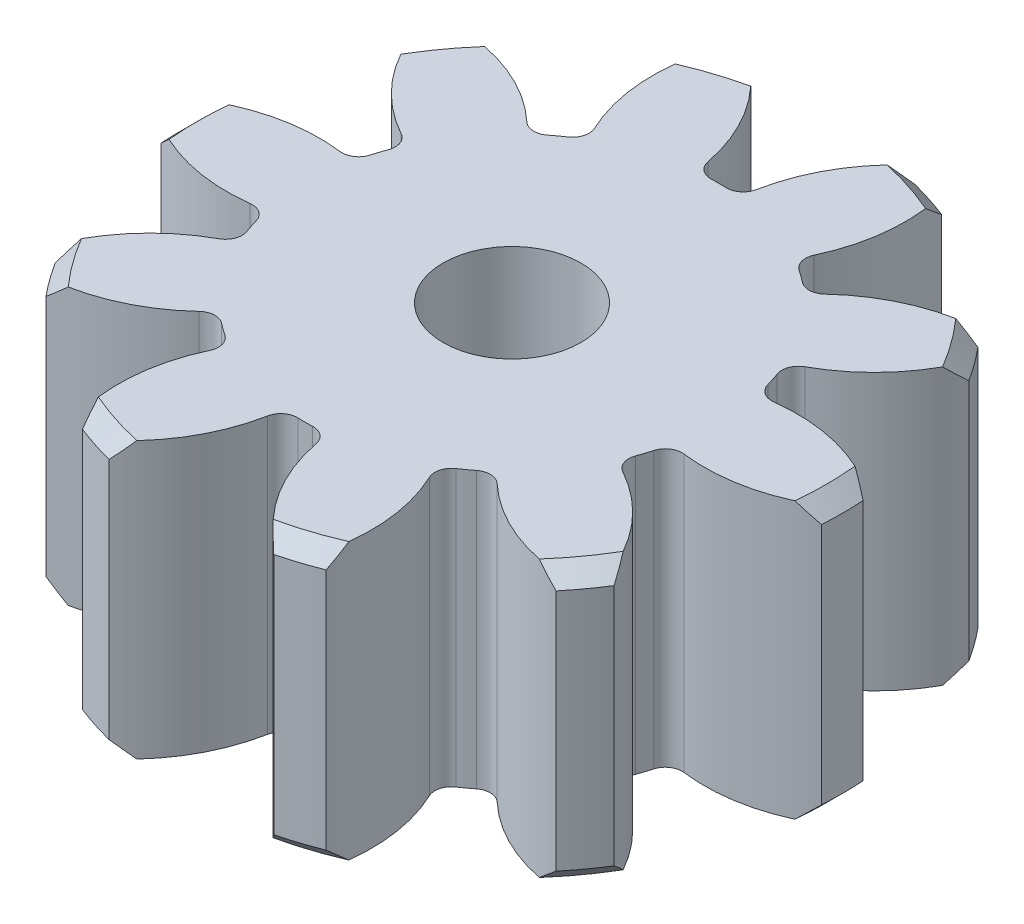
ISO-10303-21;
HEADER;
FILE_DESCRIPTION(('STEP AP214'),'2;1');
FILE_NAME('part.step','',(''),(''),'','','');
FILE_SCHEMA(('AUTOMOTIVE_DESIGN { 1 0 10303 214 1 1 1 1 }'));
ENDSEC;
DATA;
#1=APPLICATION_CONTEXT('core data for automotive mechanical design processes');
#2=APPLICATION_PROTOCOL_DEFINITION('international standard','automotive_design',2000,#1);
#3=PRODUCT_CONTEXT('',#1,'mechanical');
#4=PRODUCT('Part','Part','',(#3));
#5=PRODUCT_RELATED_PRODUCT_CATEGORY('part','',(#4));
#6=PRODUCT_DEFINITION_FORMATION('','',#4);
#7=PRODUCT_DEFINITION_CONTEXT('part definition',#1,'design');
#8=PRODUCT_DEFINITION('design','',#6,#7);
#9=PRODUCT_DEFINITION_SHAPE('','',#8);
#10=(LENGTH_UNIT() NAMED_UNIT(*) SI_UNIT(.MILLI.,.METRE.));
#11=(NAMED_UNIT(*) PLANE_ANGLE_UNIT() SI_UNIT($,.RADIAN.));
#12=(NAMED_UNIT(*) SI_UNIT($,.STERADIAN.) SOLID_ANGLE_UNIT());
#13=UNCERTAINTY_MEASURE_WITH_UNIT(LENGTH_MEASURE(1.E-05),#10,'distance_accuracy_value','');
#14=(GEOMETRIC_REPRESENTATION_CONTEXT(3) GLOBAL_UNCERTAINTY_ASSIGNED_CONTEXT((#13)) GLOBAL_UNIT_ASSIGNED_CONTEXT((#10,
#11,#12)) REPRESENTATION_CONTEXT('',''));
#15=CARTESIAN_POINT('',(0.,0.,0.));
#16=DIRECTION('',(0.,0.,1.));
#17=DIRECTION('',(1.,0.,0.));
#18=AXIS2_PLACEMENT_3D('',#15,#16,#17);
#19=CARTESIAN_POINT('',(0.,10.,0.));
#20=DIRECTION('',(0.,-1.,0.));
#21=DIRECTION('',(0.,0.,-1.));
#22=AXIS2_PLACEMENT_3D('',#19,#20,#21);
#23=CYLINDRICAL_SURFACE('',#22,12.);
#24=CARTESIAN_POINT('',(0.,0.600000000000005,0.));
#25=DIRECTION('',(0.,1.,0.));
#26=DIRECTION('',(0.,0.,1.));
#27=AXIS2_PLACEMENT_3D('',#24,#25,#26);
#28=CIRCLE('',#27,12.);
#29=CARTESIAN_POINT('',(-11.9763668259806,0.600000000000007,-0.752753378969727));
#30=VERTEX_POINT('',#29);
#31=CARTESIAN_POINT('',(-11.9763668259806,0.600000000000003,0.752753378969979));
#32=VERTEX_POINT('',#31);
#33=EDGE_CURVE('E1017',#30,#32,#28,.T.);
#34=ORIENTED_EDGE('',*,*,#33,.T.);
#35=DIRECTION('',(0.,-1.,0.));
#36=VECTOR('',#35,1.);
#37=CARTESIAN_POINT('',(-11.9763668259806,17.652649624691,0.752753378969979));
#38=LINE('',#37,#36);
#39=CARTESIAN_POINT('',(-11.9763668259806,9.4,0.752753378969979));
#40=VERTEX_POINT('',#39);
#41=EDGE_CURVE('E1012',#40,#32,#38,.T.);
#42=ORIENTED_EDGE('',*,*,#41,.F.);
#43=CARTESIAN_POINT('',(0.,9.4,0.));
#44=DIRECTION('',(0.,1.,0.));
#45=DIRECTION('',(0.,0.,1.));
#46=AXIS2_PLACEMENT_3D('',#43,#44,#45);
#47=CIRCLE('',#46,12.);
#48=CARTESIAN_POINT('',(-11.9763668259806,9.4,-0.752753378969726));
#49=VERTEX_POINT('',#48);
#50=EDGE_CURVE('E1009',#40,#49,#47,.F.);
#51=ORIENTED_EDGE('',*,*,#50,.T.);
#52=DIRECTION('',(0.,-1.,0.));
#53=VECTOR('',#52,1.);
#54=CARTESIAN_POINT('',(-11.9763668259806,17.652649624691,-0.752753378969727));
#55=LINE('',#54,#53);
#56=EDGE_CURVE('E1565',#49,#30,#55,.T.);
#57=ORIENTED_EDGE('',*,*,#56,.T.);
#58=EDGE_LOOP('',(#34,#42,#51,#57));
#59=FACE_BOUND('',#58,.T.);
#60=ADVANCED_FACE('F45',(#59),#23,.T.);
#61=CARTESIAN_POINT('',(-9.24662695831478,9.4,7.64852207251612));
#62=VERTEX_POINT('',#61);
#63=CARTESIAN_POINT('',(-10.1315416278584,9.4,6.43054152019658));
#64=VERTEX_POINT('',#63);
#65=EDGE_CURVE('E1262',#62,#64,#47,.F.);
#66=ORIENTED_EDGE('',*,*,#65,.T.);
#67=DIRECTION('',(0.,-1.,0.));
#68=VECTOR('',#67,1.);
#69=CARTESIAN_POINT('',(-10.1315416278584,17.652649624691,6.43054152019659));
#70=LINE('',#69,#68);
#71=CARTESIAN_POINT('',(-10.1315416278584,0.600000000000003,6.43054152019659));
#72=VERTEX_POINT('',#71);
#73=EDGE_CURVE('E1019',#64,#72,#70,.T.);
#74=ORIENTED_EDGE('',*,*,#73,.T.);
#75=CARTESIAN_POINT('',(-9.24662695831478,0.600000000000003,7.64852207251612));
#76=VERTEX_POINT('',#75);
#77=EDGE_CURVE('E1255',#72,#76,#28,.T.);
#78=ORIENTED_EDGE('',*,*,#77,.T.);
#79=DIRECTION('',(0.,-1.,0.));
#80=VECTOR('',#79,1.);
#81=CARTESIAN_POINT('',(-9.24662695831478,17.8516406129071,7.64852207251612));
#82=LINE('',#81,#80);
#83=EDGE_CURVE('E1226',#62,#76,#82,.T.);
#84=ORIENTED_EDGE('',*,*,#83,.F.);
#85=EDGE_LOOP('',(#66,#74,#78,#84));
#86=FACE_BOUND('',#85,.T.);
#87=ADVANCED_FACE('F1259',(#86),#23,.T.);
#88=CARTESIAN_POINT('',(-2.9849898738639,0.600000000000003,-11.6228152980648));
#89=VERTEX_POINT('',#88);
#90=CARTESIAN_POINT('',(-4.41681188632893,0.600000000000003,-11.1575881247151));
#91=VERTEX_POINT('',#90);
#92=EDGE_CURVE('E1355',#89,#91,#28,.T.);
#93=ORIENTED_EDGE('',*,*,#92,.T.);
#94=DIRECTION('',(0.,-1.,0.));
#95=VECTOR('',#94,1.);
#96=CARTESIAN_POINT('',(-4.41681188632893,17.8516406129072,-11.1575881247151));
#97=LINE('',#96,#95);
#98=CARTESIAN_POINT('',(-4.41681188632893,9.4,-11.1575881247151));
#99=VERTEX_POINT('',#98);
#100=EDGE_CURVE('E1356',#99,#91,#97,.T.);
#101=ORIENTED_EDGE('',*,*,#100,.F.);
#102=CARTESIAN_POINT('',(-2.9849898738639,9.4,-11.6228152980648));
#103=VERTEX_POINT('',#102);
#104=EDGE_CURVE('E1269',#99,#103,#47,.F.);
#105=ORIENTED_EDGE('',*,*,#104,.T.);
#106=DIRECTION('',(0.,-1.,0.));
#107=VECTOR('',#106,1.);
#108=CARTESIAN_POINT('',(-2.9849898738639,17.501762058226,-11.6228152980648));
#109=LINE('',#108,#107);
#110=EDGE_CURVE('E1357',#103,#89,#109,.T.);
#111=ORIENTED_EDGE('',*,*,#110,.T.);
#112=EDGE_LOOP('',(#93,#101,#105,#111));
#113=FACE_BOUND('',#112,.T.);
#114=ADVANCED_FACE('F1345',(#113),#23,.T.);
#115=CARTESIAN_POINT('',(-10.1315416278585,9.4,-6.43054152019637));
#116=VERTEX_POINT('',#115);
#117=CARTESIAN_POINT('',(-9.24662695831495,9.4,-7.64852207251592));
#118=VERTEX_POINT('',#117);
#119=EDGE_CURVE('E1267',#116,#118,#47,.F.);
#120=ORIENTED_EDGE('',*,*,#119,.T.);
#121=DIRECTION('',(0.,-1.,0.));
#122=VECTOR('',#121,1.);
#123=CARTESIAN_POINT('',(-9.24662695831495,17.8516406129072,-7.64852207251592));
#124=LINE('',#123,#122);
#125=CARTESIAN_POINT('',(-9.24662695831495,0.600000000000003,-7.64852207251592));
#126=VERTEX_POINT('',#125);
#127=EDGE_CURVE('E1583',#118,#126,#124,.T.);
#128=ORIENTED_EDGE('',*,*,#127,.T.);
#129=CARTESIAN_POINT('',(-10.1315416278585,0.600000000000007,-6.43054152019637));
#130=VERTEX_POINT('',#129);
#131=EDGE_CURVE('E1360',#126,#130,#28,.T.);
#132=ORIENTED_EDGE('',*,*,#131,.T.);
#133=DIRECTION('',(0.,-1.,0.));
#134=VECTOR('',#133,1.);
#135=CARTESIAN_POINT('',(-10.1315416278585,17.652649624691,-6.43054152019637));
#136=LINE('',#135,#134);
#137=EDGE_CURVE('E1569',#116,#130,#136,.T.);
#138=ORIENTED_EDGE('',*,*,#137,.F.);
#139=EDGE_LOOP('',(#120,#128,#132,#138));
#140=FACE_BOUND('',#139,.T.);
#141=ADVANCED_FACE('F1349',(#140),#23,.T.);
#142=CARTESIAN_POINT('',(9.2466269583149,0.600000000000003,7.64852207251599));
#143=VERTEX_POINT('',#142);
#144=CARTESIAN_POINT('',(10.1315416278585,0.600000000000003,6.43054152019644));
#145=VERTEX_POINT('',#144);
#146=EDGE_CURVE('E562',#143,#145,#28,.T.);
#147=ORIENTED_EDGE('',*,*,#146,.T.);
#148=DIRECTION('',(0.,-1.,0.));
#149=VECTOR('',#148,1.);
#150=CARTESIAN_POINT('',(10.1315416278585,17.652649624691,6.43054152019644));
#151=LINE('',#150,#149);
#152=CARTESIAN_POINT('',(10.1315416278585,9.4,6.43054152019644));
#153=VERTEX_POINT('',#152);
#154=EDGE_CURVE('E954',#153,#145,#151,.T.);
#155=ORIENTED_EDGE('',*,*,#154,.F.);
#156=CARTESIAN_POINT('',(9.2466269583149,9.4,7.64852207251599));
#157=VERTEX_POINT('',#156);
#158=EDGE_CURVE('E564',#153,#157,#47,.F.);
#159=ORIENTED_EDGE('',*,*,#158,.T.);
#160=DIRECTION('',(0.,-1.,0.));
#161=VECTOR('',#160,1.);
#162=CARTESIAN_POINT('',(9.2466269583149,17.8516406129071,7.64852207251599));
#163=LINE('',#162,#161);
#164=EDGE_CURVE('E545',#157,#143,#163,.T.);
#165=ORIENTED_EDGE('',*,*,#164,.T.);
#166=EDGE_LOOP('',(#147,#155,#159,#165));
#167=FACE_BOUND('',#166,.T.);
#168=ADVANCED_FACE('F560',(#167),#23,.T.);
#169=CARTESIAN_POINT('',(11.9763668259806,9.4,-0.752753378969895));
#170=VERTEX_POINT('',#169);
#171=CARTESIAN_POINT('',(11.9763668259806,9.4,0.752753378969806));
#172=VERTEX_POINT('',#171);
#173=EDGE_CURVE('E1284',#170,#172,#47,.F.);
#174=ORIENTED_EDGE('',*,*,#173,.T.);
#175=DIRECTION('',(0.,-1.,0.));
#176=VECTOR('',#175,1.);
#177=CARTESIAN_POINT('',(11.9763668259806,17.652649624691,0.752753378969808));
#178=LINE('',#177,#176);
#179=CARTESIAN_POINT('',(11.9763668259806,0.600000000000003,0.752753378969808));
#180=VERTEX_POINT('',#179);
#181=EDGE_CURVE('E1535',#172,#180,#178,.T.);
#182=ORIENTED_EDGE('',*,*,#181,.T.);
#183=CARTESIAN_POINT('',(11.9763668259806,0.600000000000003,-0.752753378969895));
#184=VERTEX_POINT('',#183);
#185=EDGE_CURVE('E571',#180,#184,#28,.T.);
#186=ORIENTED_EDGE('',*,*,#185,.T.);
#187=DIRECTION('',(0.,-1.,0.));
#188=VECTOR('',#187,1.);
#189=CARTESIAN_POINT('',(11.9763668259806,17.652649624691,-0.752753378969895));
#190=LINE('',#189,#188);
#191=EDGE_CURVE('E1523',#170,#184,#190,.T.);
#192=ORIENTED_EDGE('',*,*,#191,.F.);
#193=EDGE_LOOP('',(#174,#182,#186,#192));
#194=FACE_BOUND('',#193,.T.);
#195=ADVANCED_FACE('F1526',(#194),#23,.T.);
#196=CARTESIAN_POINT('',(9.24662695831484,9.4,-7.64852207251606));
#197=VERTEX_POINT('',#196);
#198=CARTESIAN_POINT('',(10.1315416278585,9.4,-6.43054152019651));
#199=VERTEX_POINT('',#198);
#200=EDGE_CURVE('E1279',#197,#199,#47,.F.);
#201=ORIENTED_EDGE('',*,*,#200,.T.);
#202=DIRECTION('',(0.,-1.,0.));
#203=VECTOR('',#202,1.);
#204=CARTESIAN_POINT('',(10.1315416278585,17.652649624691,-6.43054152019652));
#205=LINE('',#204,#203);
#206=CARTESIAN_POINT('',(10.1315416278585,0.600000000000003,-6.43054152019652));
#207=VERTEX_POINT('',#206);
#208=EDGE_CURVE('E1529',#199,#207,#205,.T.);
#209=ORIENTED_EDGE('',*,*,#208,.T.);
#210=CARTESIAN_POINT('',(9.24662695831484,0.600000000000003,-7.64852207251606));
#211=VERTEX_POINT('',#210);
#212=EDGE_CURVE('E577',#207,#211,#28,.T.);
#213=ORIENTED_EDGE('',*,*,#212,.T.);
#214=DIRECTION('',(0.,-1.,0.));
#215=VECTOR('',#214,1.);
#216=CARTESIAN_POINT('',(9.24662695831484,17.8516406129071,-7.64852207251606));
#217=LINE('',#216,#215);
#218=EDGE_CURVE('E1549',#197,#211,#217,.T.);
#219=ORIENTED_EDGE('',*,*,#218,.F.);
#220=EDGE_LOOP('',(#201,#209,#213,#219));
#221=FACE_BOUND('',#220,.T.);
#222=ADVANCED_FACE('F1340',(#221),#23,.T.);
#223=CARTESIAN_POINT('',(2.9849898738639,9.4,-11.6228152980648));
#224=VERTEX_POINT('',#223);
#225=CARTESIAN_POINT('',(4.41681188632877,9.4,-11.1575881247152));
#226=VERTEX_POINT('',#225);
#227=EDGE_CURVE('E1274',#224,#226,#47,.F.);
#228=ORIENTED_EDGE('',*,*,#227,.T.);
#229=DIRECTION('',(0.,-1.,0.));
#230=VECTOR('',#229,1.);
#231=CARTESIAN_POINT('',(4.41681188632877,17.8516406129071,-11.1575881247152));
#232=LINE('',#231,#230);
#233=CARTESIAN_POINT('',(4.41681188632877,0.600000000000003,-11.1575881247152));
#234=VERTEX_POINT('',#233);
#235=EDGE_CURVE('E2250',#226,#234,#232,.T.);
#236=ORIENTED_EDGE('',*,*,#235,.T.);
#237=CARTESIAN_POINT('',(2.9849898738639,0.600000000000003,-11.6228152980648));
#238=VERTEX_POINT('',#237);
#239=EDGE_CURVE('E1359',#234,#238,#28,.T.);
#240=ORIENTED_EDGE('',*,*,#239,.T.);
#241=DIRECTION('',(0.,-1.,0.));
#242=VECTOR('',#241,1.);
#243=CARTESIAN_POINT('',(2.9849898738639,17.501762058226,-11.6228152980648));
#244=LINE('',#243,#242);
#245=EDGE_CURVE('E1603',#224,#238,#244,.T.);
#246=ORIENTED_EDGE('',*,*,#245,.F.);
#247=EDGE_LOOP('',(#228,#236,#240,#246));
#248=FACE_BOUND('',#247,.T.);
#249=ADVANCED_FACE('F1335',(#248),#23,.T.);
#250=CARTESIAN_POINT('',(2.9849898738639,0.600000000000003,11.6228152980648));
#251=VERTEX_POINT('',#250);
#252=CARTESIAN_POINT('',(4.41681188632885,0.600000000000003,11.1575881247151));
#253=VERTEX_POINT('',#252);
#254=EDGE_CURVE('E570',#251,#253,#28,.T.);
#255=ORIENTED_EDGE('',*,*,#254,.T.);
#256=DIRECTION('',(0.,-1.,0.));
#257=VECTOR('',#256,1.);
#258=CARTESIAN_POINT('',(4.41681188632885,17.8516406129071,11.1575881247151));
#259=LINE('',#258,#257);
#260=CARTESIAN_POINT('',(4.41681188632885,9.4,11.1575881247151));
#261=VERTEX_POINT('',#260);
#262=EDGE_CURVE('E555',#261,#253,#259,.T.);
#263=ORIENTED_EDGE('',*,*,#262,.F.);
#264=CARTESIAN_POINT('',(2.9849898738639,9.4,11.6228152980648));
#265=VERTEX_POINT('',#264);
#266=EDGE_CURVE('E1266',#261,#265,#47,.F.);
#267=ORIENTED_EDGE('',*,*,#266,.T.);
#268=DIRECTION('',(0.,-1.,0.));
#269=VECTOR('',#268,1.);
#270=CARTESIAN_POINT('',(2.9849898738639,17.501762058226,11.6228152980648));
#271=LINE('',#270,#269);
#272=EDGE_CURVE('E1315',#265,#251,#271,.T.);
#273=ORIENTED_EDGE('',*,*,#272,.T.);
#274=EDGE_LOOP('',(#255,#263,#267,#273));
#275=FACE_BOUND('',#274,.T.);
#276=ADVANCED_FACE('F614',(#275),#23,.T.);
#277=CARTESIAN_POINT('',(0.,10.,0.));
#278=DIRECTION('',(0.,1.,0.));
#279=DIRECTION('',(0.,0.,1.));
#280=AXIS2_PLACEMENT_3D('',#277,#278,#279);
#281=PLANE('',#280);
#282=CARTESIAN_POINT('',(0.,10.,0.));
#283=DIRECTION('',(0.,1.,0.));
#284=DIRECTION('',(0.,0.,1.));
#285=AXIS2_PLACEMENT_3D('',#282,#283,#284);
#286=CIRCLE('',#285,2.5);
#287=CARTESIAN_POINT('',(0.,10.,2.5));
#288=VERTEX_POINT('',#287);
#289=EDGE_CURVE('E1219',#288,#288,#286,.F.);
#290=ORIENTED_EDGE('',*,*,#289,.T.);
#291=EDGE_LOOP('',(#290));
#292=FACE_BOUND('',#291,.T.);
#293=CARTESIAN_POINT('',(-8.65650301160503,10.,-4.71396820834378));
#294=DIRECTION('',(0.,1.,0.));
#295=DIRECTION('',(0.,0.,1.));
#296=AXIS2_PLACEMENT_3D('',#293,#294,#295);
#297=CIRCLE('',#296,6.39582212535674);
#298=CARTESIAN_POINT('',(-11.3479647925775,10.,1.08797751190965));
#299=VERTEX_POINT('',#298);
#300=CARTESIAN_POINT('',(-7.8621621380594,10.,1.63233490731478));
#301=VERTEX_POINT('',#300);
#302=EDGE_CURVE('E997',#299,#301,#297,.T.);
#303=ORIENTED_EDGE('',*,*,#302,.T.);
#304=CARTESIAN_POINT('',(-7.78764403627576,10.,2.22768946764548));
#305=DIRECTION('',(0.,1.,0.));
#306=DIRECTION('',(0.,0.,1.));
#307=AXIS2_PLACEMENT_3D('',#304,#305,#306);
#308=CIRCLE('',#307,0.6);
#309=CARTESIAN_POINT('',(-7.21078151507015,10.,2.06267543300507));
#310=VERTEX_POINT('',#309);
#311=EDGE_CURVE('E1180',#301,#310,#308,.F.);
#312=ORIENTED_EDGE('',*,*,#311,.T.);
#313=CARTESIAN_POINT('',(0.,10.,0.));
#314=DIRECTION('',(0.,1.,0.));
#315=DIRECTION('',(0.,0.,1.));
#316=AXIS2_PLACEMENT_3D('',#313,#314,#315);
#317=CIRCLE('',#316,7.5);
#318=CARTESIAN_POINT('',(-7.04605498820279,10.,2.56965155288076));
#319=VERTEX_POINT('',#318);
#320=EDGE_CURVE('E1236',#310,#319,#317,.T.);
#321=ORIENTED_EDGE('',*,*,#320,.T.);
#322=CARTESIAN_POINT('',(-7.60973938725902,10.,2.77522367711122));
#323=DIRECTION('',(0.,1.,0.));
#324=DIRECTION('',(0.,0.,1.));
#325=AXIS2_PLACEMENT_3D('',#322,#323,#324);
#326=CIRCLE('',#325,0.6);
#327=CARTESIAN_POINT('',(-7.32008516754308,10.,3.30067627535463));
#328=VERTEX_POINT('',#327);
#329=EDGE_CURVE('E1176',#319,#328,#326,.F.);
#330=ORIENTED_EDGE('',*,*,#329,.T.);
#331=CARTESIAN_POINT('',(-4.23245705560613,10.,8.90184519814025));
#332=DIRECTION('',(0.,1.,0.));
#333=DIRECTION('',(0.,0.,1.));
#334=AXIS2_PLACEMENT_3D('',#331,#332,#333);
#335=CIRCLE('',#334,6.39582212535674);
#336=CARTESIAN_POINT('',(-9.82019350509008,10.,5.78997405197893));
#337=VERTEX_POINT('',#336);
#338=EDGE_CURVE('E1024',#328,#337,#335,.T.);
#339=ORIENTED_EDGE('',*,*,#338,.T.);
#340=CARTESIAN_POINT('',(0.,10.,0.));
#341=DIRECTION('',(0.,1.,0.));
#342=DIRECTION('',(0.,0.,1.));
#343=AXIS2_PLACEMENT_3D('',#340,#341,#342);
#344=CIRCLE('',#343,11.4);
#345=CARTESIAN_POINT('',(-8.54119923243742,10.,7.55035864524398));
#346=VERTEX_POINT('',#345);
#347=EDGE_CURVE('E960',#337,#346,#344,.T.);
#348=ORIENTED_EDGE('',*,*,#347,.T.);
#349=CARTESIAN_POINT('',(-9.77405904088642,10.,1.27448441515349));
#350=DIRECTION('',(0.,1.,0.));
#351=DIRECTION('',(0.,0.,1.));
#352=AXIS2_PLACEMENT_3D('',#349,#350,#351);
#353=CIRCLE('',#352,6.39582212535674);
#354=CARTESIAN_POINT('',(-5.40116039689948,10.,5.94184963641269));
#355=VERTEX_POINT('',#354);
#356=EDGE_CURVE('E1217',#346,#355,#353,.T.);
#357=ORIENTED_EDGE('',*,*,#356,.T.);
#358=CARTESIAN_POINT('',(-4.9909333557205,10.,6.3797009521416));
#359=DIRECTION('',(0.,1.,0.));
#360=DIRECTION('',(0.,0.,1.));
#361=AXIS2_PLACEMENT_3D('',#358,#359,#360);
#362=CIRCLE('',#361,0.6);
#363=CARTESIAN_POINT('',(-4.62123458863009,10.,5.90713051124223));
#364=VERTEX_POINT('',#363);
#365=EDGE_CURVE('E11',#355,#364,#362,.F.);
#366=ORIENTED_EDGE('',*,*,#365,.T.);
#367=CARTESIAN_POINT('',(0.,10.,0.));
#368=DIRECTION('',(0.,1.,0.));
#369=DIRECTION('',(0.,0.,1.));
#370=AXIS2_PLACEMENT_3D('',#367,#368,#369);
#371=CIRCLE('',#370,7.5);
#372=CARTESIAN_POINT('',(-4.18997494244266,10.,6.22045898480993));
#373=VERTEX_POINT('',#372);
#374=EDGE_CURVE('E1200',#364,#373,#371,.T.);
#375=ORIENTED_EDGE('',*,*,#374,.T.);
#376=CARTESIAN_POINT('',(-4.52517293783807,10.,6.71809570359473));
#377=DIRECTION('',(0.,1.,0.));
#378=DIRECTION('',(0.,0.,1.));
#379=AXIS2_PLACEMENT_3D('',#376,#377,#378);
#380=CIRCLE('',#379,0.6);
#381=CARTESIAN_POINT('',(-3.98198446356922,10.,6.9729413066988));
#382=VERTEX_POINT('',#381);
#383=EDGE_CURVE('E1193',#373,#382,#380,.F.);
#384=ORIENTED_EDGE('',*,*,#383,.T.);
#385=CARTESIAN_POINT('',(1.80824363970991,10.,9.68951988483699));
#386=DIRECTION('',(0.,1.,0.));
#387=DIRECTION('',(0.,0.,1.));
#388=AXIS2_PLACEMENT_3D('',#385,#386,#387);
#389=CIRCLE('',#388,6.39582212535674);
#390=CARTESIAN_POINT('',(-4.54144207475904,10.,10.4563523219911));
#391=VERTEX_POINT('',#390);
#392=EDGE_CURVE('E1197',#382,#391,#389,.T.);
#393=ORIENTED_EDGE('',*,*,#392,.T.);
#394=CARTESIAN_POINT('',(-2.47198587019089,10.,11.1287594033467));
#395=VERTEX_POINT('',#394);
#396=EDGE_CURVE('E959',#391,#395,#344,.T.);
#397=ORIENTED_EDGE('',*,*,#396,.T.);
#398=CARTESIAN_POINT('',(-7.15825672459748,10.,6.77612731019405));
#399=DIRECTION('',(0.,1.,0.));
#400=DIRECTION('',(0.,0.,1.));
#401=AXIS2_PLACEMENT_3D('',#398,#399,#400);
#402=CIRCLE('',#401,6.39582212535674);
#403=CARTESIAN_POINT('',(-0.877098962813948,10.,7.98177976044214));
#404=VERTEX_POINT('',#403);
#405=EDGE_CURVE('E1320',#395,#404,#402,.T.);
#406=ORIENTED_EDGE('',*,*,#405,.T.);
#407=CARTESIAN_POINT('',(-0.287855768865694,10.,8.09488351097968));
#408=DIRECTION('',(0.,1.,0.));
#409=DIRECTION('',(0.,0.,1.));
#410=AXIS2_PLACEMENT_3D('',#407,#408,#409);
#411=CIRCLE('',#410,0.6);
#412=CARTESIAN_POINT('',(-0.266533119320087,10.,7.49526251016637));
#413=VERTEX_POINT('',#412);
#414=EDGE_CURVE('E1292',#404,#413,#411,.F.);
#415=ORIENTED_EDGE('',*,*,#414,.T.);
#416=CARTESIAN_POINT('',(0.,10.,0.));
#417=DIRECTION('',(0.,1.,0.));
#418=DIRECTION('',(0.,0.,1.));
#419=AXIS2_PLACEMENT_3D('',#416,#417,#418);
#420=CIRCLE('',#419,7.5);
#421=CARTESIAN_POINT('',(0.266533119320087,10.,7.49526251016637));
#422=VERTEX_POINT('',#421);
#423=EDGE_CURVE('E1318',#413,#422,#420,.T.);
#424=ORIENTED_EDGE('',*,*,#423,.T.);
#425=CARTESIAN_POINT('',(0.287855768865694,10.,8.09488351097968));
#426=DIRECTION('',(0.,1.,0.));
#427=DIRECTION('',(0.,0.,1.));
#428=AXIS2_PLACEMENT_3D('',#425,#426,#427);
#429=CIRCLE('',#428,0.6);
#430=CARTESIAN_POINT('',(0.877098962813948,10.,7.98177976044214));
#431=VERTEX_POINT('',#430);
#432=EDGE_CURVE('E1298',#422,#431,#429,.F.);
#433=ORIENTED_EDGE('',*,*,#432,.T.);
#434=CARTESIAN_POINT('',(7.15825672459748,10.,6.77612731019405));
#435=DIRECTION('',(0.,1.,0.));
#436=DIRECTION('',(0.,0.,1.));
#437=AXIS2_PLACEMENT_3D('',#434,#435,#436);
#438=CIRCLE('',#437,6.39582212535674);
#439=CARTESIAN_POINT('',(2.47198587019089,10.,11.1287594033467));
#440=VERTEX_POINT('',#439);
#441=EDGE_CURVE('E1317',#431,#440,#438,.T.);
#442=ORIENTED_EDGE('',*,*,#441,.T.);
#443=CARTESIAN_POINT('',(4.54144207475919,10.,10.456352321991));
#444=VERTEX_POINT('',#443);
#445=EDGE_CURVE('E845',#440,#444,#344,.T.);
#446=ORIENTED_EDGE('',*,*,#445,.T.);
#447=CARTESIAN_POINT('',(-1.80824363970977,10.,9.68951988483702));
#448=DIRECTION('',(0.,1.,0.));
#449=DIRECTION('',(0.,0.,1.));
#450=AXIS2_PLACEMENT_3D('',#447,#448,#449);
#451=CIRCLE('',#450,6.39582212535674);
#452=CARTESIAN_POINT('',(3.98198446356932,10.,6.97294130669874));
#453=VERTEX_POINT('',#452);
#454=EDGE_CURVE('E1029',#444,#453,#451,.T.);
#455=ORIENTED_EDGE('',*,*,#454,.T.);
#456=CARTESIAN_POINT('',(4.52517293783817,10.,6.71809570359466));
#457=DIRECTION('',(0.,1.,0.));
#458=DIRECTION('',(0.,0.,1.));
#459=AXIS2_PLACEMENT_3D('',#456,#457,#458);
#460=CIRCLE('',#459,0.6);
#461=CARTESIAN_POINT('',(4.18997494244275,10.,6.22045898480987));
#462=VERTEX_POINT('',#461);
#463=EDGE_CURVE('E1040',#453,#462,#460,.F.);
#464=ORIENTED_EDGE('',*,*,#463,.T.);
#465=CARTESIAN_POINT('',(0.,10.,0.));
#466=DIRECTION('',(0.,1.,0.));
#467=DIRECTION('',(0.,0.,1.));
#468=AXIS2_PLACEMENT_3D('',#465,#466,#467);
#469=CIRCLE('',#468,7.5);
#470=CARTESIAN_POINT('',(4.62123458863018,10.,5.90713051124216));
#471=VERTEX_POINT('',#470);
#472=EDGE_CURVE('E1033',#462,#471,#469,.T.);
#473=ORIENTED_EDGE('',*,*,#472,.T.);
#474=CARTESIAN_POINT('',(4.99093335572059,10.,6.37970095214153));
#475=DIRECTION('',(0.,1.,0.));
#476=DIRECTION('',(0.,0.,1.));
#477=AXIS2_PLACEMENT_3D('',#474,#475,#476);
#478=CIRCLE('',#477,0.6);
#479=CARTESIAN_POINT('',(5.40116039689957,10.,5.94184963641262));
#480=VERTEX_POINT('',#479);
#481=EDGE_CURVE('E1038',#471,#480,#478,.F.);
#482=ORIENTED_EDGE('',*,*,#481,.T.);
#483=CARTESIAN_POINT('',(9.77405904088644,10.,1.27448441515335));
#484=DIRECTION('',(0.,1.,0.));
#485=DIRECTION('',(0.,0.,1.));
#486=AXIS2_PLACEMENT_3D('',#483,#484,#485);
#487=CIRCLE('',#486,6.39582212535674);
#488=CARTESIAN_POINT('',(8.54119923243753,10.,7.55035864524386));
#489=VERTEX_POINT('',#488);
#490=EDGE_CURVE('E565',#480,#489,#487,.T.);
#491=ORIENTED_EDGE('',*,*,#490,.T.);
#492=CARTESIAN_POINT('',(9.8201935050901,10.,5.78997405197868));
#493=VERTEX_POINT('',#492);
#494=EDGE_CURVE('E967',#489,#493,#344,.T.);
#495=ORIENTED_EDGE('',*,*,#494,.T.);
#496=CARTESIAN_POINT('',(4.23245705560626,10.,8.90184519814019));
#497=DIRECTION('',(0.,1.,0.));
#498=DIRECTION('',(0.,0.,1.));
#499=AXIS2_PLACEMENT_3D('',#496,#497,#498);
#500=CIRCLE('',#499,6.39582212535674);
#501=CARTESIAN_POINT('',(7.32008516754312,10.,3.30067627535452));
#502=VERTEX_POINT('',#501);
#503=EDGE_CURVE('E1608',#493,#502,#500,.T.);
#504=ORIENTED_EDGE('',*,*,#503,.T.);
#505=CARTESIAN_POINT('',(7.60973938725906,10.,2.77522367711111));
#506=DIRECTION('',(0.,1.,0.));
#507=DIRECTION('',(0.,0.,1.));
#508=AXIS2_PLACEMENT_3D('',#505,#506,#507);
#509=CIRCLE('',#508,0.6);
#510=CARTESIAN_POINT('',(7.04605498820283,10.,2.56965155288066));
#511=VERTEX_POINT('',#510);
#512=EDGE_CURVE('E1072',#502,#511,#509,.F.);
#513=ORIENTED_EDGE('',*,*,#512,.T.);
#514=CARTESIAN_POINT('',(0.,10.,0.));
#515=DIRECTION('',(0.,1.,0.));
#516=DIRECTION('',(0.,0.,1.));
#517=AXIS2_PLACEMENT_3D('',#514,#515,#516);
#518=CIRCLE('',#517,7.5);
#519=CARTESIAN_POINT('',(7.21078151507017,10.,2.06267543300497));
#520=VERTEX_POINT('',#519);
#521=EDGE_CURVE('E1538',#511,#520,#518,.T.);
#522=ORIENTED_EDGE('',*,*,#521,.T.);
#523=CARTESIAN_POINT('',(7.78764403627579,10.,2.22768946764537));
#524=DIRECTION('',(0.,1.,0.));
#525=DIRECTION('',(0.,0.,1.));
#526=AXIS2_PLACEMENT_3D('',#523,#524,#525);
#527=CIRCLE('',#526,0.6);
#528=CARTESIAN_POINT('',(7.86216213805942,10.,1.63233490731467));
#529=VERTEX_POINT('',#528);
#530=EDGE_CURVE('E1068',#520,#529,#527,.F.);
#531=ORIENTED_EDGE('',*,*,#530,.T.);
#532=CARTESIAN_POINT('',(8.65650301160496,10.,-4.7139682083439));
#533=DIRECTION('',(0.,1.,0.));
#534=DIRECTION('',(0.,0.,1.));
#535=AXIS2_PLACEMENT_3D('',#532,#533,#534);
#536=CIRCLE('',#535,6.39582212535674);
#537=CARTESIAN_POINT('',(11.3479647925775,10.,1.08797751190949));
#538=VERTEX_POINT('',#537);
#539=EDGE_CURVE('E1533',#529,#538,#536,.T.);
#540=ORIENTED_EDGE('',*,*,#539,.T.);
#541=CARTESIAN_POINT('',(11.3479647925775,10.,-1.08797751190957));
#542=VERTEX_POINT('',#541);
#543=EDGE_CURVE('E972',#538,#542,#344,.T.);
#544=ORIENTED_EDGE('',*,*,#543,.T.);
#545=CARTESIAN_POINT('',(8.656503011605,10.,4.71396820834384));
#546=DIRECTION('',(0.,1.,0.));
#547=DIRECTION('',(0.,0.,1.));
#548=AXIS2_PLACEMENT_3D('',#545,#546,#547);
#549=CIRCLE('',#548,6.39582212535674);
#550=CARTESIAN_POINT('',(7.86216213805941,10.,-1.63233490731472));
#551=VERTEX_POINT('',#550);
#552=EDGE_CURVE('E1524',#542,#551,#549,.T.);
#553=ORIENTED_EDGE('',*,*,#552,.T.);
#554=CARTESIAN_POINT('',(7.78764403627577,10.,-2.22768946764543));
#555=DIRECTION('',(0.,1.,0.));
#556=DIRECTION('',(0.,0.,1.));
#557=AXIS2_PLACEMENT_3D('',#554,#555,#556);
#558=CIRCLE('',#557,0.6);
#559=CARTESIAN_POINT('',(7.21078151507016,10.,-2.06267543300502));
#560=VERTEX_POINT('',#559);
#561=EDGE_CURVE('E1090',#551,#560,#558,.F.);
#562=ORIENTED_EDGE('',*,*,#561,.T.);
#563=CARTESIAN_POINT('',(0.,10.,0.));
#564=DIRECTION('',(0.,1.,0.));
#565=DIRECTION('',(0.,0.,1.));
#566=AXIS2_PLACEMENT_3D('',#563,#564,#565);
#567=CIRCLE('',#566,7.5);
#568=CARTESIAN_POINT('',(7.04605498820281,10.,-2.56965155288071));
#569=VERTEX_POINT('',#568);
#570=EDGE_CURVE('E1551',#560,#569,#567,.T.);
#571=ORIENTED_EDGE('',*,*,#570,.T.);
#572=CARTESIAN_POINT('',(7.60973938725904,10.,-2.77522367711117));
#573=DIRECTION('',(0.,1.,0.));
#574=DIRECTION('',(0.,0.,1.));
#575=AXIS2_PLACEMENT_3D('',#572,#573,#574);
#576=CIRCLE('',#575,0.6);
#577=CARTESIAN_POINT('',(7.3200851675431,10.,-3.30067627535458));
#578=VERTEX_POINT('',#577);
#579=EDGE_CURVE('E1086',#569,#578,#576,.F.);
#580=ORIENTED_EDGE('',*,*,#579,.T.);
#581=CARTESIAN_POINT('',(4.2324570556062,10.,-8.90184519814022));
#582=DIRECTION('',(0.,1.,0.));
#583=DIRECTION('',(0.,0.,1.));
#584=AXIS2_PLACEMENT_3D('',#581,#582,#583);
#585=CIRCLE('',#584,6.39582212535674);
#586=CARTESIAN_POINT('',(9.82019350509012,10.,-5.78997405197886));
#587=VERTEX_POINT('',#586);
#588=EDGE_CURVE('E1552',#578,#587,#585,.T.);
#589=ORIENTED_EDGE('',*,*,#588,.T.);
#590=CARTESIAN_POINT('',(8.54119923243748,10.,-7.55035864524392));
#591=VERTEX_POINT('',#590);
#592=EDGE_CURVE('E976',#587,#591,#344,.T.);
#593=ORIENTED_EDGE('',*,*,#592,.T.);
#594=CARTESIAN_POINT('',(9.77405904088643,10.,-1.27448441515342));
#595=DIRECTION('',(0.,1.,0.));
#596=DIRECTION('',(0.,0.,1.));
#597=AXIS2_PLACEMENT_3D('',#594,#595,#596);
#598=CIRCLE('',#597,6.39582212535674);
#599=CARTESIAN_POINT('',(5.40116039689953,10.,-5.94184963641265));
#600=VERTEX_POINT('',#599);
#601=EDGE_CURVE('E2258',#591,#600,#598,.T.);
#602=ORIENTED_EDGE('',*,*,#601,.T.);
#603=CARTESIAN_POINT('',(4.99093335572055,10.,-6.37970095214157));
#604=DIRECTION('',(0.,1.,0.));
#605=DIRECTION('',(0.,0.,1.));
#606=AXIS2_PLACEMENT_3D('',#603,#604,#605);
#607=CIRCLE('',#606,0.6);
#608=CARTESIAN_POINT('',(4.62123458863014,10.,-5.90713051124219));
#609=VERTEX_POINT('',#608);
#610=EDGE_CURVE('E1108',#600,#609,#607,.F.);
#611=ORIENTED_EDGE('',*,*,#610,.T.);
#612=CARTESIAN_POINT('',(0.,10.,0.));
#613=DIRECTION('',(0.,1.,0.));
#614=DIRECTION('',(0.,0.,1.));
#615=AXIS2_PLACEMENT_3D('',#612,#613,#614);
#616=CIRCLE('',#615,7.5);
#617=CARTESIAN_POINT('',(4.1899749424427,10.,-6.2204589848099));
#618=VERTEX_POINT('',#617);
#619=EDGE_CURVE('E2254',#609,#618,#616,.T.);
#620=ORIENTED_EDGE('',*,*,#619,.T.);
#621=CARTESIAN_POINT('',(4.52517293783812,10.,-6.7180957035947));
#622=DIRECTION('',(0.,1.,0.));
#623=DIRECTION('',(0.,0.,1.));
#624=AXIS2_PLACEMENT_3D('',#621,#622,#623);
#625=CIRCLE('',#624,0.6);
#626=CARTESIAN_POINT('',(3.98198446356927,10.,-6.97294130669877));
#627=VERTEX_POINT('',#626);
#628=EDGE_CURVE('E1104',#618,#627,#625,.F.);
#629=ORIENTED_EDGE('',*,*,#628,.T.);
#630=CARTESIAN_POINT('',(-1.80824363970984,10.,-9.689519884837));
#631=DIRECTION('',(0.,1.,0.));
#632=DIRECTION('',(0.,0.,1.));
#633=AXIS2_PLACEMENT_3D('',#630,#631,#632);
#634=CIRCLE('',#633,6.39582212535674);
#635=CARTESIAN_POINT('',(4.54144207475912,10.,-10.4563523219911));
#636=VERTEX_POINT('',#635);
#637=EDGE_CURVE('E2251',#627,#636,#634,.T.);
#638=ORIENTED_EDGE('',*,*,#637,.T.);
#639=CARTESIAN_POINT('',(2.47198587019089,10.,-11.1287594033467));
#640=VERTEX_POINT('',#639);
#641=EDGE_CURVE('E980',#636,#640,#344,.T.);
#642=ORIENTED_EDGE('',*,*,#641,.T.);
#643=CARTESIAN_POINT('',(7.15825672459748,10.,-6.77612731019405));
#644=DIRECTION('',(0.,1.,0.));
#645=DIRECTION('',(0.,0.,1.));
#646=AXIS2_PLACEMENT_3D('',#643,#644,#645);
#647=CIRCLE('',#646,6.39582212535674);
#648=CARTESIAN_POINT('',(0.877098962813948,10.,-7.98177976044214));
#649=VERTEX_POINT('',#648);
#650=EDGE_CURVE('E1595',#640,#649,#647,.T.);
#651=ORIENTED_EDGE('',*,*,#650,.T.);
#652=CARTESIAN_POINT('',(0.287855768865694,10.,-8.09488351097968));
#653=DIRECTION('',(0.,1.,0.));
#654=DIRECTION('',(0.,0.,1.));
#655=AXIS2_PLACEMENT_3D('',#652,#653,#654);
#656=CIRCLE('',#655,0.6);
#657=CARTESIAN_POINT('',(0.266533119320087,10.,-7.49526251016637));
#658=VERTEX_POINT('',#657);
#659=EDGE_CURVE('E1126',#649,#658,#656,.F.);
#660=ORIENTED_EDGE('',*,*,#659,.T.);
#661=CARTESIAN_POINT('',(0.,10.,0.));
#662=DIRECTION('',(0.,1.,0.));
#663=DIRECTION('',(0.,0.,1.));
#664=AXIS2_PLACEMENT_3D('',#661,#662,#663);
#665=CIRCLE('',#664,7.5);
#666=CARTESIAN_POINT('',(-0.266533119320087,10.,-7.49526251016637));
#667=VERTEX_POINT('',#666);
#668=EDGE_CURVE('E1597',#658,#667,#665,.T.);
#669=ORIENTED_EDGE('',*,*,#668,.T.);
#670=CARTESIAN_POINT('',(-0.287855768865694,10.,-8.09488351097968));
#671=DIRECTION('',(0.,1.,0.));
#672=DIRECTION('',(0.,0.,1.));
#673=AXIS2_PLACEMENT_3D('',#670,#671,#672);
#674=CIRCLE('',#673,0.6);
#675=CARTESIAN_POINT('',(-0.877098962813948,10.,-7.98177976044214));
#676=VERTEX_POINT('',#675);
#677=EDGE_CURVE('E1122',#667,#676,#674,.F.);
#678=ORIENTED_EDGE('',*,*,#677,.T.);
#679=CARTESIAN_POINT('',(-7.15825672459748,10.,-6.77612731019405));
#680=DIRECTION('',(0.,1.,0.));
#681=DIRECTION('',(0.,0.,1.));
#682=AXIS2_PLACEMENT_3D('',#679,#680,#681);
#683=CIRCLE('',#682,6.39582212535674);
#684=CARTESIAN_POINT('',(-2.47198587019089,10.,-11.1287594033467));
#685=VERTEX_POINT('',#684);
#686=EDGE_CURVE('E1598',#676,#685,#683,.T.);
#687=ORIENTED_EDGE('',*,*,#686,.T.);
#688=CARTESIAN_POINT('',(-4.54144207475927,10.,-10.456352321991));
#689=VERTEX_POINT('',#688);
#690=EDGE_CURVE('E984',#685,#689,#344,.T.);
#691=ORIENTED_EDGE('',*,*,#690,.T.);
#692=CARTESIAN_POINT('',(1.8082436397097,10.,-9.68951988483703));
#693=DIRECTION('',(0.,1.,0.));
#694=DIRECTION('',(0.,0.,1.));
#695=AXIS2_PLACEMENT_3D('',#692,#693,#694);
#696=CIRCLE('',#695,6.39582212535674);
#697=CARTESIAN_POINT('',(-3.98198446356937,10.,-6.97294130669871));
#698=VERTEX_POINT('',#697);
#699=EDGE_CURVE('E1574',#689,#698,#696,.T.);
#700=ORIENTED_EDGE('',*,*,#699,.T.);
#701=CARTESIAN_POINT('',(-4.52517293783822,10.,-6.71809570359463));
#702=DIRECTION('',(0.,1.,0.));
#703=DIRECTION('',(0.,0.,1.));
#704=AXIS2_PLACEMENT_3D('',#701,#702,#703);
#705=CIRCLE('',#704,0.6);
#706=CARTESIAN_POINT('',(-4.1899749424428,10.,-6.22045898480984));
#707=VERTEX_POINT('',#706);
#708=EDGE_CURVE('E1144',#698,#707,#705,.F.);
#709=ORIENTED_EDGE('',*,*,#708,.T.);
#710=CARTESIAN_POINT('',(0.,10.,0.));
#711=DIRECTION('',(0.,1.,0.));
#712=DIRECTION('',(0.,0.,1.));
#713=AXIS2_PLACEMENT_3D('',#710,#711,#712);
#714=CIRCLE('',#713,7.5);
#715=CARTESIAN_POINT('',(-4.62123458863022,10.,-5.90713051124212));
#716=VERTEX_POINT('',#715);
#717=EDGE_CURVE('E1580',#707,#716,#714,.T.);
#718=ORIENTED_EDGE('',*,*,#717,.T.);
#719=CARTESIAN_POINT('',(-4.99093335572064,10.,-6.3797009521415));
#720=DIRECTION('',(0.,1.,0.));
#721=DIRECTION('',(0.,0.,1.));
#722=AXIS2_PLACEMENT_3D('',#719,#720,#721);
#723=CIRCLE('',#722,0.6);
#724=CARTESIAN_POINT('',(-5.40116039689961,10.,-5.94184963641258));
#725=VERTEX_POINT('',#724);
#726=EDGE_CURVE('E1140',#716,#725,#723,.F.);
#727=ORIENTED_EDGE('',*,*,#726,.T.);
#728=CARTESIAN_POINT('',(-9.77405904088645,10.,-1.27448441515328));
#729=DIRECTION('',(0.,1.,0.));
#730=DIRECTION('',(0.,0.,1.));
#731=AXIS2_PLACEMENT_3D('',#728,#729,#730);
#732=CIRCLE('',#731,6.39582212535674);
#733=CARTESIAN_POINT('',(-8.54119923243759,10.,-7.55035864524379));
#734=VERTEX_POINT('',#733);
#735=EDGE_CURVE('E1581',#725,#734,#732,.T.);
#736=ORIENTED_EDGE('',*,*,#735,.T.);
#737=CARTESIAN_POINT('',(-9.82019350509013,10.,-5.78997405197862));
#738=VERTEX_POINT('',#737);
#739=EDGE_CURVE('E988',#734,#738,#344,.T.);
#740=ORIENTED_EDGE('',*,*,#739,.T.);
#741=CARTESIAN_POINT('',(-4.23245705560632,10.,-8.90184519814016));
#742=DIRECTION('',(0.,1.,0.));
#743=DIRECTION('',(0.,0.,1.));
#744=AXIS2_PLACEMENT_3D('',#741,#742,#743);
#745=CIRCLE('',#744,6.39582212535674);
#746=CARTESIAN_POINT('',(-7.32008516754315,10.,-3.30067627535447));
#747=VERTEX_POINT('',#746);
#748=EDGE_CURVE('E1559',#738,#747,#745,.T.);
#749=ORIENTED_EDGE('',*,*,#748,.T.);
#750=CARTESIAN_POINT('',(-7.60973938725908,10.,-2.77522367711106));
#751=DIRECTION('',(0.,1.,0.));
#752=DIRECTION('',(0.,0.,1.));
#753=AXIS2_PLACEMENT_3D('',#750,#751,#752);
#754=CIRCLE('',#753,0.6);
#755=CARTESIAN_POINT('',(-7.04605498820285,10.,-2.56965155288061));
#756=VERTEX_POINT('',#755);
#757=EDGE_CURVE('E1162',#747,#756,#754,.F.);
#758=ORIENTED_EDGE('',*,*,#757,.T.);
#759=CARTESIAN_POINT('',(0.,10.,0.));
#760=DIRECTION('',(0.,1.,0.));
#761=DIRECTION('',(0.,0.,1.));
#762=AXIS2_PLACEMENT_3D('',#759,#760,#761);
#763=CIRCLE('',#762,7.5);
#764=CARTESIAN_POINT('',(-7.21078151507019,10.,-2.06267543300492));
#765=VERTEX_POINT('',#764);
#766=EDGE_CURVE('E1563',#756,#765,#763,.T.);
#767=ORIENTED_EDGE('',*,*,#766,.T.);
#768=CARTESIAN_POINT('',(-7.7876440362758,10.,-2.22768946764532));
#769=DIRECTION('',(0.,1.,0.));
#770=DIRECTION('',(0.,0.,1.));
#771=AXIS2_PLACEMENT_3D('',#768,#769,#770);
#772=CIRCLE('',#771,0.6);
#773=CARTESIAN_POINT('',(-7.86216213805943,10.,-1.63233490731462));
#774=VERTEX_POINT('',#773);
#775=EDGE_CURVE('E1158',#765,#774,#772,.F.);
#776=ORIENTED_EDGE('',*,*,#775,.T.);
#777=CARTESIAN_POINT('',(-8.65650301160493,10.,4.71396820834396));
#778=DIRECTION('',(0.,1.,0.));
#779=DIRECTION('',(0.,0.,1.));
#780=AXIS2_PLACEMENT_3D('',#777,#778,#779);
#781=CIRCLE('',#780,6.39582212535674);
#782=CARTESIAN_POINT('',(-11.3479647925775,10.,-1.08797751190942));
#783=VERTEX_POINT('',#782);
#784=EDGE_CURVE('E1000',#774,#783,#781,.T.);
#785=ORIENTED_EDGE('',*,*,#784,.T.);
#786=EDGE_CURVE('E965',#783,#299,#344,.T.);
#787=ORIENTED_EDGE('',*,*,#786,.T.);
#788=EDGE_LOOP('',(#303,#312,#321,#330,#339,#348,#357,#366,#375,#384,#393,#397,#406,#415,#424,
#433,#442,#446,#455,#464,#473,#482,#491,#495,#504,#513,#522,#531,#540,#544,#553,#562,#571,#580,
#589,#593,#602,#611,#620,#629,#638,#642,#651,#660,#669,#678,#687,#691,#700,#709,#718,#727,#736,
#740,#749,#758,#767,#776,#785,#787));
#789=FACE_BOUND('',#788,.T.);
#790=ADVANCED_FACE('F609',(#292,#789),#281,.T.);
#791=CARTESIAN_POINT('',(0.,0.,0.));
#792=DIRECTION('',(0.,1.,0.));
#793=DIRECTION('',(0.,0.,1.));
#794=AXIS2_PLACEMENT_3D('',#791,#792,#793);
#795=PLANE('',#794);
#796=CARTESIAN_POINT('',(0.,0.,0.));
#797=DIRECTION('',(0.,-1.,0.));
#798=DIRECTION('',(0.,0.,-1.));
#799=AXIS2_PLACEMENT_3D('',#796,#797,#798);
#800=CIRCLE('',#799,2.5);
#801=CARTESIAN_POINT('',(0.,0.,-2.5));
#802=VERTEX_POINT('',#801);
#803=EDGE_CURVE('E2269',#802,#802,#800,.T.);
#804=ORIENTED_EDGE('',*,*,#803,.F.);
#805=EDGE_LOOP('',(#804));
#806=FACE_BOUND('',#805,.T.);
#807=CARTESIAN_POINT('',(0.,0.,0.));
#808=DIRECTION('',(0.,1.,0.));
#809=DIRECTION('',(0.95105651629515,0.,-0.309016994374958));
#810=AXIS2_PLACEMENT_3D('',#807,#808,#809);
#811=CIRCLE('',#810,7.5);
#812=CARTESIAN_POINT('',(-7.21078151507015,0.,2.06267543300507));
#813=VERTEX_POINT('',#812);
#814=CARTESIAN_POINT('',(-7.04605498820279,0.,2.56965155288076));
#815=VERTEX_POINT('',#814);
#816=EDGE_CURVE('E1231',#813,#815,#811,.T.);
#817=ORIENTED_EDGE('',*,*,#816,.F.);
#818=CARTESIAN_POINT('',(-7.78764403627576,0.,2.22768946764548));
#819=DIRECTION('',(0.,1.,0.));
#820=DIRECTION('',(0.,0.,1.));
#821=AXIS2_PLACEMENT_3D('',#818,#819,#820);
#822=CIRCLE('',#821,0.6);
#823=CARTESIAN_POINT('',(-7.8621621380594,0.,1.63233490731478));
#824=VERTEX_POINT('',#823);
#825=EDGE_CURVE('E1178',#813,#824,#822,.T.);
#826=ORIENTED_EDGE('',*,*,#825,.T.);
#827=CARTESIAN_POINT('',(-8.65650301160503,0.,-4.71396820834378));
#828=DIRECTION('',(0.,1.,0.));
#829=DIRECTION('',(-0.95105651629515,0.,0.309016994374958));
#830=AXIS2_PLACEMENT_3D('',#827,#828,#829);
#831=CIRCLE('',#830,6.39582212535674);
#832=CARTESIAN_POINT('',(-11.3479647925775,0.,1.08797751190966));
#833=VERTEX_POINT('',#832);
#834=EDGE_CURVE('E1228',#833,#824,#831,.T.);
#835=ORIENTED_EDGE('',*,*,#834,.F.);
#836=CARTESIAN_POINT('',(0.,0.,0.));
#837=DIRECTION('',(0.,1.,0.));
#838=DIRECTION('',(0.,0.,1.));
#839=AXIS2_PLACEMENT_3D('',#836,#837,#838);
#840=CIRCLE('',#839,11.4);
#841=CARTESIAN_POINT('',(-11.3479647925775,0.,-1.08797751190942));
#842=VERTEX_POINT('',#841);
#843=EDGE_CURVE('E879',#833,#842,#840,.F.);
#844=ORIENTED_EDGE('',*,*,#843,.T.);
#845=CARTESIAN_POINT('',(-8.65650301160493,0.,4.71396820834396));
#846=DIRECTION('',(0.,1.,0.));
#847=DIRECTION('',(0.951056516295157,0.,0.309016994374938));
#848=AXIS2_PLACEMENT_3D('',#845,#846,#847);
#849=CIRCLE('',#848,6.39582212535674);
#850=CARTESIAN_POINT('',(-7.86216213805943,0.,-1.63233490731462));
#851=VERTEX_POINT('',#850);
#852=EDGE_CURVE('E1557',#851,#842,#849,.T.);
#853=ORIENTED_EDGE('',*,*,#852,.F.);
#854=CARTESIAN_POINT('',(-7.7876440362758,0.,-2.22768946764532));
#855=DIRECTION('',(0.,1.,0.));
#856=DIRECTION('',(0.,0.,1.));
#857=AXIS2_PLACEMENT_3D('',#854,#855,#856);
#858=CIRCLE('',#857,0.6);
#859=CARTESIAN_POINT('',(-7.21078151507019,0.,-2.06267543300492));
#860=VERTEX_POINT('',#859);
#861=EDGE_CURVE('E1156',#851,#860,#858,.T.);
#862=ORIENTED_EDGE('',*,*,#861,.T.);
#863=CARTESIAN_POINT('',(0.,0.,0.));
#864=DIRECTION('',(0.,1.,0.));
#865=DIRECTION('',(0.951056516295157,0.,0.309016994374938));
#866=AXIS2_PLACEMENT_3D('',#863,#864,#865);
#867=CIRCLE('',#866,7.5);
#868=CARTESIAN_POINT('',(-7.04605498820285,0.,-2.56965155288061));
#869=VERTEX_POINT('',#868);
#870=EDGE_CURVE('E1021',#869,#860,#867,.T.);
#871=ORIENTED_EDGE('',*,*,#870,.F.);
#872=CARTESIAN_POINT('',(-7.60973938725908,0.,-2.77522367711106));
#873=DIRECTION('',(0.,1.,0.));
#874=DIRECTION('',(0.,0.,1.));
#875=AXIS2_PLACEMENT_3D('',#872,#873,#874);
#876=CIRCLE('',#875,0.6);
#877=CARTESIAN_POINT('',(-7.32008516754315,0.,-3.30067627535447));
#878=VERTEX_POINT('',#877);
#879=EDGE_CURVE('E1160',#869,#878,#876,.T.);
#880=ORIENTED_EDGE('',*,*,#879,.T.);
#881=CARTESIAN_POINT('',(-4.23245705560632,0.,-8.90184519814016));
#882=DIRECTION('',(0.,1.,0.));
#883=DIRECTION('',(-0.951056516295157,0.,-0.309016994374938));
#884=AXIS2_PLACEMENT_3D('',#881,#882,#883);
#885=CIRCLE('',#884,6.39582212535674);
#886=CARTESIAN_POINT('',(-9.82019350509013,0.,-5.78997405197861));
#887=VERTEX_POINT('',#886);
#888=EDGE_CURVE('E1018',#887,#878,#885,.T.);
#889=ORIENTED_EDGE('',*,*,#888,.F.);
#890=CARTESIAN_POINT('',(-8.54119923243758,0.,-7.55035864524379));
#891=VERTEX_POINT('',#890);
#892=EDGE_CURVE('E1637',#887,#891,#840,.F.);
#893=ORIENTED_EDGE('',*,*,#892,.T.);
#894=CARTESIAN_POINT('',(-9.77405904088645,0.,-1.27448441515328));
#895=DIRECTION('',(0.,1.,0.));
#896=DIRECTION('',(0.58778525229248,0.,0.809016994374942));
#897=AXIS2_PLACEMENT_3D('',#894,#895,#896);
#898=CIRCLE('',#897,6.39582212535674);
#899=CARTESIAN_POINT('',(-5.40116039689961,0.,-5.94184963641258));
#900=VERTEX_POINT('',#899);
#901=EDGE_CURVE('E1572',#900,#891,#898,.T.);
#902=ORIENTED_EDGE('',*,*,#901,.F.);
#903=CARTESIAN_POINT('',(-4.99093335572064,0.,-6.3797009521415));
#904=DIRECTION('',(0.,1.,0.));
#905=DIRECTION('',(0.,0.,1.));
#906=AXIS2_PLACEMENT_3D('',#903,#904,#905);
#907=CIRCLE('',#906,0.6);
#908=CARTESIAN_POINT('',(-4.62123458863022,0.,-5.90713051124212));
#909=VERTEX_POINT('',#908);
#910=EDGE_CURVE('E1138',#900,#909,#907,.T.);
#911=ORIENTED_EDGE('',*,*,#910,.T.);
#912=CARTESIAN_POINT('',(0.,0.,0.));
#913=DIRECTION('',(0.,1.,0.));
#914=DIRECTION('',(0.58778525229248,0.,0.809016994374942));
#915=AXIS2_PLACEMENT_3D('',#912,#913,#914);
#916=CIRCLE('',#915,7.5);
#917=CARTESIAN_POINT('',(-4.1899749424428,0.,-6.22045898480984));
#918=VERTEX_POINT('',#917);
#919=EDGE_CURVE('E1575',#918,#909,#916,.T.);
#920=ORIENTED_EDGE('',*,*,#919,.F.);
#921=CARTESIAN_POINT('',(-4.52517293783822,0.,-6.71809570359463));
#922=DIRECTION('',(0.,1.,0.));
#923=DIRECTION('',(0.,0.,1.));
#924=AXIS2_PLACEMENT_3D('',#921,#922,#923);
#925=CIRCLE('',#924,0.6);
#926=CARTESIAN_POINT('',(-3.98198446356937,0.,-6.97294130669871));
#927=VERTEX_POINT('',#926);
#928=EDGE_CURVE('E1142',#918,#927,#925,.T.);
#929=ORIENTED_EDGE('',*,*,#928,.T.);
#930=CARTESIAN_POINT('',(1.8082436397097,0.,-9.68951988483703));
#931=DIRECTION('',(0.,1.,0.));
#932=DIRECTION('',(-0.58778525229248,0.,-0.809016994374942));
#933=AXIS2_PLACEMENT_3D('',#930,#931,#932);
#934=CIRCLE('',#933,6.39582212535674);
#935=CARTESIAN_POINT('',(-4.54144207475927,0.,-10.456352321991));
#936=VERTEX_POINT('',#935);
#937=EDGE_CURVE('E1571',#936,#927,#934,.T.);
#938=ORIENTED_EDGE('',*,*,#937,.F.);
#939=CARTESIAN_POINT('',(-2.47198587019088,0.,-11.1287594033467));
#940=VERTEX_POINT('',#939);
#941=EDGE_CURVE('E1633',#936,#940,#840,.F.);
#942=ORIENTED_EDGE('',*,*,#941,.T.);
#943=CARTESIAN_POINT('',(-7.15825672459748,0.,-6.77612731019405));
#944=DIRECTION('',(0.,1.,0.));
#945=DIRECTION('',(0.,0.,1.));
#946=AXIS2_PLACEMENT_3D('',#943,#944,#945);
#947=CIRCLE('',#946,6.39582212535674);
#948=CARTESIAN_POINT('',(-0.877098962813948,0.,-7.98177976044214));
#949=VERTEX_POINT('',#948);
#950=EDGE_CURVE('E1591',#949,#940,#947,.T.);
#951=ORIENTED_EDGE('',*,*,#950,.F.);
#952=CARTESIAN_POINT('',(-0.287855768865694,0.,-8.09488351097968));
#953=DIRECTION('',(0.,1.,0.));
#954=DIRECTION('',(0.,0.,1.));
#955=AXIS2_PLACEMENT_3D('',#952,#953,#954);
#956=CIRCLE('',#955,0.6);
#957=CARTESIAN_POINT('',(-0.266533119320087,0.,-7.49526251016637));
#958=VERTEX_POINT('',#957);
#959=EDGE_CURVE('E1120',#949,#958,#956,.T.);
#960=ORIENTED_EDGE('',*,*,#959,.T.);
#961=CARTESIAN_POINT('',(0.,0.,0.));
#962=DIRECTION('',(0.,1.,0.));
#963=DIRECTION('',(0.,0.,1.));
#964=AXIS2_PLACEMENT_3D('',#961,#962,#963);
#965=CIRCLE('',#964,7.5);
#966=CARTESIAN_POINT('',(0.266533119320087,0.,-7.49526251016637));
#967=VERTEX_POINT('',#966);
#968=EDGE_CURVE('E1587',#967,#958,#965,.T.);
#969=ORIENTED_EDGE('',*,*,#968,.F.);
#970=CARTESIAN_POINT('',(0.287855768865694,0.,-8.09488351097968));
#971=DIRECTION('',(0.,1.,0.));
#972=DIRECTION('',(0.,0.,1.));
#973=AXIS2_PLACEMENT_3D('',#970,#971,#972);
#974=CIRCLE('',#973,0.6);
#975=CARTESIAN_POINT('',(0.877098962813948,0.,-7.98177976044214));
#976=VERTEX_POINT('',#975);
#977=EDGE_CURVE('E1124',#967,#976,#974,.T.);
#978=ORIENTED_EDGE('',*,*,#977,.T.);
#979=CARTESIAN_POINT('',(7.15825672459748,0.,-6.77612731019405));
#980=DIRECTION('',(0.,1.,0.));
#981=DIRECTION('',(0.,0.,-1.));
#982=AXIS2_PLACEMENT_3D('',#979,#980,#981);
#983=CIRCLE('',#982,6.39582212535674);
#984=CARTESIAN_POINT('',(2.47198587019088,0.,-11.1287594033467));
#985=VERTEX_POINT('',#984);
#986=EDGE_CURVE('E1586',#985,#976,#983,.T.);
#987=ORIENTED_EDGE('',*,*,#986,.F.);
#988=CARTESIAN_POINT('',(4.54144207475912,0.,-10.456352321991));
#989=VERTEX_POINT('',#988);
#990=EDGE_CURVE('E1629',#985,#989,#840,.F.);
#991=ORIENTED_EDGE('',*,*,#990,.T.);
#992=CARTESIAN_POINT('',(-1.80824363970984,0.,-9.689519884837));
#993=DIRECTION('',(0.,1.,0.));
#994=DIRECTION('',(-0.587785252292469,0.,0.809016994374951));
#995=AXIS2_PLACEMENT_3D('',#992,#993,#994);
#996=CIRCLE('',#995,6.39582212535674);
#997=CARTESIAN_POINT('',(3.98198446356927,0.,-6.97294130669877));
#998=VERTEX_POINT('',#997);
#999=EDGE_CURVE('E2261',#998,#989,#996,.T.);
#1000=ORIENTED_EDGE('',*,*,#999,.F.);
#1001=CARTESIAN_POINT('',(4.52517293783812,0.,-6.7180957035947));
#1002=DIRECTION('',(0.,1.,0.));
#1003=DIRECTION('',(0.,0.,1.));
#1004=AXIS2_PLACEMENT_3D('',#1001,#1002,#1003);
#1005=CIRCLE('',#1004,0.6);
#1006=CARTESIAN_POINT('',(4.1899749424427,0.,-6.2204589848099));
#1007=VERTEX_POINT('',#1006);
#1008=EDGE_CURVE('E1102',#998,#1007,#1005,.T.);
#1009=ORIENTED_EDGE('',*,*,#1008,.T.);
#1010=CARTESIAN_POINT('',(0.,0.,0.));
#1011=DIRECTION('',(0.,1.,0.));
#1012=DIRECTION('',(-0.587785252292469,0.,0.809016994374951));
#1013=AXIS2_PLACEMENT_3D('',#1010,#1011,#1012);
#1014=CIRCLE('',#1013,7.5);
#1015=CARTESIAN_POINT('',(4.62123458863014,0.,-5.90713051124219));
#1016=VERTEX_POINT('',#1015);
#1017=EDGE_CURVE('E2263',#1016,#1007,#1014,.T.);
#1018=ORIENTED_EDGE('',*,*,#1017,.F.);
#1019=CARTESIAN_POINT('',(4.99093335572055,0.,-6.37970095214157));
#1020=DIRECTION('',(0.,1.,0.));
#1021=DIRECTION('',(0.,0.,1.));
#1022=AXIS2_PLACEMENT_3D('',#1019,#1020,#1021);
#1023=CIRCLE('',#1022,0.6);
#1024=CARTESIAN_POINT('',(5.40116039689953,0.,-5.94184963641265));
#1025=VERTEX_POINT('',#1024);
#1026=EDGE_CURVE('E1106',#1016,#1025,#1023,.T.);
#1027=ORIENTED_EDGE('',*,*,#1026,.T.);
#1028=CARTESIAN_POINT('',(9.77405904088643,0.,-1.27448441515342));
#1029=DIRECTION('',(0.,1.,0.));
#1030=DIRECTION('',(0.587785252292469,0.,-0.809016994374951));
#1031=AXIS2_PLACEMENT_3D('',#1028,#1029,#1030);
#1032=CIRCLE('',#1031,6.39582212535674);
#1033=CARTESIAN_POINT('',(8.54119923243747,0.,-7.55035864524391));
#1034=VERTEX_POINT('',#1033);
#1035=EDGE_CURVE('E1605',#1034,#1025,#1032,.T.);
#1036=ORIENTED_EDGE('',*,*,#1035,.F.);
#1037=CARTESIAN_POINT('',(9.82019350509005,0.,-5.78997405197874));
#1038=VERTEX_POINT('',#1037);
#1039=EDGE_CURVE('E1627',#1034,#1038,#840,.F.);
#1040=ORIENTED_EDGE('',*,*,#1039,.T.);
#1041=CARTESIAN_POINT('',(4.2324570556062,0.,-8.90184519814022));
#1042=DIRECTION('',(0.,1.,0.));
#1043=DIRECTION('',(-0.951056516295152,0.,0.309016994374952));
#1044=AXIS2_PLACEMENT_3D('',#1041,#1042,#1043);
#1045=CIRCLE('',#1044,6.39582212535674);
#1046=CARTESIAN_POINT('',(7.3200851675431,0.,-3.30067627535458));
#1047=VERTEX_POINT('',#1046);
#1048=EDGE_CURVE('E1542',#1047,#1038,#1045,.T.);
#1049=ORIENTED_EDGE('',*,*,#1048,.F.);
#1050=CARTESIAN_POINT('',(7.60973938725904,0.,-2.77522367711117));
#1051=DIRECTION('',(0.,1.,0.));
#1052=DIRECTION('',(0.,0.,1.));
#1053=AXIS2_PLACEMENT_3D('',#1050,#1051,#1052);
#1054=CIRCLE('',#1053,0.6);
#1055=CARTESIAN_POINT('',(7.04605498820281,0.,-2.56965155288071));
#1056=VERTEX_POINT('',#1055);
#1057=EDGE_CURVE('E1084',#1047,#1056,#1054,.T.);
#1058=ORIENTED_EDGE('',*,*,#1057,.T.);
#1059=CARTESIAN_POINT('',(0.,0.,0.));
#1060=DIRECTION('',(0.,1.,0.));
#1061=DIRECTION('',(-0.951056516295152,0.,0.309016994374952));
#1062=AXIS2_PLACEMENT_3D('',#1059,#1060,#1061);
#1063=CIRCLE('',#1062,7.5);
#1064=CARTESIAN_POINT('',(7.21078151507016,0.,-2.06267543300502));
#1065=VERTEX_POINT('',#1064);
#1066=EDGE_CURVE('E1544',#1065,#1056,#1063,.T.);
#1067=ORIENTED_EDGE('',*,*,#1066,.F.);
#1068=CARTESIAN_POINT('',(7.78764403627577,0.,-2.22768946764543));
#1069=DIRECTION('',(0.,1.,0.));
#1070=DIRECTION('',(0.,0.,1.));
#1071=AXIS2_PLACEMENT_3D('',#1068,#1069,#1070);
#1072=CIRCLE('',#1071,0.6);
#1073=CARTESIAN_POINT('',(7.86216213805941,0.,-1.63233490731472));
#1074=VERTEX_POINT('',#1073);
#1075=EDGE_CURVE('E1088',#1065,#1074,#1072,.T.);
#1076=ORIENTED_EDGE('',*,*,#1075,.T.);
#1077=CARTESIAN_POINT('',(8.656503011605,0.,4.71396820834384));
#1078=DIRECTION('',(0.,1.,0.));
#1079=DIRECTION('',(0.951056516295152,0.,-0.309016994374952));
#1080=AXIS2_PLACEMENT_3D('',#1077,#1078,#1079);
#1081=CIRCLE('',#1080,6.39582212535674);
#1082=CARTESIAN_POINT('',(11.3479647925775,0.,-1.08797751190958));
#1083=VERTEX_POINT('',#1082);
#1084=EDGE_CURVE('E1547',#1083,#1074,#1081,.T.);
#1085=ORIENTED_EDGE('',*,*,#1084,.F.);
#1086=CARTESIAN_POINT('',(11.3479647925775,0.,1.0879775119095));
#1087=VERTEX_POINT('',#1086);
#1088=EDGE_CURVE('E885',#1083,#1087,#840,.F.);
#1089=ORIENTED_EDGE('',*,*,#1088,.T.);
#1090=CARTESIAN_POINT('',(8.65650301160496,0.,-4.7139682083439));
#1091=DIRECTION('',(0.,1.,0.));
#1092=DIRECTION('',(-0.951056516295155,0.,-0.309016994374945));
#1093=AXIS2_PLACEMENT_3D('',#1090,#1091,#1092);
#1094=CIRCLE('',#1093,6.39582212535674);
#1095=CARTESIAN_POINT('',(7.86216213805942,0.,1.63233490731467));
#1096=VERTEX_POINT('',#1095);
#1097=EDGE_CURVE('E1606',#1096,#1087,#1094,.T.);
#1098=ORIENTED_EDGE('',*,*,#1097,.F.);
#1099=CARTESIAN_POINT('',(7.78764403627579,0.,2.22768946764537));
#1100=DIRECTION('',(0.,1.,0.));
#1101=DIRECTION('',(0.,0.,1.));
#1102=AXIS2_PLACEMENT_3D('',#1099,#1100,#1101);
#1103=CIRCLE('',#1102,0.6);
#1104=CARTESIAN_POINT('',(7.21078151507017,0.,2.06267543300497));
#1105=VERTEX_POINT('',#1104);
#1106=EDGE_CURVE('E1066',#1096,#1105,#1103,.T.);
#1107=ORIENTED_EDGE('',*,*,#1106,.T.);
#1108=CARTESIAN_POINT('',(0.,0.,0.));
#1109=DIRECTION('',(0.,1.,0.));
#1110=DIRECTION('',(-0.951056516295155,0.,-0.309016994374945));
#1111=AXIS2_PLACEMENT_3D('',#1108,#1109,#1110);
#1112=CIRCLE('',#1111,7.5);
#1113=CARTESIAN_POINT('',(7.04605498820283,0.,2.56965155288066));
#1114=VERTEX_POINT('',#1113);
#1115=EDGE_CURVE('E1609',#1114,#1105,#1112,.T.);
#1116=ORIENTED_EDGE('',*,*,#1115,.F.);
#1117=CARTESIAN_POINT('',(7.60973938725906,0.,2.77522367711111));
#1118=DIRECTION('',(0.,1.,0.));
#1119=DIRECTION('',(0.,0.,1.));
#1120=AXIS2_PLACEMENT_3D('',#1117,#1118,#1119);
#1121=CIRCLE('',#1120,0.6);
#1122=CARTESIAN_POINT('',(7.32008516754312,0.,3.30067627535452));
#1123=VERTEX_POINT('',#1122);
#1124=EDGE_CURVE('E1070',#1114,#1123,#1121,.T.);
#1125=ORIENTED_EDGE('',*,*,#1124,.T.);
#1126=CARTESIAN_POINT('',(4.23245705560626,0.,8.90184519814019));
#1127=DIRECTION('',(0.,1.,0.));
#1128=DIRECTION('',(0.951056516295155,0.,0.309016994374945));
#1129=AXIS2_PLACEMENT_3D('',#1126,#1127,#1128);
#1130=CIRCLE('',#1129,6.39582212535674);
#1131=CARTESIAN_POINT('',(9.82019350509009,0.,5.78997405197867));
#1132=VERTEX_POINT('',#1131);
#1133=EDGE_CURVE('E1528',#1132,#1123,#1130,.T.);
#1134=ORIENTED_EDGE('',*,*,#1133,.F.);
#1135=CARTESIAN_POINT('',(8.54119923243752,0.,7.55035864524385));
#1136=VERTEX_POINT('',#1135);
#1137=EDGE_CURVE('E880',#1132,#1136,#840,.F.);
#1138=ORIENTED_EDGE('',*,*,#1137,.T.);
#1139=CARTESIAN_POINT('',(9.77405904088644,0.,1.27448441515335));
#1140=DIRECTION('',(0.,1.,0.));
#1141=DIRECTION('',(-0.587785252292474,0.,-0.809016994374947));
#1142=AXIS2_PLACEMENT_3D('',#1139,#1140,#1141);
#1143=CIRCLE('',#1142,6.39582212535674);
#1144=CARTESIAN_POINT('',(5.40116039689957,0.,5.94184963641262));
#1145=VERTEX_POINT('',#1144);
#1146=EDGE_CURVE('E549',#1145,#1136,#1143,.T.);
#1147=ORIENTED_EDGE('',*,*,#1146,.F.);
#1148=CARTESIAN_POINT('',(4.99093335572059,0.,6.37970095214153));
#1149=DIRECTION('',(0.,1.,0.));
#1150=DIRECTION('',(0.,0.,1.));
#1151=AXIS2_PLACEMENT_3D('',#1148,#1149,#1150);
#1152=CIRCLE('',#1151,0.6);
#1153=CARTESIAN_POINT('',(4.62123458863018,0.,5.90713051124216));
#1154=VERTEX_POINT('',#1153);
#1155=EDGE_CURVE('E1048',#1145,#1154,#1152,.T.);
#1156=ORIENTED_EDGE('',*,*,#1155,.T.);
#1157=CARTESIAN_POINT('',(0.,0.,0.));
#1158=DIRECTION('',(0.,1.,0.));
#1159=DIRECTION('',(-0.587785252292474,0.,-0.809016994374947));
#1160=AXIS2_PLACEMENT_3D('',#1157,#1158,#1159);
#1161=CIRCLE('',#1160,7.5);
#1162=CARTESIAN_POINT('',(4.18997494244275,0.,6.22045898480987));
#1163=VERTEX_POINT('',#1162);
#1164=EDGE_CURVE('E953',#1163,#1154,#1161,.T.);
#1165=ORIENTED_EDGE('',*,*,#1164,.F.);
#1166=CARTESIAN_POINT('',(4.52517293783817,0.,6.71809570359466));
#1167=DIRECTION('',(0.,1.,0.));
#1168=DIRECTION('',(0.,0.,1.));
#1169=AXIS2_PLACEMENT_3D('',#1166,#1167,#1168);
#1170=CIRCLE('',#1169,0.6);
#1171=CARTESIAN_POINT('',(3.98198446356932,0.,6.97294130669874));
#1172=VERTEX_POINT('',#1171);
#1173=EDGE_CURVE('E952',#1163,#1172,#1170,.T.);
#1174=ORIENTED_EDGE('',*,*,#1173,.T.);
#1175=CARTESIAN_POINT('',(-1.80824363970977,0.,9.68951988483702));
#1176=DIRECTION('',(0.,1.,0.));
#1177=DIRECTION('',(0.587785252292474,0.,0.809016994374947));
#1178=AXIS2_PLACEMENT_3D('',#1175,#1176,#1177);
#1179=CIRCLE('',#1178,6.39582212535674);
#1180=CARTESIAN_POINT('',(4.54144207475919,0.,10.456352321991));
#1181=VERTEX_POINT('',#1180);
#1182=EDGE_CURVE('E946',#1181,#1172,#1179,.T.);
#1183=ORIENTED_EDGE('',*,*,#1182,.F.);
#1184=CARTESIAN_POINT('',(2.47198587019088,0.,11.1287594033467));
#1185=VERTEX_POINT('',#1184);
#1186=EDGE_CURVE('E874',#1181,#1185,#840,.F.);
#1187=ORIENTED_EDGE('',*,*,#1186,.T.);
#1188=CARTESIAN_POINT('',(7.15825672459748,0.,6.77612731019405));
#1189=DIRECTION('',(0.,1.,0.));
#1190=DIRECTION('',(0.,0.,-1.));
#1191=AXIS2_PLACEMENT_3D('',#1188,#1189,#1190);
#1192=CIRCLE('',#1191,6.39582212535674);
#1193=CARTESIAN_POINT('',(0.877098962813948,0.,7.98177976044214));
#1194=VERTEX_POINT('',#1193);
#1195=EDGE_CURVE('E1322',#1194,#1185,#1192,.T.);
#1196=ORIENTED_EDGE('',*,*,#1195,.F.);
#1197=CARTESIAN_POINT('',(0.287855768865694,0.,8.09488351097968));
#1198=DIRECTION('',(0.,1.,0.));
#1199=DIRECTION('',(0.,0.,1.));
#1200=AXIS2_PLACEMENT_3D('',#1197,#1198,#1199);
#1201=CIRCLE('',#1200,0.6);
#1202=CARTESIAN_POINT('',(0.266533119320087,0.,7.49526251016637));
#1203=VERTEX_POINT('',#1202);
#1204=EDGE_CURVE('E1302',#1194,#1203,#1201,.T.);
#1205=ORIENTED_EDGE('',*,*,#1204,.T.);
#1206=CARTESIAN_POINT('',(0.,0.,0.));
#1207=DIRECTION('',(0.,1.,0.));
#1208=DIRECTION('',(0.,0.,-1.));
#1209=AXIS2_PLACEMENT_3D('',#1206,#1207,#1208);
#1210=CIRCLE('',#1209,7.5);
#1211=CARTESIAN_POINT('',(-0.266533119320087,0.,7.49526251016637));
#1212=VERTEX_POINT('',#1211);
#1213=EDGE_CURVE('E898',#1212,#1203,#1210,.T.);
#1214=ORIENTED_EDGE('',*,*,#1213,.F.);
#1215=CARTESIAN_POINT('',(-0.287855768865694,0.,8.09488351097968));
#1216=DIRECTION('',(0.,1.,0.));
#1217=DIRECTION('',(0.,0.,1.));
#1218=AXIS2_PLACEMENT_3D('',#1215,#1216,#1217);
#1219=CIRCLE('',#1218,0.6);
#1220=CARTESIAN_POINT('',(-0.877098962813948,0.,7.98177976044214));
#1221=VERTEX_POINT('',#1220);
#1222=EDGE_CURVE('E896',#1212,#1221,#1219,.T.);
#1223=ORIENTED_EDGE('',*,*,#1222,.T.);
#1224=CARTESIAN_POINT('',(-7.15825672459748,0.,6.77612731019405));
#1225=DIRECTION('',(0.,1.,0.));
#1226=DIRECTION('',(0.,0.,1.));
#1227=AXIS2_PLACEMENT_3D('',#1224,#1225,#1226);
#1228=CIRCLE('',#1227,6.39582212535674);
#1229=CARTESIAN_POINT('',(-2.47198587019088,0.,11.1287594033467));
#1230=VERTEX_POINT('',#1229);
#1231=EDGE_CURVE('E889',#1230,#1221,#1228,.T.);
#1232=ORIENTED_EDGE('',*,*,#1231,.F.);
#1233=CARTESIAN_POINT('',(-4.54144207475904,0.,10.4563523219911));
#1234=VERTEX_POINT('',#1233);
#1235=EDGE_CURVE('E871',#1230,#1234,#840,.F.);
#1236=ORIENTED_EDGE('',*,*,#1235,.T.);
#1237=CARTESIAN_POINT('',(1.80824363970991,0.,9.68951988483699));
#1238=DIRECTION('',(0.,1.,0.));
#1239=DIRECTION('',(0.587785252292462,0.,-0.809016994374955));
#1240=AXIS2_PLACEMENT_3D('',#1237,#1238,#1239);
#1241=CIRCLE('',#1240,6.39582212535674);
#1242=CARTESIAN_POINT('',(-3.98198446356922,0.,6.9729413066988));
#1243=VERTEX_POINT('',#1242);
#1244=EDGE_CURVE('E1211',#1243,#1234,#1241,.T.);
#1245=ORIENTED_EDGE('',*,*,#1244,.F.);
#1246=CARTESIAN_POINT('',(-4.52517293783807,0.,6.71809570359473));
#1247=DIRECTION('',(0.,1.,0.));
#1248=DIRECTION('',(0.,0.,1.));
#1249=AXIS2_PLACEMENT_3D('',#1246,#1247,#1248);
#1250=CIRCLE('',#1249,0.6);
#1251=CARTESIAN_POINT('',(-4.18997494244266,0.,6.22045898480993));
#1252=VERTEX_POINT('',#1251);
#1253=EDGE_CURVE('E1191',#1243,#1252,#1250,.T.);
#1254=ORIENTED_EDGE('',*,*,#1253,.T.);
#1255=CARTESIAN_POINT('',(0.,0.,0.));
#1256=DIRECTION('',(0.,1.,0.));
#1257=DIRECTION('',(0.587785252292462,0.,-0.809016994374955));
#1258=AXIS2_PLACEMENT_3D('',#1255,#1256,#1257);
#1259=CIRCLE('',#1258,7.5);
#1260=CARTESIAN_POINT('',(-4.62123458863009,0.,5.90713051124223));
#1261=VERTEX_POINT('',#1260);
#1262=EDGE_CURVE('E1210',#1261,#1252,#1259,.T.);
#1263=ORIENTED_EDGE('',*,*,#1262,.F.);
#1264=CARTESIAN_POINT('',(-4.9909333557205,0.,6.3797009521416));
#1265=DIRECTION('',(0.,1.,0.));
#1266=DIRECTION('',(0.,0.,1.));
#1267=AXIS2_PLACEMENT_3D('',#1264,#1265,#1266);
#1268=CIRCLE('',#1267,0.6);
#1269=CARTESIAN_POINT('',(-5.40116039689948,0.,5.94184963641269));
#1270=VERTEX_POINT('',#1269);
#1271=EDGE_CURVE('E53',#1261,#1270,#1268,.T.);
#1272=ORIENTED_EDGE('',*,*,#1271,.T.);
#1273=CARTESIAN_POINT('',(-9.77405904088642,0.,1.27448441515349));
#1274=DIRECTION('',(0.,1.,0.));
#1275=DIRECTION('',(-0.587785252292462,0.,0.809016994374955));
#1276=AXIS2_PLACEMENT_3D('',#1273,#1274,#1275);
#1277=CIRCLE('',#1276,6.39582212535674);
#1278=CARTESIAN_POINT('',(-8.54119923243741,0.,7.55035864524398));
#1279=VERTEX_POINT('',#1278);
#1280=EDGE_CURVE('E1215',#1279,#1270,#1277,.T.);
#1281=ORIENTED_EDGE('',*,*,#1280,.F.);
#1282=CARTESIAN_POINT('',(-9.82019350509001,0.,5.78997405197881));
#1283=VERTEX_POINT('',#1282);
#1284=EDGE_CURVE('E873',#1279,#1283,#840,.F.);
#1285=ORIENTED_EDGE('',*,*,#1284,.T.);
#1286=CARTESIAN_POINT('',(-4.23245705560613,0.,8.90184519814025));
#1287=DIRECTION('',(0.,1.,0.));
#1288=DIRECTION('',(0.95105651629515,0.,-0.309016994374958));
#1289=AXIS2_PLACEMENT_3D('',#1286,#1287,#1288);
#1290=CIRCLE('',#1289,6.39582212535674);
#1291=CARTESIAN_POINT('',(-7.32008516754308,0.,3.30067627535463));
#1292=VERTEX_POINT('',#1291);
#1293=EDGE_CURVE('E1229',#1292,#1283,#1290,.T.);
#1294=ORIENTED_EDGE('',*,*,#1293,.F.);
#1295=CARTESIAN_POINT('',(-7.60973938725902,0.,2.77522367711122));
#1296=DIRECTION('',(0.,1.,0.));
#1297=DIRECTION('',(0.,0.,1.));
#1298=AXIS2_PLACEMENT_3D('',#1295,#1296,#1297);
#1299=CIRCLE('',#1298,0.6);
#1300=EDGE_CURVE('E1174',#1292,#815,#1299,.T.);
#1301=ORIENTED_EDGE('',*,*,#1300,.T.);
#1302=EDGE_LOOP('',(#817,#826,#835,#844,#853,#862,#871,#880,#889,#893,#902,#911,#920,#929,#938,
#942,#951,#960,#969,#978,#987,#991,#1000,#1009,#1018,#1027,#1036,#1040,#1049,#1058,#1067,#1076,
#1085,#1089,#1098,#1107,#1116,#1125,#1134,#1138,#1147,#1156,#1165,#1174,#1183,#1187,#1196,#1205,
#1214,#1223,#1232,#1236,#1245,#1254,#1263,#1272,#1281,#1285,#1294,#1301));
#1303=FACE_BOUND('',#1302,.T.);
#1304=ADVANCED_FACE('F613',(#806,#1303),#795,.F.);
#1305=CARTESIAN_POINT('',(0.,0.600000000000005,0.));
#1306=DIRECTION('',(0.,1.,0.));
#1307=DIRECTION('',(0.,0.,1.));
#1308=AXIS2_PLACEMENT_3D('',#1305,#1306,#1307);
#1309=CONICAL_SURFACE('',#1308,12.,0.78539816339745);
#1310=CARTESIAN_POINT('',(-11.9765751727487,0.600200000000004,0.752626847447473));
#1311=CARTESIAN_POINT('',(-11.9252315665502,0.550913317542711,0.783809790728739));
#1312=CARTESIAN_POINT('',(-11.8735900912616,0.501425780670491,0.814183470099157));
#1313=CARTESIAN_POINT('',(-11.7697822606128,0.402090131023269,0.873302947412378));
#1314=CARTESIAN_POINT('',(-11.717616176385,0.352242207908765,0.902049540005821));
#1315=CARTESIAN_POINT('',(-11.6127795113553,0.25217851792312,0.957936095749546));
#1316=CARTESIAN_POINT('',(-11.5601089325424,0.201962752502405,0.985076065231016));
#1317=CARTESIAN_POINT('',(-11.4542803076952,0.101154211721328,1.03776880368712));
#1318=CARTESIAN_POINT('',(-11.4011220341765,0.0505612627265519,1.06332078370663));
#1319=CARTESIAN_POINT('',(-11.3477545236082,-0.000199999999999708,1.08807504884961));
#1320=B_SPLINE_CURVE_WITH_KNOTS('',3,(#1310,#1311,#1312,#1313,#1314,#1315,#1316,#1317,#1318,
#1319),.UNSPECIFIED.,.F.,.F.,(4,2,2,2,4),(0.,0.233102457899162,0.466090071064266,
0.699076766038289,0.932178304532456),.UNSPECIFIED.);
#1321=EDGE_CURVE('E784',#32,#833,#1320,.T.);
#1322=ORIENTED_EDGE('',*,*,#1321,.F.);
#1323=ORIENTED_EDGE('',*,*,#33,.F.);
#1324=CARTESIAN_POINT('',(-9.71583767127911,-1.55435155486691,-1.59351550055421));
#1325=CARTESIAN_POINT('',(-9.85397401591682,-1.421787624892,-1.57031160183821));
#1326=CARTESIAN_POINT('',(-9.99191191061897,-1.28986545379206,-1.54248226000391));
#1327=CARTESIAN_POINT('',(-10.2669494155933,-1.02743137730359,-1.47739635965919));
#1328=CARTESIAN_POINT('',(-10.4040488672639,-0.89691973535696,-1.44013807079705));
#1329=CARTESIAN_POINT('',(-10.8130627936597,-0.508037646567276,-1.31405934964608));
#1330=CARTESIAN_POINT('',(-11.0829867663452,-0.252039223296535,-1.21088672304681));
#1331=CARTESIAN_POINT('',(-11.5612102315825,0.202832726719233,-0.989064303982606));
#1332=CARTESIAN_POINT('',(-11.7713146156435,0.403162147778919,-0.877289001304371));
#1333=CARTESIAN_POINT('',(-11.9765696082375,0.600194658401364,-0.752630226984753));
#1334=CARTESIAN_POINT('',(-11.9765723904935,0.600197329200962,-0.752628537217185));
#1335=CARTESIAN_POINT('',(-12.1552934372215,0.771758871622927,-0.644084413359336));
#1336=CARTESIAN_POINT('',(-12.3304875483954,0.940964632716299,-0.525677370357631));
#1337=CARTESIAN_POINT('',(-12.6716403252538,1.27379191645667,-0.269084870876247));
#1338=CARTESIAN_POINT('',(-12.8375934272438,1.43741005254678,-0.130887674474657));
#1339=CARTESIAN_POINT('',(-13.159263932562,1.75947158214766,0.166439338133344));
#1340=CARTESIAN_POINT('',(-13.3148846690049,1.91786058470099,0.325733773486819));
#1341=CARTESIAN_POINT('',(-13.6117903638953,2.22699736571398,0.663984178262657));
#1342=CARTESIAN_POINT('',(-13.7530710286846,2.37774284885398,0.842946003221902));
#1343=CARTESIAN_POINT('',(-13.8858470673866,2.52410718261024,1.03150959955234));
#1344=B_SPLINE_CURVE_WITH_KNOTS('',3,(#1324,#1325,#1326,#1327,#1328,#1329,#1330,#1331,#1332,
#1333,#1334,#1335,#1336,#1337,#1338,#1339,#1340,#1341,#1342,#1343),.UNSPECIFIED.,.F.,.F.,(4,2,2,
2,2,2,2,2,2,4),(0.,0.578450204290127,1.15700663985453,2.31289693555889,3.24477543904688,
3.2447880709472,4.05619864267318,4.86809256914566,5.68674258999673,6.50563700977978),.UNSPECIFIED.);
#1345=EDGE_CURVE('E732',#842,#30,#1344,.T.);
#1346=ORIENTED_EDGE('',*,*,#1345,.F.);
#1347=ORIENTED_EDGE('',*,*,#843,.F.);
#1348=EDGE_LOOP('',(#1322,#1323,#1346,#1347));
#1349=FACE_BOUND('',#1348,.T.);
#1350=ADVANCED_FACE('F618',(#1349),#1309,.T.);
#1351=CARTESIAN_POINT('',(-8.17661774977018,-2.35508954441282,3.86695323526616));
#1352=CARTESIAN_POINT('',(-8.32905688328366,-2.16620592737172,3.98637003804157));
#1353=CARTESIAN_POINT('',(-8.47676093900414,-1.9781578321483,4.11324798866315));
#1354=CARTESIAN_POINT('',(-8.76154227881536,-1.60408434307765,4.38163978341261));
#1355=CARTESIAN_POINT('',(-8.89860866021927,-1.41806118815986,4.52316830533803));
#1356=CARTESIAN_POINT('',(-9.16002955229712,-1.04963999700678,4.8196343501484));
#1357=CARTESIAN_POINT('',(-9.28444069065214,-0.867229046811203,4.97450584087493));
#1358=CARTESIAN_POINT('',(-9.51979689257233,-0.50578329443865,5.29761414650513));
#1359=CARTESIAN_POINT('',(-9.63075163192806,-0.326746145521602,5.46584121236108));
#1360=CARTESIAN_POINT('',(-9.76344655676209,-0.0997075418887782,5.6896836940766));
#1361=CARTESIAN_POINT('',(-9.79206786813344,-0.0498756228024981,5.73947500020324));
#1362=CARTESIAN_POINT('',(-9.93451791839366,0.202733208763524,5.99524134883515));
#1363=CARTESIAN_POINT('',(-10.0388008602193,0.403058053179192,6.20914295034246));
#1364=CARTESIAN_POINT('',(-10.2357018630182,0.821192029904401,6.67920158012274));
#1365=CARTESIAN_POINT('',(-10.325373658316,1.03817707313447,6.93733770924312));
#1366=CARTESIAN_POINT('',(-10.4722942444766,1.46279628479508,7.47086347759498));
#1367=CARTESIAN_POINT('',(-10.5294756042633,1.67041018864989,7.74628769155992));
#1368=CARTESIAN_POINT('',(-10.5684077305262,1.87223806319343,8.02876461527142));
#1369=B_SPLINE_CURVE_WITH_KNOTS('',3,(#1351,#1352,#1353,#1354,#1355,#1356,#1357,#1358,#1359,
#1360,#1361,#1362,#1363,#1364,#1365,#1366,#1367,#1368),.UNSPECIFIED.,.F.,.F.,(4,2,2,2,2,2,2,2,
4),(0.,0.811447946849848,1.62371686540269,2.43217454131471,3.24004740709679,3.46815469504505,
4.40001103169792,5.44482409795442,6.49179773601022),.UNSPECIFIED.);
#1370=EDGE_CURVE('E778',#1283,#72,#1369,.T.);
#1371=ORIENTED_EDGE('',*,*,#1370,.F.);
#1372=ORIENTED_EDGE('',*,*,#1284,.F.);
#1373=CARTESIAN_POINT('',(-9.24682695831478,0.600164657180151,7.64853861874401));
#1374=CARTESIAN_POINT('',(-9.18696392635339,0.550880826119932,7.64358703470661));
#1375=CARTESIAN_POINT('',(-9.12733556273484,0.501396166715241,7.63780576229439));
#1376=CARTESIAN_POINT('',(-9.00861098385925,0.402066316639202,7.62461791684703));
#1377=CARTESIAN_POINT('',(-8.94951452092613,0.352221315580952,7.61721214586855));
#1378=CARTESIAN_POINT('',(-8.83185774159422,0.252163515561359,7.6008044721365));
#1379=CARTESIAN_POINT('',(-8.77329742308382,0.20195071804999,7.59180257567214));
#1380=CARTESIAN_POINT('',(-8.65671528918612,0.101148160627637,7.57222837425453));
#1381=CARTESIAN_POINT('',(-8.59869375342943,0.0505582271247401,7.56165529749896));
#1382=CARTESIAN_POINT('',(-8.54097179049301,-0.000200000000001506,7.55031396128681));
#1383=B_SPLINE_CURVE_WITH_KNOTS('',3,(#1373,#1374,#1375,#1376,#1377,#1378,#1379,#1380,#1381,
#1382),.UNSPECIFIED.,.F.,.F.,(4,2,2,2,4),(0.,0.233088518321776,0.466062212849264,
0.699034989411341,0.932122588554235),.UNSPECIFIED.);
#1384=EDGE_CURVE('E771',#76,#1279,#1383,.T.);
#1385=ORIENTED_EDGE('',*,*,#1384,.F.);
#1386=ORIENTED_EDGE('',*,*,#77,.F.);
#1387=EDGE_LOOP('',(#1371,#1372,#1385,#1386));
#1388=FACE_BOUND('',#1387,.T.);
#1389=ADVANCED_FACE('F1252',(#1388),#1309,.T.);
#1390=CARTESIAN_POINT('',(-4.41676471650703,0.600168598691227,-11.1577881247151));
#1391=CARTESIAN_POINT('',(-4.43055431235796,0.550884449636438,-11.0993244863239));
#1392=CARTESIAN_POINT('',(-4.44348229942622,0.501399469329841,-11.0408276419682));
#1393=CARTESIAN_POINT('',(-4.4676280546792,0.402068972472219,-10.9238378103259));
#1394=CARTESIAN_POINT('',(-4.4788466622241,0.352223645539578,-10.8653448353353));
#1395=CARTESIAN_POINT('',(-4.49960016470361,0.252165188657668,-10.7483755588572));
#1396=CARTESIAN_POINT('',(-4.50913506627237,0.201952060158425,-10.6898992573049));
#1397=CARTESIAN_POINT('',(-4.5265448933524,0.101148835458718,-10.5729735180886));
#1398=CARTESIAN_POINT('',(-4.53441899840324,0.0505585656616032,-10.5145241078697));
#1399=CARTESIAN_POINT('',(-4.54146986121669,-0.00020000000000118,-10.4561222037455));
#1400=B_SPLINE_CURVE_WITH_KNOTS('',3,(#1390,#1391,#1392,#1393,#1394,#1395,#1396,#1397,#1398,
#1399),.UNSPECIFIED.,.F.,.F.,(4,2,2,2,4),(0.,0.233090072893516,0.466065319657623,
0.699039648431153,0.932128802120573),.UNSPECIFIED.);
#1401=EDGE_CURVE('E756',#91,#936,#1400,.T.);
#1402=ORIENTED_EDGE('',*,*,#1401,.F.);
#1403=ORIENTED_EDGE('',*,*,#92,.F.);
#1404=CARTESIAN_POINT('',(-2.47182813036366,-0.000200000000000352,-11.1285895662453));
#1405=CARTESIAN_POINT('',(-2.51186230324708,0.050561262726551,-11.1716955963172));
#1406=CARTESIAN_POINT('',(-2.55259049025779,0.101154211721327,-11.2143561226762));
#1407=CARTESIAN_POINT('',(-2.63540710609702,0.201962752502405,-11.2987221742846));
#1408=CARTESIAN_POINT('',(-2.67749485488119,0.25217851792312,-11.3404281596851));
#1409=CARTESIAN_POINT('',(-2.76304243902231,0.352242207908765,-11.4228638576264));
#1410=CARTESIAN_POINT('',(-2.80650227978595,0.402090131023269,-11.463593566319));
#1411=CARTESIAN_POINT('',(-2.89480662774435,0.501425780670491,-11.5440517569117));
#1412=CARTESIAN_POINT('',(-2.9396518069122,0.550913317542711,-11.5837797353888));
#1413=CARTESIAN_POINT('',(-2.98517459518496,0.600200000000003,-11.6229743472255));
#1414=B_SPLINE_CURVE_WITH_KNOTS('',3,(#1404,#1405,#1406,#1407,#1408,#1409,#1410,#1411,#1412,
#1413),.UNSPECIFIED.,.F.,.F.,(4,2,2,2,4),(0.,0.233101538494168,0.466088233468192,
0.699075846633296,0.932178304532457),.UNSPECIFIED.);
#1415=EDGE_CURVE('E669',#940,#89,#1414,.T.);
#1416=ORIENTED_EDGE('',*,*,#1415,.F.);
#1417=ORIENTED_EDGE('',*,*,#941,.F.);
#1418=EDGE_LOOP('',(#1402,#1403,#1416,#1417));
#1419=FACE_BOUND('',#1418,.T.);
#1420=ADVANCED_FACE('F2047',(#1419),#1309,.T.);
#1421=CARTESIAN_POINT('',(-8.54097179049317,-0.000200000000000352,-7.55031396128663));
#1422=CARTESIAN_POINT('',(-8.59869375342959,0.0505582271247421,-7.56165529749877));
#1423=CARTESIAN_POINT('',(-8.65671528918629,0.101148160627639,-7.57222837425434));
#1424=CARTESIAN_POINT('',(-8.77329742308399,0.201950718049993,-7.59180257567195));
#1425=CARTESIAN_POINT('',(-8.83185774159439,0.252163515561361,-7.60080447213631));
#1426=CARTESIAN_POINT('',(-8.94951452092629,0.352221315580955,-7.61721214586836));
#1427=CARTESIAN_POINT('',(-9.00861098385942,0.402066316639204,-7.62461791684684));
#1428=CARTESIAN_POINT('',(-9.127335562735,0.501396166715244,-7.63780576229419));
#1429=CARTESIAN_POINT('',(-9.18696392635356,0.550880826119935,-7.64358703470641));
#1430=CARTESIAN_POINT('',(-9.24682695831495,0.600164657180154,-7.64853861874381));
#1431=B_SPLINE_CURVE_WITH_KNOTS('',3,(#1421,#1422,#1423,#1424,#1425,#1426,#1427,#1428,#1429,
#1430),.UNSPECIFIED.,.F.,.F.,(4,2,2,2,4),(0.,0.233087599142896,0.466060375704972,
0.699034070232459,0.932122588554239),.UNSPECIFIED.);
#1432=EDGE_CURVE('E748',#891,#126,#1431,.T.);
#1433=ORIENTED_EDGE('',*,*,#1432,.F.);
#1434=ORIENTED_EDGE('',*,*,#892,.F.);
#1435=CARTESIAN_POINT('',(-10.5684077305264,1.87223806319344,-8.02876461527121));
#1436=CARTESIAN_POINT('',(-10.5294756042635,1.67041018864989,-7.74628769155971));
#1437=CARTESIAN_POINT('',(-10.4722942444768,1.46279628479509,-7.47086347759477));
#1438=CARTESIAN_POINT('',(-10.3253736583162,1.03817707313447,-6.93733770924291));
#1439=CARTESIAN_POINT('',(-10.2357018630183,0.821192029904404,-6.67920158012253));
#1440=CARTESIAN_POINT('',(-10.0388008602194,0.403058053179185,-6.20914295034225));
#1441=CARTESIAN_POINT('',(-9.9345179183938,0.20273320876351,-5.99524134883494));
#1442=CARTESIAN_POINT('',(-9.79206786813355,-0.0498756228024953,-5.73947500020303));
#1443=CARTESIAN_POINT('',(-9.76344655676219,-0.0997075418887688,-5.6896836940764));
#1444=CARTESIAN_POINT('',(-9.63075163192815,-0.326746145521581,-5.46584121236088));
#1445=CARTESIAN_POINT('',(-9.51979689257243,-0.505783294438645,-5.29761414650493));
#1446=CARTESIAN_POINT('',(-9.28444069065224,-0.867229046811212,-4.97450584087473));
#1447=CARTESIAN_POINT('',(-9.16002955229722,-1.04963999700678,-4.8196343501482));
#1448=CARTESIAN_POINT('',(-8.89860866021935,-1.41806118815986,-4.52316830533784));
#1449=CARTESIAN_POINT('',(-8.76154227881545,-1.60408434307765,-4.38163978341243));
#1450=CARTESIAN_POINT('',(-8.47676093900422,-1.9781578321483,-4.11324798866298));
#1451=CARTESIAN_POINT('',(-8.32905688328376,-2.16620592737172,-3.98637003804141));
#1452=CARTESIAN_POINT('',(-8.17661774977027,-2.35508954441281,-3.86695323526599));
#1453=B_SPLINE_CURVE_WITH_KNOTS('',3,(#1435,#1436,#1437,#1438,#1439,#1440,#1441,#1442,#1443,
#1444,#1445,#1446,#1447,#1448,#1449,#1450,#1451,#1452),.UNSPECIFIED.,.F.,.F.,(4,2,2,2,2,2,2,2,
4),(0.,1.0469736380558,2.09178670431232,3.02364304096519,3.25175032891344,4.05962319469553,
4.86808087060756,5.68034978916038,6.49179773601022),.UNSPECIFIED.);
#1454=EDGE_CURVE('E740',#130,#887,#1453,.T.);
#1455=ORIENTED_EDGE('',*,*,#1454,.F.);
#1456=ORIENTED_EDGE('',*,*,#131,.F.);
#1457=EDGE_LOOP('',(#1433,#1434,#1455,#1456));
#1458=FACE_BOUND('',#1457,.T.);
#1459=ADVANCED_FACE('F2054',(#1458),#1309,.T.);
#1460=CARTESIAN_POINT('',(10.5684077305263,1.87223806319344,8.02876461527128));
#1461=CARTESIAN_POINT('',(10.5294756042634,1.67041018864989,7.74628769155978));
#1462=CARTESIAN_POINT('',(10.4722942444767,1.46279628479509,7.47086347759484));
#1463=CARTESIAN_POINT('',(10.3253736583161,1.03817707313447,6.93733770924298));
#1464=CARTESIAN_POINT('',(10.2357018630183,0.821192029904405,6.6792015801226));
#1465=CARTESIAN_POINT('',(10.0388008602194,0.403058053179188,6.20914295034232));
#1466=CARTESIAN_POINT('',(9.93451791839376,0.202733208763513,5.99524134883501));
#1467=CARTESIAN_POINT('',(9.79206786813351,-0.0498756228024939,5.7394750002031));
#1468=CARTESIAN_POINT('',(9.76344655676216,-0.0997075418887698,5.68968369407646));
#1469=CARTESIAN_POINT('',(9.63075163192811,-0.326746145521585,5.46584121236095));
#1470=CARTESIAN_POINT('',(9.51979689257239,-0.505783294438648,5.29761414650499));
#1471=CARTESIAN_POINT('',(9.28444069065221,-0.867229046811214,4.97450584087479));
#1472=CARTESIAN_POINT('',(9.16002955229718,-1.04963999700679,4.81963435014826));
#1473=CARTESIAN_POINT('',(8.89860866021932,-1.41806118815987,4.5231683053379));
#1474=CARTESIAN_POINT('',(8.76154227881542,-1.60408434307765,4.38163978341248));
#1475=CARTESIAN_POINT('',(8.47676093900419,-1.9781578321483,4.11324798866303));
#1476=CARTESIAN_POINT('',(8.32905688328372,-2.16620592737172,3.98637003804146));
#1477=CARTESIAN_POINT('',(8.17661774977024,-2.35508954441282,3.86695323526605));
#1478=B_SPLINE_CURVE_WITH_KNOTS('',3,(#1460,#1461,#1462,#1463,#1464,#1465,#1466,#1467,#1468,
#1469,#1470,#1471,#1472,#1473,#1474,#1475,#1476,#1477),.UNSPECIFIED.,.F.,.F.,(4,2,2,2,2,2,2,2,
4),(0.,1.0469736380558,2.09178670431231,3.02364304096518,3.25175032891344,4.05962319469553,
4.86808087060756,5.68034978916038,6.49179773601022),.UNSPECIFIED.);
#1479=EDGE_CURVE('E569',#145,#1132,#1478,.T.);
#1480=ORIENTED_EDGE('',*,*,#1479,.F.);
#1481=ORIENTED_EDGE('',*,*,#146,.F.);
#1482=CARTESIAN_POINT('',(8.54097179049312,-0.000200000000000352,7.55031396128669));
#1483=CARTESIAN_POINT('',(8.59869375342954,0.0505582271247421,7.56165529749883));
#1484=CARTESIAN_POINT('',(8.65671528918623,0.101148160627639,7.5722283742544));
#1485=CARTESIAN_POINT('',(8.77329742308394,0.201950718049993,7.59180257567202));
#1486=CARTESIAN_POINT('',(8.83185774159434,0.252163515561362,7.60080447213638));
#1487=CARTESIAN_POINT('',(8.94951452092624,0.352221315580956,7.61721214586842));
#1488=CARTESIAN_POINT('',(9.00861098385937,0.402066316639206,7.6246179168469));
#1489=CARTESIAN_POINT('',(9.12733556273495,0.501396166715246,7.63780576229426));
#1490=CARTESIAN_POINT('',(9.1869639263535,0.550880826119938,7.64358703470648));
#1491=CARTESIAN_POINT('',(9.2468269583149,0.600164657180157,7.64853861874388));
#1492=B_SPLINE_CURVE_WITH_KNOTS('',3,(#1482,#1483,#1484,#1485,#1486,#1487,#1488,#1489,#1490,
#1491),.UNSPECIFIED.,.F.,.F.,(4,2,2,2,4),(0.,0.233087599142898,0.466060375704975,
0.699034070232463,0.932122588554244),.UNSPECIFIED.);
#1493=EDGE_CURVE('E540',#1136,#143,#1492,.T.);
#1494=ORIENTED_EDGE('',*,*,#1493,.F.);
#1495=ORIENTED_EDGE('',*,*,#1137,.F.);
#1496=EDGE_LOOP('',(#1480,#1481,#1494,#1495));
#1497=FACE_BOUND('',#1496,.T.);
#1498=ADVANCED_FACE('F568',(#1497),#1309,.T.);
#1499=CARTESIAN_POINT('',(9.7158376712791,-1.55435155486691,1.59351550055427));
#1500=CARTESIAN_POINT('',(9.85397401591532,-1.42178762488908,1.57031160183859));
#1501=CARTESIAN_POINT('',(9.99191191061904,-1.28986545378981,1.54248226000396));
#1502=CARTESIAN_POINT('',(10.2669494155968,-1.02743137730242,1.47739635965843));
#1503=CARTESIAN_POINT('',(10.4040488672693,-0.89691973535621,1.4401380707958));
#1504=CARTESIAN_POINT('',(10.8130627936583,-0.508037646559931,1.31405934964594));
#1505=CARTESIAN_POINT('',(11.0829867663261,-0.252039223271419,1.21088672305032));
#1506=CARTESIAN_POINT('',(11.561210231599,0.202832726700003,0.989064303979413));
#1507=CARTESIAN_POINT('',(11.7713146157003,0.403162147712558,0.877289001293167));
#1508=CARTESIAN_POINT('',(11.9765696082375,0.600194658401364,0.752630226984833));
#1509=CARTESIAN_POINT('',(11.9765723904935,0.600197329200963,0.752628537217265));
#1510=CARTESIAN_POINT('',(12.1552934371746,0.771758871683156,0.644084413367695));
#1511=CARTESIAN_POINT('',(12.3304875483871,0.940964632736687,0.525677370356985));
#1512=CARTESIAN_POINT('',(12.6716403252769,1.27379191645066,0.269084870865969));
#1513=CARTESIAN_POINT('',(12.8375934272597,1.43741005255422,0.130887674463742));
#1514=CARTESIAN_POINT('',(13.1592639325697,1.75947158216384,-0.166439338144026));
#1515=CARTESIAN_POINT('',(13.314884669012,1.91786058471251,-0.325733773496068));
#1516=CARTESIAN_POINT('',(13.6117903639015,2.22699736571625,-0.663984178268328));
#1517=CARTESIAN_POINT('',(13.7530710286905,2.37774284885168,-0.842946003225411));
#1518=CARTESIAN_POINT('',(13.8858470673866,2.52410718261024,-1.03150959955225));
#1519=B_SPLINE_CURVE_WITH_KNOTS('',3,(#1499,#1500,#1501,#1502,#1503,#1504,#1505,#1506,#1507,
#1508,#1509,#1510,#1511,#1512,#1513,#1514,#1515,#1516,#1517,#1518),.UNSPECIFIED.,.F.,.F.,(4,2,2,
2,2,2,2,2,2,4),(0.,0.578450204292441,1.15700663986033,2.31289693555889,3.24477543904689,
3.24478807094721,4.05619864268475,4.86809256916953,5.68674259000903,6.50563700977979),.UNSPECIFIED.);
#1520=EDGE_CURVE('E717',#1087,#180,#1519,.T.);
#1521=ORIENTED_EDGE('',*,*,#1520,.F.);
#1522=ORIENTED_EDGE('',*,*,#1088,.F.);
#1523=CARTESIAN_POINT('',(11.9765751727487,0.600200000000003,-0.752626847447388));
#1524=CARTESIAN_POINT('',(11.9252315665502,0.550913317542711,-0.783809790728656));
#1525=CARTESIAN_POINT('',(11.8735900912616,0.501425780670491,-0.814183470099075));
#1526=CARTESIAN_POINT('',(11.7697822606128,0.40209013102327,-0.873302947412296));
#1527=CARTESIAN_POINT('',(11.717616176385,0.352242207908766,-0.90204954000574));
#1528=CARTESIAN_POINT('',(11.6127795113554,0.25217851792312,-0.957936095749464));
#1529=CARTESIAN_POINT('',(11.5601089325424,0.201962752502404,-0.985076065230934));
#1530=CARTESIAN_POINT('',(11.4542803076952,0.101154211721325,-1.03776880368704));
#1531=CARTESIAN_POINT('',(11.4011220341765,0.0505612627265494,-1.06332078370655));
#1532=CARTESIAN_POINT('',(11.3477545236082,-0.000200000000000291,-1.08807504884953));
#1533=B_SPLINE_CURVE_WITH_KNOTS('',3,(#1523,#1524,#1525,#1526,#1527,#1528,#1529,#1530,#1531,
#1532),.UNSPECIFIED.,.F.,.F.,(4,2,2,2,4),(0.,0.233102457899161,0.466090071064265,
0.69907676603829,0.932178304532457),.UNSPECIFIED.);
#1534=EDGE_CURVE('E709',#184,#1083,#1533,.T.);
#1535=ORIENTED_EDGE('',*,*,#1534,.F.);
#1536=ORIENTED_EDGE('',*,*,#185,.F.);
#1537=EDGE_LOOP('',(#1521,#1522,#1535,#1536));
#1538=FACE_BOUND('',#1537,.T.);
#1539=ADVANCED_FACE('F2069',(#1538),#1309,.T.);
#1540=CARTESIAN_POINT('',(8.17661774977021,-2.35508954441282,-3.8669532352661));
#1541=CARTESIAN_POINT('',(8.32905688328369,-2.16620592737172,-3.98637003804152));
#1542=CARTESIAN_POINT('',(8.47676093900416,-1.9781578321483,-4.11324798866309));
#1543=CARTESIAN_POINT('',(8.76154227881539,-1.60408434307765,-4.38163978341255));
#1544=CARTESIAN_POINT('',(8.8986086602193,-1.41806118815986,-4.52316830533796));
#1545=CARTESIAN_POINT('',(9.16002955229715,-1.04963999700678,-4.81963435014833));
#1546=CARTESIAN_POINT('',(9.28444069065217,-0.867229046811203,-4.97450584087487));
#1547=CARTESIAN_POINT('',(9.51979689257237,-0.505783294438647,-5.29761414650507));
#1548=CARTESIAN_POINT('',(9.6307516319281,-0.326746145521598,-5.46584121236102));
#1549=CARTESIAN_POINT('',(9.76344655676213,-0.0997075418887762,-5.68968369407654));
#1550=CARTESIAN_POINT('',(9.79206786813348,-0.0498756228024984,-5.73947500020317));
#1551=CARTESIAN_POINT('',(9.9345179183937,0.202733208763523,-5.99524134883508));
#1552=CARTESIAN_POINT('',(10.0388008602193,0.403058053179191,-6.20914295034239));
#1553=CARTESIAN_POINT('',(10.2357018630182,0.821192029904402,-6.67920158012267));
#1554=CARTESIAN_POINT('',(10.3253736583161,1.03817707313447,-6.93733770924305));
#1555=CARTESIAN_POINT('',(10.4722942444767,1.46279628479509,-7.47086347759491));
#1556=CARTESIAN_POINT('',(10.5294756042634,1.67041018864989,-7.74628769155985));
#1557=CARTESIAN_POINT('',(10.5684077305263,1.87223806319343,-8.02876461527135));
#1558=B_SPLINE_CURVE_WITH_KNOTS('',3,(#1540,#1541,#1542,#1543,#1544,#1545,#1546,#1547,#1548,
#1549,#1550,#1551,#1552,#1553,#1554,#1555,#1556,#1557),.UNSPECIFIED.,.F.,.F.,(4,2,2,2,2,2,2,2,
4),(0.,0.811447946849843,1.62371686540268,2.43217454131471,3.24004740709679,3.46815469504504,
4.40001103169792,5.44482409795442,6.49179773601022),.UNSPECIFIED.);
#1559=EDGE_CURVE('E701',#1038,#207,#1558,.T.);
#1560=ORIENTED_EDGE('',*,*,#1559,.F.);
#1561=ORIENTED_EDGE('',*,*,#1039,.F.);
#1562=CARTESIAN_POINT('',(9.24682695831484,0.600164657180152,-7.64853861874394));
#1563=CARTESIAN_POINT('',(9.18696392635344,0.550880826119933,-7.64358703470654));
#1564=CARTESIAN_POINT('',(9.12733556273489,0.501396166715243,-7.63780576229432));
#1565=CARTESIAN_POINT('',(9.00861098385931,0.402066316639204,-7.62461791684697));
#1566=CARTESIAN_POINT('',(8.94951452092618,0.352221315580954,-7.61721214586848));
#1567=CARTESIAN_POINT('',(8.83185774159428,0.252163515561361,-7.60080447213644));
#1568=CARTESIAN_POINT('',(8.77329742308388,0.201950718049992,-7.59180257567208));
#1569=CARTESIAN_POINT('',(8.65671528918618,0.101148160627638,-7.57222837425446));
#1570=CARTESIAN_POINT('',(8.59869375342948,0.0505582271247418,-7.56165529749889));
#1571=CARTESIAN_POINT('',(8.54097179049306,-0.00020000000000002,-7.55031396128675));
#1572=B_SPLINE_CURVE_WITH_KNOTS('',3,(#1562,#1563,#1564,#1565,#1566,#1567,#1568,#1569,#1570,
#1571),.UNSPECIFIED.,.F.,.F.,(4,2,2,2,4),(0.,0.233088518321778,0.466062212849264,
0.699034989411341,0.932122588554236),.UNSPECIFIED.);
#1573=EDGE_CURVE('E693',#211,#1034,#1572,.T.);
#1574=ORIENTED_EDGE('',*,*,#1573,.F.);
#1575=ORIENTED_EDGE('',*,*,#212,.F.);
#1576=EDGE_LOOP('',(#1560,#1561,#1574,#1575));
#1577=FACE_BOUND('',#1576,.T.);
#1578=ADVANCED_FACE('F2077',(#1577),#1309,.T.);
#1579=CARTESIAN_POINT('',(4.54146986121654,-0.000200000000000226,-10.4561222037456));
#1580=CARTESIAN_POINT('',(4.53441899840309,0.0505585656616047,-10.5145241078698));
#1581=CARTESIAN_POINT('',(4.52654489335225,0.10114883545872,-10.5729735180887));
#1582=CARTESIAN_POINT('',(4.50913506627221,0.201952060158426,-10.689899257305));
#1583=CARTESIAN_POINT('',(4.49960016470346,0.252165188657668,-10.7483755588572));
#1584=CARTESIAN_POINT('',(4.47884666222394,0.352223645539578,-10.8653448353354));
#1585=CARTESIAN_POINT('',(4.46762805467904,0.402068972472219,-10.923837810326));
#1586=CARTESIAN_POINT('',(4.44348229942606,0.501399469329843,-11.0408276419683));
#1587=CARTESIAN_POINT('',(4.4305543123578,0.55088444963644,-11.099324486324));
#1588=CARTESIAN_POINT('',(4.41676471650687,0.600168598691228,-11.1577881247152));
#1589=B_SPLINE_CURVE_WITH_KNOTS('',3,(#1579,#1580,#1581,#1582,#1583,#1584,#1585,#1586,#1587,
#1588),.UNSPECIFIED.,.F.,.F.,(4,2,2,2,4),(0.,0.233089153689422,0.466063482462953,
0.69903872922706,0.932128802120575),.UNSPECIFIED.);
#1590=EDGE_CURVE('E685',#989,#234,#1589,.T.);
#1591=ORIENTED_EDGE('',*,*,#1590,.F.);
#1592=ORIENTED_EDGE('',*,*,#990,.F.);
#1593=CARTESIAN_POINT('',(2.98517459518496,0.600200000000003,-11.6229743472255));
#1594=CARTESIAN_POINT('',(2.9396518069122,0.550913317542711,-11.5837797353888));
#1595=CARTESIAN_POINT('',(2.89480662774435,0.501425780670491,-11.5440517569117));
#1596=CARTESIAN_POINT('',(2.80650227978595,0.402090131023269,-11.463593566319));
#1597=CARTESIAN_POINT('',(2.76304243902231,0.352242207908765,-11.4228638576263));
#1598=CARTESIAN_POINT('',(2.67749485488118,0.252178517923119,-11.3404281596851));
#1599=CARTESIAN_POINT('',(2.63540710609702,0.201962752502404,-11.2987221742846));
#1600=CARTESIAN_POINT('',(2.55259049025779,0.101154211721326,-11.2143561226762));
#1601=CARTESIAN_POINT('',(2.51186230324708,0.0505612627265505,-11.1716955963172));
#1602=CARTESIAN_POINT('',(2.47182813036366,-0.000200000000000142,-11.1285895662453));
#1603=B_SPLINE_CURVE_WITH_KNOTS('',3,(#1593,#1594,#1595,#1596,#1597,#1598,#1599,#1600,#1601,
#1602),.UNSPECIFIED.,.F.,.F.,(4,2,2,2,4),(0.,0.233102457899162,0.466090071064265,
0.69907676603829,0.932178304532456),.UNSPECIFIED.);
#1604=EDGE_CURVE('E677',#238,#985,#1603,.T.);
#1605=ORIENTED_EDGE('',*,*,#1604,.F.);
#1606=ORIENTED_EDGE('',*,*,#239,.F.);
#1607=EDGE_LOOP('',(#1591,#1592,#1605,#1606));
#1608=FACE_BOUND('',#1607,.T.);
#1609=ADVANCED_FACE('F1408',(#1608),#1309,.T.);
#1610=CARTESIAN_POINT('',(4.41676471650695,0.60016859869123,11.1577881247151));
#1611=CARTESIAN_POINT('',(4.43055431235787,0.550884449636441,11.0993244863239));
#1612=CARTESIAN_POINT('',(4.44348229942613,0.501399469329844,11.0408276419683));
#1613=CARTESIAN_POINT('',(4.46762805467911,0.40206897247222,10.923837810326));
#1614=CARTESIAN_POINT('',(4.47884666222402,0.352223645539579,10.8653448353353));
#1615=CARTESIAN_POINT('',(4.49960016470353,0.252165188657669,10.7483755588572));
#1616=CARTESIAN_POINT('',(4.50913506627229,0.201952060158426,10.6898992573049));
#1617=CARTESIAN_POINT('',(4.52654489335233,0.10114883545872,10.5729735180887));
#1618=CARTESIAN_POINT('',(4.53441899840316,0.050558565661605,10.5145241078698));
#1619=CARTESIAN_POINT('',(4.54146986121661,-0.000199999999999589,10.4561222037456));
#1620=B_SPLINE_CURVE_WITH_KNOTS('',3,(#1610,#1611,#1612,#1613,#1614,#1615,#1616,#1617,#1618,
#1619),.UNSPECIFIED.,.F.,.F.,(4,2,2,2,4),(0.,0.233090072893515,0.466065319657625,
0.699039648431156,0.932128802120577),.UNSPECIFIED.);
#1621=EDGE_CURVE('E554',#253,#1181,#1620,.T.);
#1622=ORIENTED_EDGE('',*,*,#1621,.F.);
#1623=ORIENTED_EDGE('',*,*,#254,.F.);
#1624=CARTESIAN_POINT('',(2.47198587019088,0.,11.1287594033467));
#1625=CARTESIAN_POINT('',(2.51199516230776,0.0507269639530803,11.1718355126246));
#1626=CARTESIAN_POINT('',(2.55269753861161,0.101285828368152,11.2144666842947));
#1627=CARTESIAN_POINT('',(2.635460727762,0.202026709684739,11.298775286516));
#1628=CARTESIAN_POINT('',(2.67752086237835,0.252208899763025,11.3404531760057));
#1629=CARTESIAN_POINT('',(2.76301138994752,0.352205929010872,11.4228339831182));
#1630=CARTESIAN_POINT('',(2.80644178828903,0.402020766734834,11.4635368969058));
#1631=CARTESIAN_POINT('',(2.89468539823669,0.501290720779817,11.5439428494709));
#1632=CARTESIAN_POINT('',(2.93949928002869,0.550745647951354,11.583645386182));
#1633=CARTESIAN_POINT('',(2.9849898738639,0.600000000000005,11.6228152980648));
#1634=B_SPLINE_CURVE_WITH_KNOTS('',3,(#1624,#1625,#1626,#1627,#1628,#1629,#1630,#1631,#1632,
#1633),.UNSPECIFIED.,.F.,.F.,(4,2,2,2,4),(0.,0.232946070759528,0.465777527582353,
0.698609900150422,0.931556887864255),.UNSPECIFIED.);
#1635=EDGE_CURVE('E646',#1185,#251,#1634,.T.);
#1636=ORIENTED_EDGE('',*,*,#1635,.F.);
#1637=ORIENTED_EDGE('',*,*,#1186,.F.);
#1638=EDGE_LOOP('',(#1622,#1623,#1636,#1637));
#1639=FACE_BOUND('',#1638,.T.);
#1640=ADVANCED_FACE('F639',(#1639),#1309,.T.);
#1641=CARTESIAN_POINT('',(0.,10.,0.));
#1642=DIRECTION('',(0.,-1.,0.));
#1643=DIRECTION('',(0.,0.,-1.));
#1644=AXIS2_PLACEMENT_3D('',#1641,#1642,#1643);
#1645=CONICAL_SURFACE('',#1644,11.4,0.785398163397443);
#1646=CARTESIAN_POINT('',(-9.71583767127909,11.5543515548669,1.59351550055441));
#1647=CARTESIAN_POINT('',(-9.85397401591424,11.4217876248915,1.57031160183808));
#1648=CARTESIAN_POINT('',(-9.9919119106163,11.2898654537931,1.54248226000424));
#1649=CARTESIAN_POINT('',(-10.2669494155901,11.0274313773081,1.47739635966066));
#1650=CARTESIAN_POINT('',(-10.4040488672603,10.8969197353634,1.44013807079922));
#1651=CARTESIAN_POINT('',(-10.813062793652,10.5080376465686,1.31405934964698));
#1652=CARTESIAN_POINT('',(-11.0829867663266,10.2520392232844,1.21088672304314));
#1653=CARTESIAN_POINT('',(-11.5612102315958,9.79716727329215,0.989064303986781));
#1654=CARTESIAN_POINT('',(-11.7713146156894,9.59683785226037,0.877289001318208));
#1655=CARTESIAN_POINT('',(-11.9765696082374,9.39980534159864,0.752630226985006));
#1656=CARTESIAN_POINT('',(-11.9765723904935,9.39980267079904,0.752628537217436));
#1657=CARTESIAN_POINT('',(-12.1552934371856,9.2282411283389,0.644084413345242));
#1658=CARTESIAN_POINT('',(-12.3304875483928,9.05903536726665,0.525677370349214));
#1659=CARTESIAN_POINT('',(-12.6716403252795,8.7262080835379,0.269084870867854));
#1660=CARTESIAN_POINT('',(-12.8375934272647,8.56258994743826,0.130887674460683));
#1661=CARTESIAN_POINT('',(-13.1592639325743,8.24052841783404,-0.166439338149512));
#1662=CARTESIAN_POINT('',(-13.314884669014,8.08213941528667,-0.32573377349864));
#1663=CARTESIAN_POINT('',(-13.6117903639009,7.77300263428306,-0.663984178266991));
#1664=CARTESIAN_POINT('',(-13.7530710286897,7.62225715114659,-0.842946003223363));
#1665=CARTESIAN_POINT('',(-13.8858470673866,7.47589281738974,-1.03150959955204));
#1666=B_SPLINE_CURVE_WITH_KNOTS('',3,(#1646,#1647,#1648,#1649,#1650,#1651,#1652,#1653,#1654,
#1655,#1656,#1657,#1658,#1659,#1660,#1661,#1662,#1663,#1664,#1665),.UNSPECIFIED.,.F.,.F.,(4,2,2,
2,2,2,2,2,2,4),(0.,0.578450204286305,1.15700663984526,2.31289693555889,3.24477543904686,
3.24478807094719,4.05619864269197,4.86809256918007,5.68674259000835,6.50563700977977),.UNSPECIFIED.);
#1667=EDGE_CURVE('E811',#299,#40,#1666,.T.);
#1668=ORIENTED_EDGE('',*,*,#1667,.F.);
#1669=ORIENTED_EDGE('',*,*,#786,.F.);
#1670=CARTESIAN_POINT('',(-11.9765751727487,9.3998,-0.752626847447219));
#1671=CARTESIAN_POINT('',(-11.9252315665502,9.44908668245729,-0.783809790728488));
#1672=CARTESIAN_POINT('',(-11.8735900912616,9.49857421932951,-0.814183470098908));
#1673=CARTESIAN_POINT('',(-11.7697822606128,9.59790986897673,-0.873302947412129));
#1674=CARTESIAN_POINT('',(-11.717616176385,9.64775779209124,-0.902049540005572));
#1675=CARTESIAN_POINT('',(-11.6127795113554,9.74782148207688,-0.957936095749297));
#1676=CARTESIAN_POINT('',(-11.5601089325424,9.7980372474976,-0.985076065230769));
#1677=CARTESIAN_POINT('',(-11.4542803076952,9.89884578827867,-1.03776880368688));
#1678=CARTESIAN_POINT('',(-11.4011220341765,9.94943873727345,-1.06332078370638));
#1679=CARTESIAN_POINT('',(-11.3477545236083,10.0002,-1.08807504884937));
#1680=B_SPLINE_CURVE_WITH_KNOTS('',3,(#1670,#1671,#1672,#1673,#1674,#1675,#1676,#1677,#1678,
#1679),.UNSPECIFIED.,.F.,.F.,(4,2,2,2,4),(0.,0.233102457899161,0.466090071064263,
0.699076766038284,0.932178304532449),.UNSPECIFIED.);
#1681=EDGE_CURVE('E1007',#49,#783,#1680,.T.);
#1682=ORIENTED_EDGE('',*,*,#1681,.F.);
#1683=ORIENTED_EDGE('',*,*,#50,.F.);
#1684=EDGE_LOOP('',(#1668,#1669,#1682,#1683));
#1685=FACE_BOUND('',#1684,.T.);
#1686=ADVANCED_FACE('F1005',(#1685),#1645,.T.);
#1687=CARTESIAN_POINT('',(-10.5684077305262,8.12776193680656,8.02876461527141));
#1688=CARTESIAN_POINT('',(-10.5294756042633,8.32958981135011,7.74628769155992));
#1689=CARTESIAN_POINT('',(-10.4722942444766,8.53720371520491,7.47086347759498));
#1690=CARTESIAN_POINT('',(-10.325373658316,8.96182292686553,6.93733770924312));
#1691=CARTESIAN_POINT('',(-10.2357018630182,9.1788079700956,6.67920158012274));
#1692=CARTESIAN_POINT('',(-10.0388008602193,9.59694194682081,6.20914295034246));
#1693=CARTESIAN_POINT('',(-9.93451791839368,9.79726679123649,5.99524134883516));
#1694=CARTESIAN_POINT('',(-9.79206786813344,10.0498756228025,5.73947500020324));
#1695=CARTESIAN_POINT('',(-9.76344655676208,10.0997075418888,5.68968369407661));
#1696=CARTESIAN_POINT('',(-9.63075163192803,10.3267461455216,5.46584121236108));
#1697=CARTESIAN_POINT('',(-9.51979689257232,10.5057832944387,5.29761414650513));
#1698=CARTESIAN_POINT('',(-9.28444069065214,10.8672290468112,4.97450584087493));
#1699=CARTESIAN_POINT('',(-9.16002955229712,11.0496399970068,4.81963435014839));
#1700=CARTESIAN_POINT('',(-8.89860866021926,11.4180611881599,4.52316830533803));
#1701=CARTESIAN_POINT('',(-8.76154227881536,11.6040843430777,4.38163978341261));
#1702=CARTESIAN_POINT('',(-8.47676093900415,11.9781578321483,4.11324798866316));
#1703=CARTESIAN_POINT('',(-8.32905688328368,12.1662059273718,3.98637003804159));
#1704=CARTESIAN_POINT('',(-8.1766177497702,12.3550895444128,3.86695323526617));
#1705=B_SPLINE_CURVE_WITH_KNOTS('',3,(#1687,#1688,#1689,#1690,#1691,#1692,#1693,#1694,#1695,
#1696,#1697,#1698,#1699,#1700,#1701,#1702,#1703,#1704),.UNSPECIFIED.,.F.,.F.,(4,2,2,2,2,2,2,2,
4),(0.,1.04697363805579,2.0917867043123,3.02364304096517,3.25175032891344,4.05962319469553,
4.86808087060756,5.68034978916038,6.49179773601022),.UNSPECIFIED.);
#1706=EDGE_CURVE('E803',#64,#337,#1705,.T.);
#1707=ORIENTED_EDGE('',*,*,#1706,.F.);
#1708=ORIENTED_EDGE('',*,*,#65,.F.);
#1709=CARTESIAN_POINT('',(-8.54097179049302,10.0002,7.55031396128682));
#1710=CARTESIAN_POINT('',(-8.59869375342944,9.94944177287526,7.56165529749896));
#1711=CARTESIAN_POINT('',(-8.65671528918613,9.89885183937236,7.57222837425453));
#1712=CARTESIAN_POINT('',(-8.77329742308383,9.79804928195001,7.59180257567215));
#1713=CARTESIAN_POINT('',(-8.83185774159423,9.74783648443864,7.6008044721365));
#1714=CARTESIAN_POINT('',(-8.94951452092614,9.64777868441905,7.61721214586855));
#1715=CARTESIAN_POINT('',(-9.00861098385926,9.5979336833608,7.62461791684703));
#1716=CARTESIAN_POINT('',(-9.12733556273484,9.49860383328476,7.63780576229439));
#1717=CARTESIAN_POINT('',(-9.18696392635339,9.44911917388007,7.64358703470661));
#1718=CARTESIAN_POINT('',(-9.24682695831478,9.39983534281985,7.64853861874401));
#1719=B_SPLINE_CURVE_WITH_KNOTS('',3,(#1709,#1710,#1711,#1712,#1713,#1714,#1715,#1716,#1717,
#1718),.UNSPECIFIED.,.F.,.F.,(4,2,2,2,4),(0.,0.233087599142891,0.466060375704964,
0.69903407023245,0.932122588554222),.UNSPECIFIED.);
#1720=EDGE_CURVE('E812',#346,#62,#1719,.T.);
#1721=ORIENTED_EDGE('',*,*,#1720,.F.);
#1722=ORIENTED_EDGE('',*,*,#347,.F.);
#1723=EDGE_LOOP('',(#1707,#1708,#1721,#1722));
#1724=FACE_BOUND('',#1723,.T.);
#1725=ADVANCED_FACE('F1396',(#1724),#1645,.T.);
#1726=CARTESIAN_POINT('',(-4.54146986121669,10.0002,-10.4561222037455));
#1727=CARTESIAN_POINT('',(-4.53441899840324,9.9494414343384,-10.5145241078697));
#1728=CARTESIAN_POINT('',(-4.5265448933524,9.89885116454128,-10.5729735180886));
#1729=CARTESIAN_POINT('',(-4.50913506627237,9.79804793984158,-10.6898992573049));
#1730=CARTESIAN_POINT('',(-4.49960016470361,9.74783481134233,-10.7483755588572));
#1731=CARTESIAN_POINT('',(-4.4788466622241,9.64777635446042,-10.8653448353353));
#1732=CARTESIAN_POINT('',(-4.46762805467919,9.59793102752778,-10.923837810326));
#1733=CARTESIAN_POINT('',(-4.44348229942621,9.49860053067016,-11.0408276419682));
#1734=CARTESIAN_POINT('',(-4.43055431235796,9.44911555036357,-11.0993244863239));
#1735=CARTESIAN_POINT('',(-4.41676471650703,9.39983140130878,-11.1577881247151));
#1736=B_SPLINE_CURVE_WITH_KNOTS('',3,(#1726,#1727,#1728,#1729,#1730,#1731,#1732,#1733,#1734,
#1735),.UNSPECIFIED.,.F.,.F.,(4,2,2,2,4),(0.,0.233089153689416,0.466063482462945,
0.699038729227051,0.932128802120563),.UNSPECIFIED.);
#1737=EDGE_CURVE('E1366',#689,#99,#1736,.T.);
#1738=ORIENTED_EDGE('',*,*,#1737,.F.);
#1739=ORIENTED_EDGE('',*,*,#690,.F.);
#1740=CARTESIAN_POINT('',(-2.98517459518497,9.3998,-11.6229743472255));
#1741=CARTESIAN_POINT('',(-2.9396518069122,9.44908668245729,-11.5837797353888));
#1742=CARTESIAN_POINT('',(-2.89480662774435,9.49857421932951,-11.5440517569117));
#1743=CARTESIAN_POINT('',(-2.80650227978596,9.59790986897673,-11.463593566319));
#1744=CARTESIAN_POINT('',(-2.76304243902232,9.64775779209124,-11.4228638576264));
#1745=CARTESIAN_POINT('',(-2.67749485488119,9.74782148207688,-11.3404281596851));
#1746=CARTESIAN_POINT('',(-2.63540710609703,9.7980372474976,-11.2987221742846));
#1747=CARTESIAN_POINT('',(-2.5525904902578,9.89884578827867,-11.2143561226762));
#1748=CARTESIAN_POINT('',(-2.51186230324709,9.94943873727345,-11.1716955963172));
#1749=CARTESIAN_POINT('',(-2.47182813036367,10.0002,-11.1285895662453));
#1750=B_SPLINE_CURVE_WITH_KNOTS('',3,(#1740,#1741,#1742,#1743,#1744,#1745,#1746,#1747,#1748,
#1749),.UNSPECIFIED.,.F.,.F.,(4,2,2,2,4),(0.,0.233102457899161,0.466090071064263,
0.699076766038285,0.932178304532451),.UNSPECIFIED.);
#1751=EDGE_CURVE('E851',#103,#685,#1750,.T.);
#1752=ORIENTED_EDGE('',*,*,#1751,.F.);
#1753=ORIENTED_EDGE('',*,*,#104,.F.);
#1754=EDGE_LOOP('',(#1738,#1739,#1752,#1753));
#1755=FACE_BOUND('',#1754,.T.);
#1756=ADVANCED_FACE('F1398',(#1755),#1645,.T.);
#1757=CARTESIAN_POINT('',(-9.24682695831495,9.39983534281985,-7.64853861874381));
#1758=CARTESIAN_POINT('',(-9.18696392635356,9.44911917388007,-7.64358703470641));
#1759=CARTESIAN_POINT('',(-9.12733556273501,9.49860383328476,-7.63780576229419));
#1760=CARTESIAN_POINT('',(-9.00861098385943,9.5979336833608,-7.62461791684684));
#1761=CARTESIAN_POINT('',(-8.9495145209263,9.64777868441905,-7.61721214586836));
#1762=CARTESIAN_POINT('',(-8.8318577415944,9.74783648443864,-7.60080447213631));
#1763=CARTESIAN_POINT('',(-8.773297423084,9.79804928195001,-7.59180257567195));
#1764=CARTESIAN_POINT('',(-8.65671528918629,9.89885183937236,-7.57222837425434));
#1765=CARTESIAN_POINT('',(-8.5986937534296,9.94944177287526,-7.56165529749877));
#1766=CARTESIAN_POINT('',(-8.54097179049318,10.0002,-7.55031396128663));
#1767=B_SPLINE_CURVE_WITH_KNOTS('',3,(#1757,#1758,#1759,#1760,#1761,#1762,#1763,#1764,#1765,
#1766),.UNSPECIFIED.,.F.,.F.,(4,2,2,2,4),(0.,0.233088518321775,0.466062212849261,
0.699034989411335,0.932122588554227),.UNSPECIFIED.);
#1768=EDGE_CURVE('E1367',#118,#734,#1767,.T.);
#1769=ORIENTED_EDGE('',*,*,#1768,.F.);
#1770=ORIENTED_EDGE('',*,*,#119,.F.);
#1771=CARTESIAN_POINT('',(-8.17661774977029,12.3550895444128,-3.86695323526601));
#1772=CARTESIAN_POINT('',(-8.32905688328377,12.1662059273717,-3.98637003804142));
#1773=CARTESIAN_POINT('',(-8.47676093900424,11.9781578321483,-4.11324798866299));
#1774=CARTESIAN_POINT('',(-8.76154227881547,11.6040843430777,-4.38163978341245));
#1775=CARTESIAN_POINT('',(-8.89860866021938,11.4180611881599,-4.52316830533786));
#1776=CARTESIAN_POINT('',(-9.16002955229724,11.0496399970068,-4.81963435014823));
#1777=CARTESIAN_POINT('',(-9.28444069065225,10.8672290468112,-4.97450584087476));
#1778=CARTESIAN_POINT('',(-9.51979689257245,10.5057832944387,-5.29761414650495));
#1779=CARTESIAN_POINT('',(-9.63075163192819,10.3267461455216,-5.4658412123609));
#1780=CARTESIAN_POINT('',(-9.76344655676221,10.0997075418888,-5.68968369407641));
#1781=CARTESIAN_POINT('',(-9.79206786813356,10.0498756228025,-5.73947500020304));
#1782=CARTESIAN_POINT('',(-9.93451791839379,9.79726679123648,-5.99524134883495));
#1783=CARTESIAN_POINT('',(-10.0388008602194,9.59694194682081,-6.20914295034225));
#1784=CARTESIAN_POINT('',(-10.2357018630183,9.1788079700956,-6.67920158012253));
#1785=CARTESIAN_POINT('',(-10.3253736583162,8.96182292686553,-6.9373377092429));
#1786=CARTESIAN_POINT('',(-10.4722942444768,8.5372037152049,-7.47086347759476));
#1787=CARTESIAN_POINT('',(-10.5294756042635,8.32958981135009,-7.7462876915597));
#1788=CARTESIAN_POINT('',(-10.5684077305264,8.12776193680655,-8.02876461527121));
#1789=B_SPLINE_CURVE_WITH_KNOTS('',3,(#1771,#1772,#1773,#1774,#1775,#1776,#1777,#1778,#1779,
#1780,#1781,#1782,#1783,#1784,#1785,#1786,#1787,#1788),.UNSPECIFIED.,.F.,.F.,(4,2,2,2,2,2,2,2,
4),(0.,0.811447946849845,1.62371686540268,2.43217454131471,3.24004740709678,3.46815469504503,
4.4000110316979,5.44482409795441,6.49179773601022),.UNSPECIFIED.);
#1790=EDGE_CURVE('E2205',#738,#116,#1789,.T.);
#1791=ORIENTED_EDGE('',*,*,#1790,.F.);
#1792=ORIENTED_EDGE('',*,*,#739,.F.);
#1793=EDGE_LOOP('',(#1769,#1770,#1791,#1792));
#1794=FACE_BOUND('',#1793,.T.);
#1795=ADVANCED_FACE('F1403',(#1794),#1645,.T.);
#1796=CARTESIAN_POINT('',(8.17661774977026,12.3550895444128,3.86695323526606));
#1797=CARTESIAN_POINT('',(8.32905688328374,12.1662059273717,3.98637003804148));
#1798=CARTESIAN_POINT('',(8.47676093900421,11.9781578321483,4.11324798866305));
#1799=CARTESIAN_POINT('',(8.76154227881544,11.6040843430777,4.3816397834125));
#1800=CARTESIAN_POINT('',(8.89860866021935,11.4180611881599,4.52316830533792));
#1801=CARTESIAN_POINT('',(9.1600295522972,11.0496399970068,4.81963435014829));
#1802=CARTESIAN_POINT('',(9.28444069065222,10.8672290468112,4.97450584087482));
#1803=CARTESIAN_POINT('',(9.51979689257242,10.5057832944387,5.29761414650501));
#1804=CARTESIAN_POINT('',(9.63075163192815,10.3267461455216,5.46584121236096));
#1805=CARTESIAN_POINT('',(9.76344655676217,10.0997075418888,5.68968369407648));
#1806=CARTESIAN_POINT('',(9.79206786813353,10.0498756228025,5.73947500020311));
#1807=CARTESIAN_POINT('',(9.93451791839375,9.79726679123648,5.99524134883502));
#1808=CARTESIAN_POINT('',(10.0388008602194,9.59694194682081,6.20914295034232));
#1809=CARTESIAN_POINT('',(10.2357018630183,9.1788079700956,6.6792015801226));
#1810=CARTESIAN_POINT('',(10.3253736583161,8.96182292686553,6.93733770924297));
#1811=CARTESIAN_POINT('',(10.4722942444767,8.53720371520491,7.47086347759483));
#1812=CARTESIAN_POINT('',(10.5294756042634,8.3295898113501,7.74628769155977));
#1813=CARTESIAN_POINT('',(10.5684077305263,8.12776193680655,8.02876461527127));
#1814=B_SPLINE_CURVE_WITH_KNOTS('',3,(#1796,#1797,#1798,#1799,#1800,#1801,#1802,#1803,#1804,
#1805,#1806,#1807,#1808,#1809,#1810,#1811,#1812,#1813),.UNSPECIFIED.,.F.,.F.,(4,2,2,2,2,2,2,2,
4),(0.,0.811447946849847,1.62371686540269,2.43217454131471,3.24004740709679,3.46815469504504,
4.40001103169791,5.44482409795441,6.49179773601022),.UNSPECIFIED.);
#1815=EDGE_CURVE('E1489',#493,#153,#1814,.T.);
#1816=ORIENTED_EDGE('',*,*,#1815,.F.);
#1817=ORIENTED_EDGE('',*,*,#494,.F.);
#1818=CARTESIAN_POINT('',(9.2468269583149,9.39983534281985,7.64853861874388));
#1819=CARTESIAN_POINT('',(9.1869639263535,9.44911917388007,7.64358703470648));
#1820=CARTESIAN_POINT('',(9.12733556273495,9.49860383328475,7.63780576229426));
#1821=CARTESIAN_POINT('',(9.00861098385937,9.59793368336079,7.6246179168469));
#1822=CARTESIAN_POINT('',(8.94951452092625,9.64777868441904,7.61721214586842));
#1823=CARTESIAN_POINT('',(8.83185774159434,9.74783648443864,7.60080447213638));
#1824=CARTESIAN_POINT('',(8.77329742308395,9.79804928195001,7.59180257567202));
#1825=CARTESIAN_POINT('',(8.65671528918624,9.89885183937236,7.5722283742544));
#1826=CARTESIAN_POINT('',(8.59869375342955,9.94944177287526,7.56165529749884));
#1827=CARTESIAN_POINT('',(8.54097179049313,10.0002,7.55031396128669));
#1828=B_SPLINE_CURVE_WITH_KNOTS('',3,(#1818,#1819,#1820,#1821,#1822,#1823,#1824,#1825,#1826,
#1827),.UNSPECIFIED.,.F.,.F.,(4,2,2,2,4),(0.,0.233088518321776,0.466062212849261,
0.699034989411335,0.932122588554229),.UNSPECIFIED.);
#1829=EDGE_CURVE('E838',#157,#489,#1828,.T.);
#1830=ORIENTED_EDGE('',*,*,#1829,.F.);
#1831=ORIENTED_EDGE('',*,*,#158,.F.);
#1832=EDGE_LOOP('',(#1816,#1817,#1830,#1831));
#1833=FACE_BOUND('',#1832,.T.);
#1834=ADVANCED_FACE('F2118',(#1833),#1645,.T.);
#1835=CARTESIAN_POINT('',(11.9765751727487,9.3998,0.7526268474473));
#1836=CARTESIAN_POINT('',(11.9252315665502,9.44908668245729,0.783809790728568));
#1837=CARTESIAN_POINT('',(11.8735900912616,9.49857421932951,0.814183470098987));
#1838=CARTESIAN_POINT('',(11.7697822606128,9.59790986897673,0.873302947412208));
#1839=CARTESIAN_POINT('',(11.717616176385,9.64775779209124,0.902049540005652));
#1840=CARTESIAN_POINT('',(11.6127795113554,9.74782148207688,0.957936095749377));
#1841=CARTESIAN_POINT('',(11.5601089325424,9.7980372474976,0.985076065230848));
#1842=CARTESIAN_POINT('',(11.4542803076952,9.89884578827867,1.03776880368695));
#1843=CARTESIAN_POINT('',(11.4011220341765,9.94943873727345,1.06332078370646));
#1844=CARTESIAN_POINT('',(11.3477545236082,10.0002,1.08807504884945));
#1845=B_SPLINE_CURVE_WITH_KNOTS('',3,(#1835,#1836,#1837,#1838,#1839,#1840,#1841,#1842,#1843,
#1844),.UNSPECIFIED.,.F.,.F.,(4,2,2,2,4),(0.,0.23310245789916,0.466090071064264,
0.699076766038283,0.932178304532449),.UNSPECIFIED.);
#1846=EDGE_CURVE('E1481',#172,#538,#1845,.T.);
#1847=ORIENTED_EDGE('',*,*,#1846,.F.);
#1848=ORIENTED_EDGE('',*,*,#173,.F.);
#1849=CARTESIAN_POINT('',(9.7158376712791,11.5543515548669,-1.59351550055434));
#1850=CARTESIAN_POINT('',(9.85397401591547,11.4217876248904,-1.57031160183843));
#1851=CARTESIAN_POINT('',(9.99191191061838,11.2898654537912,-1.54248226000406));
#1852=CARTESIAN_POINT('',(10.2669494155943,11.0274313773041,-1.47739635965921));
#1853=CARTESIAN_POINT('',(10.4040488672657,10.8969197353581,-1.44013807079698));
#1854=CARTESIAN_POINT('',(10.8130627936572,10.5080376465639,-1.31405934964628));
#1855=CARTESIAN_POINT('',(11.0829867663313,10.2520392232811,-1.21088672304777));
#1856=CARTESIAN_POINT('',(11.5612102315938,9.79716727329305,-0.989064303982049));
#1857=CARTESIAN_POINT('',(11.7713146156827,9.59683785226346,-0.877289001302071));
#1858=CARTESIAN_POINT('',(11.9765696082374,9.39980534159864,-0.75263022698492));
#1859=CARTESIAN_POINT('',(11.9765723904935,9.39980267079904,-0.752628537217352));
#1860=CARTESIAN_POINT('',(12.1552934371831,9.2282411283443,-0.644084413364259));
#1861=CARTESIAN_POINT('',(12.3304875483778,9.0590353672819,-0.525677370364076));
#1862=CARTESIAN_POINT('',(12.6716403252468,8.72620808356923,-0.269084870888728));
#1863=CARTESIAN_POINT('',(12.8375934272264,8.56258994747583,-0.130887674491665));
#1864=CARTESIAN_POINT('',(13.1592639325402,8.24052841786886,0.166439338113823));
#1865=CARTESIAN_POINT('',(13.3148846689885,8.08213941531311,0.325733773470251));
#1866=CARTESIAN_POINT('',(13.6117903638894,7.77300263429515,0.663984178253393));
#1867=CARTESIAN_POINT('',(13.7530710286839,7.62225715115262,0.842946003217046));
#1868=CARTESIAN_POINT('',(13.8858470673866,7.47589281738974,1.03150959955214));
#1869=B_SPLINE_CURVE_WITH_KNOTS('',3,(#1849,#1850,#1851,#1852,#1853,#1854,#1855,#1856,#1857,
#1858,#1859,#1860,#1861,#1862,#1863,#1864,#1865,#1866,#1867,#1868),.UNSPECIFIED.,.F.,.F.,(4,2,2,
2,2,2,2,2,2,4),(0.,0.578450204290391,1.15700663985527,2.3128969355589,3.24477543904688,
3.2447880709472,4.05619864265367,4.86809256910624,5.68674258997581,6.50563700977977),.UNSPECIFIED.);
#1870=EDGE_CURVE('E1490',#542,#170,#1869,.T.);
#1871=ORIENTED_EDGE('',*,*,#1870,.F.);
#1872=ORIENTED_EDGE('',*,*,#543,.F.);
#1873=EDGE_LOOP('',(#1847,#1848,#1871,#1872));
#1874=FACE_BOUND('',#1873,.T.);
#1875=ADVANCED_FACE('F1422',(#1874),#1645,.T.);
#1876=CARTESIAN_POINT('',(10.5684077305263,8.12776193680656,-8.02876461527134));
#1877=CARTESIAN_POINT('',(10.5294756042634,8.3295898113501,-7.74628769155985));
#1878=CARTESIAN_POINT('',(10.4722942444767,8.53720371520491,-7.47086347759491));
#1879=CARTESIAN_POINT('',(10.3253736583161,8.96182292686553,-6.93733770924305));
#1880=CARTESIAN_POINT('',(10.2357018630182,9.17880797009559,-6.67920158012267));
#1881=CARTESIAN_POINT('',(10.0388008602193,9.59694194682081,-6.20914295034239));
#1882=CARTESIAN_POINT('',(9.93451791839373,9.79726679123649,-5.99524134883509));
#1883=CARTESIAN_POINT('',(9.79206786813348,10.0498756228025,-5.73947500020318));
#1884=CARTESIAN_POINT('',(9.76344655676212,10.0997075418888,-5.68968369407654));
#1885=CARTESIAN_POINT('',(9.63075163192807,10.3267461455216,-5.46584121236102));
#1886=CARTESIAN_POINT('',(9.51979689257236,10.5057832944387,-5.29761414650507));
#1887=CARTESIAN_POINT('',(9.28444069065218,10.8672290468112,-4.97450584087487));
#1888=CARTESIAN_POINT('',(9.16002955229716,11.0496399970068,-4.81963435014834));
#1889=CARTESIAN_POINT('',(8.8986086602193,11.4180611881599,-4.52316830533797));
#1890=CARTESIAN_POINT('',(8.7615422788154,11.6040843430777,-4.38163978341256));
#1891=CARTESIAN_POINT('',(8.47676093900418,11.9781578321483,-4.11324798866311));
#1892=CARTESIAN_POINT('',(8.32905688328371,12.1662059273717,-3.98637003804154));
#1893=CARTESIAN_POINT('',(8.17661774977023,12.3550895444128,-3.86695323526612));
#1894=B_SPLINE_CURVE_WITH_KNOTS('',3,(#1876,#1877,#1878,#1879,#1880,#1881,#1882,#1883,#1884,
#1885,#1886,#1887,#1888,#1889,#1890,#1891,#1892,#1893),.UNSPECIFIED.,.F.,.F.,(4,2,2,2,2,2,2,2,
4),(0.,1.04697363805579,2.0917867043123,3.02364304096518,3.25175032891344,4.05962319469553,
4.86808087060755,5.68034978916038,6.49179773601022),.UNSPECIFIED.);
#1895=EDGE_CURVE('E1432',#199,#587,#1894,.T.);
#1896=ORIENTED_EDGE('',*,*,#1895,.F.);
#1897=ORIENTED_EDGE('',*,*,#200,.F.);
#1898=CARTESIAN_POINT('',(8.54097179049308,10.0002,-7.55031396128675));
#1899=CARTESIAN_POINT('',(8.5986937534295,9.94944177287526,-7.5616552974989));
#1900=CARTESIAN_POINT('',(8.65671528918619,9.89885183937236,-7.57222837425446));
#1901=CARTESIAN_POINT('',(8.77329742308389,9.79804928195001,-7.59180257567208));
#1902=CARTESIAN_POINT('',(8.83185774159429,9.74783648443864,-7.60080447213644));
#1903=CARTESIAN_POINT('',(8.94951452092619,9.64777868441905,-7.61721214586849));
#1904=CARTESIAN_POINT('',(9.00861098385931,9.5979336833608,-7.62461791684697));
#1905=CARTESIAN_POINT('',(9.12733556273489,9.49860383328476,-7.63780576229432));
#1906=CARTESIAN_POINT('',(9.18696392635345,9.44911917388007,-7.64358703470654));
#1907=CARTESIAN_POINT('',(9.24682695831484,9.39983534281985,-7.64853861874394));
#1908=B_SPLINE_CURVE_WITH_KNOTS('',3,(#1898,#1899,#1900,#1901,#1902,#1903,#1904,#1905,#1906,
#1907),.UNSPECIFIED.,.F.,.F.,(4,2,2,2,4),(0.,0.233087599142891,0.466060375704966,
0.69903407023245,0.932122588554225),.UNSPECIFIED.);
#1909=EDGE_CURVE('E1429',#591,#197,#1908,.T.);
#1910=ORIENTED_EDGE('',*,*,#1909,.F.);
#1911=ORIENTED_EDGE('',*,*,#592,.F.);
#1912=EDGE_LOOP('',(#1896,#1897,#1910,#1911));
#1913=FACE_BOUND('',#1912,.T.);
#1914=ADVANCED_FACE('F1417',(#1913),#1645,.T.);
#1915=CARTESIAN_POINT('',(4.41676471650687,9.39983140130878,-11.1577881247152));
#1916=CARTESIAN_POINT('',(4.4305543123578,9.44911555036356,-11.099324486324));
#1917=CARTESIAN_POINT('',(4.44348229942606,9.49860053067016,-11.0408276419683));
#1918=CARTESIAN_POINT('',(4.46762805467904,9.59793102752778,-10.923837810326));
#1919=CARTESIAN_POINT('',(4.47884666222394,9.64777635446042,-10.8653448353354));
#1920=CARTESIAN_POINT('',(4.49960016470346,9.74783481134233,-10.7483755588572));
#1921=CARTESIAN_POINT('',(4.50913506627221,9.79804793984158,-10.689899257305));
#1922=CARTESIAN_POINT('',(4.52654489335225,9.89885116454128,-10.5729735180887));
#1923=CARTESIAN_POINT('',(4.53441899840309,9.9494414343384,-10.5145241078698));
#1924=CARTESIAN_POINT('',(4.54146986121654,10.0002,-10.4561222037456));
#1925=B_SPLINE_CURVE_WITH_KNOTS('',3,(#1915,#1916,#1917,#1918,#1919,#1920,#1921,#1922,#1923,
#1924),.UNSPECIFIED.,.F.,.F.,(4,2,2,2,4),(0.,0.233090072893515,0.46606531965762,
0.699039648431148,0.932128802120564),.UNSPECIFIED.);
#1926=EDGE_CURVE('E1426',#226,#636,#1925,.T.);
#1927=ORIENTED_EDGE('',*,*,#1926,.F.);
#1928=ORIENTED_EDGE('',*,*,#227,.F.);
#1929=CARTESIAN_POINT('',(2.47182813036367,10.0002,-11.1285895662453));
#1930=CARTESIAN_POINT('',(2.51186230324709,9.94943873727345,-11.1716955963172));
#1931=CARTESIAN_POINT('',(2.5525904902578,9.89884578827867,-11.2143561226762));
#1932=CARTESIAN_POINT('',(2.63540710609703,9.7980372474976,-11.2987221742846));
#1933=CARTESIAN_POINT('',(2.67749485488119,9.74782148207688,-11.3404281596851));
#1934=CARTESIAN_POINT('',(2.76304243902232,9.64775779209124,-11.4228638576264));
#1935=CARTESIAN_POINT('',(2.80650227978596,9.59790986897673,-11.463593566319));
#1936=CARTESIAN_POINT('',(2.89480662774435,9.49857421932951,-11.5440517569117));
#1937=CARTESIAN_POINT('',(2.9396518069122,9.44908668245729,-11.5837797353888));
#1938=CARTESIAN_POINT('',(2.98517459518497,9.3998,-11.6229743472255));
#1939=B_SPLINE_CURVE_WITH_KNOTS('',3,(#1929,#1930,#1931,#1932,#1933,#1934,#1935,#1936,#1937,
#1938),.UNSPECIFIED.,.F.,.F.,(4,2,2,2,4),(0.,0.233101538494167,0.466088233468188,
0.699075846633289,0.93217830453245),.UNSPECIFIED.);
#1940=EDGE_CURVE('E1430',#640,#224,#1939,.T.);
#1941=ORIENTED_EDGE('',*,*,#1940,.F.);
#1942=ORIENTED_EDGE('',*,*,#641,.F.);
#1943=EDGE_LOOP('',(#1927,#1928,#1941,#1942));
#1944=FACE_BOUND('',#1943,.T.);
#1945=ADVANCED_FACE('F1413',(#1944),#1645,.T.);
#1946=CARTESIAN_POINT('',(4.54146986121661,10.0002,10.4561222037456));
#1947=CARTESIAN_POINT('',(4.53441899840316,9.9494414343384,10.5145241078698));
#1948=CARTESIAN_POINT('',(4.52654489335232,9.89885116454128,10.5729735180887));
#1949=CARTESIAN_POINT('',(4.50913506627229,9.79804793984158,10.6898992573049));
#1950=CARTESIAN_POINT('',(4.49960016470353,9.74783481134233,10.7483755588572));
#1951=CARTESIAN_POINT('',(4.47884666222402,9.64777635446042,10.8653448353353));
#1952=CARTESIAN_POINT('',(4.46762805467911,9.59793102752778,10.923837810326));
#1953=CARTESIAN_POINT('',(4.44348229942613,9.49860053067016,11.0408276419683));
#1954=CARTESIAN_POINT('',(4.43055431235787,9.44911555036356,11.0993244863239));
#1955=CARTESIAN_POINT('',(4.41676471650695,9.39983140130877,11.1577881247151));
#1956=B_SPLINE_CURVE_WITH_KNOTS('',3,(#1946,#1947,#1948,#1949,#1950,#1951,#1952,#1953,#1954,
#1955),.UNSPECIFIED.,.F.,.F.,(4,2,2,2,4),(0.,0.233089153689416,0.466063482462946,
0.699038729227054,0.932128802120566),.UNSPECIFIED.);
#1957=EDGE_CURVE('E844',#444,#261,#1956,.T.);
#1958=ORIENTED_EDGE('',*,*,#1957,.F.);
#1959=ORIENTED_EDGE('',*,*,#445,.F.);
#1960=CARTESIAN_POINT('',(2.9849898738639,9.4,11.6228152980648));
#1961=CARTESIAN_POINT('',(2.93949928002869,9.44925435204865,11.583645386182));
#1962=CARTESIAN_POINT('',(2.89468539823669,9.49870927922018,11.5439428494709));
#1963=CARTESIAN_POINT('',(2.80644178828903,9.59797923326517,11.4635368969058));
#1964=CARTESIAN_POINT('',(2.76301138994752,9.64779407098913,11.4228339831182));
#1965=CARTESIAN_POINT('',(2.67752086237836,9.74779110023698,11.3404531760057));
#1966=CARTESIAN_POINT('',(2.63546072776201,9.79797329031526,11.298775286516));
#1967=CARTESIAN_POINT('',(2.55269753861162,9.89871417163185,11.2144666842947));
#1968=CARTESIAN_POINT('',(2.51199516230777,9.94927303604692,11.1718355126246));
#1969=CARTESIAN_POINT('',(2.47198587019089,10.,11.1287594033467));
#1970=B_SPLINE_CURVE_WITH_KNOTS('',3,(#1960,#1961,#1962,#1963,#1964,#1965,#1966,#1967,#1968,
#1969),.UNSPECIFIED.,.F.,.F.,(4,2,2,2,4),(0.,0.23294698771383,0.465779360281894,
0.698610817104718,0.931556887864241),.UNSPECIFIED.);
#1971=EDGE_CURVE('E866',#265,#440,#1970,.T.);
#1972=ORIENTED_EDGE('',*,*,#1971,.F.);
#1973=ORIENTED_EDGE('',*,*,#266,.F.);
#1974=EDGE_LOOP('',(#1958,#1959,#1972,#1973));
#1975=FACE_BOUND('',#1974,.T.);
#1976=ADVANCED_FACE('F622',(#1975),#1645,.T.);
#1977=CARTESIAN_POINT('',(-2.9849898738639,9.4,11.6228152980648));
#1978=VERTEX_POINT('',#1977);
#1979=CARTESIAN_POINT('',(-4.41681188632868,9.4,11.1575881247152));
#1980=VERTEX_POINT('',#1979);
#1981=EDGE_CURVE('E580',#1978,#1980,#47,.F.);
#1982=ORIENTED_EDGE('',*,*,#1981,.T.);
#1983=DIRECTION('',(0.,-1.,0.));
#1984=VECTOR('',#1983,1.);
#1985=CARTESIAN_POINT('',(-4.41681188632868,17.8516406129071,11.1575881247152));
#1986=LINE('',#1985,#1984);
#1987=CARTESIAN_POINT('',(-4.41681188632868,0.600000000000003,11.1575881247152));
#1988=VERTEX_POINT('',#1987);
#1989=EDGE_CURVE('E1206',#1980,#1988,#1986,.T.);
#1990=ORIENTED_EDGE('',*,*,#1989,.T.);
#1991=CARTESIAN_POINT('',(-2.9849898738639,0.600000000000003,11.6228152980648));
#1992=VERTEX_POINT('',#1991);
#1993=EDGE_CURVE('E575',#1988,#1992,#28,.T.);
#1994=ORIENTED_EDGE('',*,*,#1993,.T.);
#1995=DIRECTION('',(0.,-1.,0.));
#1996=VECTOR('',#1995,1.);
#1997=CARTESIAN_POINT('',(-2.9849898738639,17.501762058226,11.6228152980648));
#1998=LINE('',#1997,#1996);
#1999=EDGE_CURVE('E892',#1978,#1992,#1998,.T.);
#2000=ORIENTED_EDGE('',*,*,#1999,.F.);
#2001=EDGE_LOOP('',(#1982,#1990,#1994,#2000));
#2002=FACE_BOUND('',#2001,.T.);
#2003=ADVANCED_FACE('F606',(#2002),#23,.T.);
#2004=CARTESIAN_POINT('',(-7.15825672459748,17.501762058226,6.77612731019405));
#2005=DIRECTION('',(0.,-1.,0.));
#2006=DIRECTION('',(0.,0.,-1.));
#2007=AXIS2_PLACEMENT_3D('',#2004,#2005,#2006);
#2008=CYLINDRICAL_SURFACE('',#2007,6.39582212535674);
#2009=ORIENTED_EDGE('',*,*,#1999,.T.);
#2010=CARTESIAN_POINT('',(-2.9849898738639,0.600000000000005,11.6228152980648));
#2011=CARTESIAN_POINT('',(-2.93949928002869,0.550745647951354,11.583645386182));
#2012=CARTESIAN_POINT('',(-2.89468539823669,0.501290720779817,11.5439428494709));
#2013=CARTESIAN_POINT('',(-2.80644178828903,0.402020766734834,11.4635368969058));
#2014=CARTESIAN_POINT('',(-2.76301138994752,0.352205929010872,11.4228339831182));
#2015=CARTESIAN_POINT('',(-2.67752086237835,0.252208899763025,11.3404531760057));
#2016=CARTESIAN_POINT('',(-2.635460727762,0.202026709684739,11.298775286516));
#2017=CARTESIAN_POINT('',(-2.55269753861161,0.101285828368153,11.2144666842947));
#2018=CARTESIAN_POINT('',(-2.51199516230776,0.050726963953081,11.1718355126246));
#2019=CARTESIAN_POINT('',(-2.47198587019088,0.,11.1287594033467));
#2020=B_SPLINE_CURVE_WITH_KNOTS('',3,(#2010,#2011,#2012,#2013,#2014,#2015,#2016,#2017,#2018,
#2019),.UNSPECIFIED.,.F.,.F.,(4,2,2,2,4),(0.,0.232946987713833,0.465779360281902,
0.698610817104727,0.931556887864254),.UNSPECIFIED.);
#2021=EDGE_CURVE('E589',#1992,#1230,#2020,.T.);
#2022=ORIENTED_EDGE('',*,*,#2021,.T.);
#2023=ORIENTED_EDGE('',*,*,#1231,.T.);
#2024=DIRECTION('',(0.,-1.,0.));
#2025=VECTOR('',#2024,1.);
#2026=CARTESIAN_POINT('',(-0.877098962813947,17.501762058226,7.98177976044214));
#2027=LINE('',#2026,#2025);
#2028=EDGE_CURVE('E1304',#1221,#404,#2027,.F.);
#2029=ORIENTED_EDGE('',*,*,#2028,.T.);
#2030=ORIENTED_EDGE('',*,*,#405,.F.);
#2031=CARTESIAN_POINT('',(-2.47198587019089,10.,11.1287594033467));
#2032=CARTESIAN_POINT('',(-2.51199516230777,9.94927303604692,11.1718355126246));
#2033=CARTESIAN_POINT('',(-2.55269753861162,9.89871417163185,11.2144666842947));
#2034=CARTESIAN_POINT('',(-2.63546072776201,9.79797329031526,11.298775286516));
#2035=CARTESIAN_POINT('',(-2.67752086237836,9.74779110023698,11.3404531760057));
#2036=CARTESIAN_POINT('',(-2.76301138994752,9.64779407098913,11.4228339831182));
#2037=CARTESIAN_POINT('',(-2.80644178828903,9.59797923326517,11.4635368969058));
#2038=CARTESIAN_POINT('',(-2.89468539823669,9.49870927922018,11.5439428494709));
#2039=CARTESIAN_POINT('',(-2.93949928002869,9.44925435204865,11.583645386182));
#2040=CARTESIAN_POINT('',(-2.9849898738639,9.4,11.6228152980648));
#2041=B_SPLINE_CURVE_WITH_KNOTS('',3,(#2031,#2032,#2033,#2034,#2035,#2036,#2037,#2038,#2039,
#2040),.UNSPECIFIED.,.F.,.F.,(4,2,2,2,4),(0.,0.232946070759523,0.465777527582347,
0.698609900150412,0.931556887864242),.UNSPECIFIED.);
#2042=EDGE_CURVE('E574',#395,#1978,#2041,.T.);
#2043=ORIENTED_EDGE('',*,*,#2042,.T.);
#2044=EDGE_LOOP('',(#2009,#2022,#2023,#2029,#2030,#2043));
#2045=FACE_BOUND('',#2044,.T.);
#2046=ADVANCED_FACE('F600',(#2045),#2008,.T.);
#2047=CARTESIAN_POINT('',(0.,17.501762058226,0.));
#2048=DIRECTION('',(0.,-1.,0.));
#2049=DIRECTION('',(0.,0.,-1.));
#2050=AXIS2_PLACEMENT_3D('',#2047,#2048,#2049);
#2051=CYLINDRICAL_SURFACE('',#2050,7.5);
#2052=ORIENTED_EDGE('',*,*,#1213,.T.);
#2053=DIRECTION('',(0.,-1.,0.));
#2054=VECTOR('',#2053,1.);
#2055=CARTESIAN_POINT('',(0.266533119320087,17.501762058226,7.49526251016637));
#2056=LINE('',#2055,#2054);
#2057=EDGE_CURVE('E1306',#1203,#422,#2056,.F.);
#2058=ORIENTED_EDGE('',*,*,#2057,.T.);
#2059=ORIENTED_EDGE('',*,*,#423,.F.);
#2060=DIRECTION('',(0.,-1.,0.));
#2061=VECTOR('',#2060,1.);
#2062=CARTESIAN_POINT('',(-0.266533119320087,17.501762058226,7.49526251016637));
#2063=LINE('',#2062,#2061);
#2064=EDGE_CURVE('E1308',#413,#1212,#2063,.T.);
#2065=ORIENTED_EDGE('',*,*,#2064,.T.);
#2066=EDGE_LOOP('',(#2052,#2058,#2059,#2065));
#2067=FACE_BOUND('',#2066,.T.);
#2068=ADVANCED_FACE('F605',(#2067),#2051,.T.);
#2069=CARTESIAN_POINT('',(7.15825672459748,17.501762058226,6.77612731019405));
#2070=DIRECTION('',(0.,-1.,0.));
#2071=DIRECTION('',(0.,0.,-1.));
#2072=AXIS2_PLACEMENT_3D('',#2069,#2070,#2071);
#2073=CYLINDRICAL_SURFACE('',#2072,6.39582212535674);
#2074=ORIENTED_EDGE('',*,*,#1195,.T.);
#2075=ORIENTED_EDGE('',*,*,#1635,.T.);
#2076=ORIENTED_EDGE('',*,*,#272,.F.);
#2077=ORIENTED_EDGE('',*,*,#1971,.T.);
#2078=ORIENTED_EDGE('',*,*,#441,.F.);
#2079=DIRECTION('',(0.,-1.,0.));
#2080=VECTOR('',#2079,1.);
#2081=CARTESIAN_POINT('',(0.877098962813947,17.501762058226,7.98177976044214));
#2082=LINE('',#2081,#2080);
#2083=EDGE_CURVE('E1311',#431,#1194,#2082,.T.);
#2084=ORIENTED_EDGE('',*,*,#2083,.T.);
#2085=EDGE_LOOP('',(#2074,#2075,#2076,#2077,#2078,#2084));
#2086=FACE_BOUND('',#2085,.T.);
#2087=ADVANCED_FACE('F628',(#2086),#2073,.T.);
#2088=CARTESIAN_POINT('',(0.287855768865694,17.501762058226,8.09488351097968));
#2089=DIRECTION('',(0.,1.,0.));
#2090=DIRECTION('',(0.,0.,1.));
#2091=AXIS2_PLACEMENT_3D('',#2088,#2089,#2090);
#2092=CYLINDRICAL_SURFACE('',#2091,0.6);
#2093=ORIENTED_EDGE('',*,*,#432,.F.);
#2094=ORIENTED_EDGE('',*,*,#2057,.F.);
#2095=ORIENTED_EDGE('',*,*,#1204,.F.);
#2096=ORIENTED_EDGE('',*,*,#2083,.F.);
#2097=EDGE_LOOP('',(#2093,#2094,#2095,#2096));
#2098=FACE_BOUND('',#2097,.T.);
#2099=ADVANCED_FACE('F624',(#2098),#2092,.F.);
#2100=CARTESIAN_POINT('',(-0.287855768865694,17.501762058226,8.09488351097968));
#2101=DIRECTION('',(0.,1.,0.));
#2102=DIRECTION('',(0.,0.,1.));
#2103=AXIS2_PLACEMENT_3D('',#2100,#2101,#2102);
#2104=CYLINDRICAL_SURFACE('',#2103,0.6);
#2105=ORIENTED_EDGE('',*,*,#414,.F.);
#2106=ORIENTED_EDGE('',*,*,#2028,.F.);
#2107=ORIENTED_EDGE('',*,*,#1222,.F.);
#2108=ORIENTED_EDGE('',*,*,#2064,.F.);
#2109=EDGE_LOOP('',(#2105,#2106,#2107,#2108));
#2110=FACE_BOUND('',#2109,.T.);
#2111=ADVANCED_FACE('F627',(#2110),#2104,.F.);
#2112=CARTESIAN_POINT('',(-4.54146986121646,-0.000200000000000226,10.4561222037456));
#2113=CARTESIAN_POINT('',(-4.53441899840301,0.0505585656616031,10.5145241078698));
#2114=CARTESIAN_POINT('',(-4.52654489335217,0.101148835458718,10.5729735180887));
#2115=CARTESIAN_POINT('',(-4.50913506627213,0.201952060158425,10.689899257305));
#2116=CARTESIAN_POINT('',(-4.49960016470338,0.252165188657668,10.7483755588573));
#2117=CARTESIAN_POINT('',(-4.47884666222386,0.352223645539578,10.8653448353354));
#2118=CARTESIAN_POINT('',(-4.46762805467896,0.402068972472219,10.923837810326));
#2119=CARTESIAN_POINT('',(-4.44348229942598,0.501399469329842,11.0408276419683));
#2120=CARTESIAN_POINT('',(-4.43055431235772,0.550884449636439,11.099324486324));
#2121=CARTESIAN_POINT('',(-4.41676471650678,0.600168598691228,11.1577881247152));
#2122=B_SPLINE_CURVE_WITH_KNOTS('',3,(#2112,#2113,#2114,#2115,#2116,#2117,#2118,#2119,#2120,
#2121),.UNSPECIFIED.,.F.,.F.,(4,2,2,2,4),(0.,0.23308915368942,0.466063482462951,
0.699038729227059,0.932128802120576),.UNSPECIFIED.);
#2123=EDGE_CURVE('E764',#1234,#1988,#2122,.T.);
#2124=ORIENTED_EDGE('',*,*,#2123,.F.);
#2125=ORIENTED_EDGE('',*,*,#1235,.F.);
#2126=ORIENTED_EDGE('',*,*,#2021,.F.);
#2127=ORIENTED_EDGE('',*,*,#1993,.F.);
#2128=EDGE_LOOP('',(#2124,#2125,#2126,#2127));
#2129=FACE_BOUND('',#2128,.T.);
#2130=ADVANCED_FACE('F631',(#2129),#1309,.T.);
#2131=CARTESIAN_POINT('',(-4.41676471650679,9.39983140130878,11.1577881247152));
#2132=CARTESIAN_POINT('',(-4.43055431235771,9.44911555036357,11.099324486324));
#2133=CARTESIAN_POINT('',(-4.44348229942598,9.49860053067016,11.0408276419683));
#2134=CARTESIAN_POINT('',(-4.46762805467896,9.59793102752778,10.9238378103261));
#2135=CARTESIAN_POINT('',(-4.47884666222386,9.64777635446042,10.8653448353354));
#2136=CARTESIAN_POINT('',(-4.49960016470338,9.74783481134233,10.7483755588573));
#2137=CARTESIAN_POINT('',(-4.50913506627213,9.79804793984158,10.689899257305));
#2138=CARTESIAN_POINT('',(-4.52654489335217,9.89885116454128,10.5729735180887));
#2139=CARTESIAN_POINT('',(-4.53441899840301,9.9494414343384,10.5145241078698));
#2140=CARTESIAN_POINT('',(-4.54146986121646,10.0002,10.4561222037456));
#2141=B_SPLINE_CURVE_WITH_KNOTS('',3,(#2131,#2132,#2133,#2134,#2135,#2136,#2137,#2138,#2139,
#2140),.UNSPECIFIED.,.F.,.F.,(4,2,2,2,4),(0.,0.233090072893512,0.466065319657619,
0.699039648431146,0.932128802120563),.UNSPECIFIED.);
#2142=EDGE_CURVE('E1205',#1980,#391,#2141,.T.);
#2143=ORIENTED_EDGE('',*,*,#2142,.F.);
#2144=ORIENTED_EDGE('',*,*,#1981,.F.);
#2145=ORIENTED_EDGE('',*,*,#2042,.F.);
#2146=ORIENTED_EDGE('',*,*,#396,.F.);
#2147=EDGE_LOOP('',(#2143,#2144,#2145,#2146));
#2148=FACE_BOUND('',#2147,.T.);
#2149=ADVANCED_FACE('F597',(#2148),#1645,.T.);
#2150=CARTESIAN_POINT('',(-1.80824363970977,17.8516406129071,9.68951988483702));
#2151=DIRECTION('',(0.,-1.,0.));
#2152=DIRECTION('',(0.,0.,-1.));
#2153=AXIS2_PLACEMENT_3D('',#2150,#2151,#2152);
#2154=CYLINDRICAL_SURFACE('',#2153,6.39582212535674);
#2155=ORIENTED_EDGE('',*,*,#1182,.T.);
#2156=DIRECTION('',(0.,-1.,0.));
#2157=VECTOR('',#2156,1.);
#2158=CARTESIAN_POINT('',(3.98198446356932,17.8516406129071,6.97294130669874));
#2159=LINE('',#2158,#2157);
#2160=EDGE_CURVE('E1051',#1172,#453,#2159,.F.);
#2161=ORIENTED_EDGE('',*,*,#2160,.T.);
#2162=ORIENTED_EDGE('',*,*,#454,.F.);
#2163=ORIENTED_EDGE('',*,*,#1957,.T.);
#2164=ORIENTED_EDGE('',*,*,#262,.T.);
#2165=ORIENTED_EDGE('',*,*,#1621,.T.);
#2166=EDGE_LOOP('',(#2155,#2161,#2162,#2163,#2164,#2165));
#2167=FACE_BOUND('',#2166,.T.);
#2168=ADVANCED_FACE('F857',(#2167),#2154,.T.);
#2169=CARTESIAN_POINT('',(0.,17.8516406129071,0.));
#2170=DIRECTION('',(0.,-1.,0.));
#2171=DIRECTION('',(0.,0.,-1.));
#2172=AXIS2_PLACEMENT_3D('',#2169,#2170,#2171);
#2173=CYLINDRICAL_SURFACE('',#2172,7.5);
#2174=ORIENTED_EDGE('',*,*,#1164,.T.);
#2175=DIRECTION('',(0.,-1.,0.));
#2176=VECTOR('',#2175,1.);
#2177=CARTESIAN_POINT('',(4.62123458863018,17.8516406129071,5.90713051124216));
#2178=LINE('',#2177,#2176);
#2179=EDGE_CURVE('E1047',#1154,#471,#2178,.F.);
#2180=ORIENTED_EDGE('',*,*,#2179,.T.);
#2181=ORIENTED_EDGE('',*,*,#472,.F.);
#2182=DIRECTION('',(0.,-1.,0.));
#2183=VECTOR('',#2182,1.);
#2184=CARTESIAN_POINT('',(4.18997494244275,17.8516406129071,6.22045898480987));
#2185=LINE('',#2184,#2183);
#2186=EDGE_CURVE('E2199',#462,#1163,#2185,.T.);
#2187=ORIENTED_EDGE('',*,*,#2186,.T.);
#2188=EDGE_LOOP('',(#2174,#2180,#2181,#2187));
#2189=FACE_BOUND('',#2188,.T.);
#2190=ADVANCED_FACE('F835',(#2189),#2173,.T.);
#2191=CARTESIAN_POINT('',(9.77405904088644,17.8516406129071,1.27448441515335));
#2192=DIRECTION('',(0.,-1.,0.));
#2193=DIRECTION('',(0.,0.,-1.));
#2194=AXIS2_PLACEMENT_3D('',#2191,#2192,#2193);
#2195=CYLINDRICAL_SURFACE('',#2194,6.39582212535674);
#2196=ORIENTED_EDGE('',*,*,#490,.F.);
#2197=DIRECTION('',(0.,-1.,0.));
#2198=VECTOR('',#2197,1.);
#2199=CARTESIAN_POINT('',(5.40116039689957,17.8516406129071,5.94184963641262));
#2200=LINE('',#2199,#2198);
#2201=EDGE_CURVE('E823',#480,#1145,#2200,.T.);
#2202=ORIENTED_EDGE('',*,*,#2201,.T.);
#2203=ORIENTED_EDGE('',*,*,#1146,.T.);
#2204=ORIENTED_EDGE('',*,*,#1493,.T.);
#2205=ORIENTED_EDGE('',*,*,#164,.F.);
#2206=ORIENTED_EDGE('',*,*,#1829,.T.);
#2207=EDGE_LOOP('',(#2196,#2202,#2203,#2204,#2205,#2206));
#2208=FACE_BOUND('',#2207,.T.);
#2209=ADVANCED_FACE('F543',(#2208),#2195,.T.);
#2210=CARTESIAN_POINT('',(7.15825672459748,17.501762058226,-6.77612731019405));
#2211=DIRECTION('',(0.,-1.,0.));
#2212=DIRECTION('',(0.,0.,-1.));
#2213=AXIS2_PLACEMENT_3D('',#2210,#2211,#2212);
#2214=CYLINDRICAL_SURFACE('',#2213,6.39582212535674);
#2215=ORIENTED_EDGE('',*,*,#986,.T.);
#2216=DIRECTION('',(0.,-1.,0.));
#2217=VECTOR('',#2216,1.);
#2218=CARTESIAN_POINT('',(0.877098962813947,17.501762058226,-7.98177976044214));
#2219=LINE('',#2218,#2217);
#2220=EDGE_CURVE('E1118',#976,#649,#2219,.F.);
#2221=ORIENTED_EDGE('',*,*,#2220,.T.);
#2222=ORIENTED_EDGE('',*,*,#650,.F.);
#2223=ORIENTED_EDGE('',*,*,#1940,.T.);
#2224=ORIENTED_EDGE('',*,*,#245,.T.);
#2225=ORIENTED_EDGE('',*,*,#1604,.T.);
#2226=EDGE_LOOP('',(#2215,#2221,#2222,#2223,#2224,#2225));
#2227=FACE_BOUND('',#2226,.T.);
#2228=ADVANCED_FACE('F834',(#2227),#2214,.T.);
#2229=CARTESIAN_POINT('',(0.,17.501762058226,0.));
#2230=DIRECTION('',(0.,-1.,0.));
#2231=DIRECTION('',(0.,0.,-1.));
#2232=AXIS2_PLACEMENT_3D('',#2229,#2230,#2231);
#2233=CYLINDRICAL_SURFACE('',#2232,7.5);
#2234=ORIENTED_EDGE('',*,*,#968,.T.);
#2235=DIRECTION('',(0.,-1.,0.));
#2236=VECTOR('',#2235,1.);
#2237=CARTESIAN_POINT('',(-0.266533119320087,17.501762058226,-7.49526251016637));
#2238=LINE('',#2237,#2236);
#2239=EDGE_CURVE('E1116',#958,#667,#2238,.F.);
#2240=ORIENTED_EDGE('',*,*,#2239,.T.);
#2241=ORIENTED_EDGE('',*,*,#668,.F.);
#2242=DIRECTION('',(0.,-1.,0.));
#2243=VECTOR('',#2242,1.);
#2244=CARTESIAN_POINT('',(0.266533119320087,17.501762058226,-7.49526251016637));
#2245=LINE('',#2244,#2243);
#2246=EDGE_CURVE('E1113',#658,#967,#2245,.T.);
#2247=ORIENTED_EDGE('',*,*,#2246,.T.);
#2248=EDGE_LOOP('',(#2234,#2240,#2241,#2247));
#2249=FACE_BOUND('',#2248,.T.);
#2250=ADVANCED_FACE('F1466',(#2249),#2233,.T.);
#2251=CARTESIAN_POINT('',(-7.15825672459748,17.501762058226,-6.77612731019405));
#2252=DIRECTION('',(0.,-1.,0.));
#2253=DIRECTION('',(0.,0.,-1.));
#2254=AXIS2_PLACEMENT_3D('',#2251,#2252,#2253);
#2255=CYLINDRICAL_SURFACE('',#2254,6.39582212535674);
#2256=ORIENTED_EDGE('',*,*,#686,.F.);
#2257=DIRECTION('',(0.,-1.,0.));
#2258=VECTOR('',#2257,1.);
#2259=CARTESIAN_POINT('',(-0.877098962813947,17.501762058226,-7.98177976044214));
#2260=LINE('',#2259,#2258);
#2261=EDGE_CURVE('E1110',#676,#949,#2260,.T.);
#2262=ORIENTED_EDGE('',*,*,#2261,.T.);
#2263=ORIENTED_EDGE('',*,*,#950,.T.);
#2264=ORIENTED_EDGE('',*,*,#1415,.T.);
#2265=ORIENTED_EDGE('',*,*,#110,.F.);
#2266=ORIENTED_EDGE('',*,*,#1751,.T.);
#2267=EDGE_LOOP('',(#2256,#2262,#2263,#2264,#2265,#2266));
#2268=FACE_BOUND('',#2267,.T.);
#2269=ADVANCED_FACE('F1461',(#2268),#2255,.T.);
#2270=CARTESIAN_POINT('',(9.77405904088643,17.8516406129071,-1.27448441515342));
#2271=DIRECTION('',(0.,-1.,0.));
#2272=DIRECTION('',(0.,0.,-1.));
#2273=AXIS2_PLACEMENT_3D('',#2270,#2271,#2272);
#2274=CYLINDRICAL_SURFACE('',#2273,6.39582212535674);
#2275=ORIENTED_EDGE('',*,*,#1035,.T.);
#2276=DIRECTION('',(0.,-1.,0.));
#2277=VECTOR('',#2276,1.);
#2278=CARTESIAN_POINT('',(5.40116039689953,17.8516406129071,-5.94184963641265));
#2279=LINE('',#2278,#2277);
#2280=EDGE_CURVE('E1100',#1025,#600,#2279,.F.);
#2281=ORIENTED_EDGE('',*,*,#2280,.T.);
#2282=ORIENTED_EDGE('',*,*,#601,.F.);
#2283=ORIENTED_EDGE('',*,*,#1909,.T.);
#2284=ORIENTED_EDGE('',*,*,#218,.T.);
#2285=ORIENTED_EDGE('',*,*,#1573,.T.);
#2286=EDGE_LOOP('',(#2275,#2281,#2282,#2283,#2284,#2285));
#2287=FACE_BOUND('',#2286,.T.);
#2288=ADVANCED_FACE('F1457',(#2287),#2274,.T.);
#2289=CARTESIAN_POINT('',(0.,17.8516406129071,0.));
#2290=DIRECTION('',(0.,-1.,0.));
#2291=DIRECTION('',(0.,0.,-1.));
#2292=AXIS2_PLACEMENT_3D('',#2289,#2290,#2291);
#2293=CYLINDRICAL_SURFACE('',#2292,7.5);
#2294=ORIENTED_EDGE('',*,*,#1017,.T.);
#2295=DIRECTION('',(0.,-1.,0.));
#2296=VECTOR('',#2295,1.);
#2297=CARTESIAN_POINT('',(4.18997494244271,17.8516406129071,-6.2204589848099));
#2298=LINE('',#2297,#2296);
#2299=EDGE_CURVE('E1098',#1007,#618,#2298,.F.);
#2300=ORIENTED_EDGE('',*,*,#2299,.T.);
#2301=ORIENTED_EDGE('',*,*,#619,.F.);
#2302=DIRECTION('',(0.,-1.,0.));
#2303=VECTOR('',#2302,1.);
#2304=CARTESIAN_POINT('',(4.62123458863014,17.8516406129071,-5.90713051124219));
#2305=LINE('',#2304,#2303);
#2306=EDGE_CURVE('E1095',#609,#1016,#2305,.T.);
#2307=ORIENTED_EDGE('',*,*,#2306,.T.);
#2308=EDGE_LOOP('',(#2294,#2300,#2301,#2307));
#2309=FACE_BOUND('',#2308,.T.);
#2310=ADVANCED_FACE('F1453',(#2309),#2293,.T.);
#2311=CARTESIAN_POINT('',(-1.80824363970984,17.8516406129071,-9.689519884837));
#2312=DIRECTION('',(0.,-1.,0.));
#2313=DIRECTION('',(0.,0.,-1.));
#2314=AXIS2_PLACEMENT_3D('',#2311,#2312,#2313);
#2315=CYLINDRICAL_SURFACE('',#2314,6.39582212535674);
#2316=ORIENTED_EDGE('',*,*,#637,.F.);
#2317=DIRECTION('',(0.,-1.,0.));
#2318=VECTOR('',#2317,1.);
#2319=CARTESIAN_POINT('',(3.98198446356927,17.8516406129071,-6.97294130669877));
#2320=LINE('',#2319,#2318);
#2321=EDGE_CURVE('E1092',#627,#998,#2320,.T.);
#2322=ORIENTED_EDGE('',*,*,#2321,.T.);
#2323=ORIENTED_EDGE('',*,*,#999,.T.);
#2324=ORIENTED_EDGE('',*,*,#1590,.T.);
#2325=ORIENTED_EDGE('',*,*,#235,.F.);
#2326=ORIENTED_EDGE('',*,*,#1926,.T.);
#2327=EDGE_LOOP('',(#2316,#2322,#2323,#2324,#2325,#2326));
#2328=FACE_BOUND('',#2327,.T.);
#2329=ADVANCED_FACE('F1447',(#2328),#2315,.T.);
#2330=CARTESIAN_POINT('',(8.656503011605,17.652649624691,4.71396820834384));
#2331=DIRECTION('',(0.,-1.,0.));
#2332=DIRECTION('',(0.,0.,-1.));
#2333=AXIS2_PLACEMENT_3D('',#2330,#2331,#2332);
#2334=CYLINDRICAL_SURFACE('',#2333,6.39582212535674);
#2335=ORIENTED_EDGE('',*,*,#1084,.T.);
#2336=DIRECTION('',(0.,-1.,0.));
#2337=VECTOR('',#2336,1.);
#2338=CARTESIAN_POINT('',(7.86216213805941,17.652649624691,-1.63233490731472));
#2339=LINE('',#2338,#2337);
#2340=EDGE_CURVE('E1082',#1074,#551,#2339,.F.);
#2341=ORIENTED_EDGE('',*,*,#2340,.T.);
#2342=ORIENTED_EDGE('',*,*,#552,.F.);
#2343=ORIENTED_EDGE('',*,*,#1870,.T.);
#2344=ORIENTED_EDGE('',*,*,#191,.T.);
#2345=ORIENTED_EDGE('',*,*,#1534,.T.);
#2346=EDGE_LOOP('',(#2335,#2341,#2342,#2343,#2344,#2345));
#2347=FACE_BOUND('',#2346,.T.);
#2348=ADVANCED_FACE('F1452',(#2347),#2334,.T.);
#2349=CARTESIAN_POINT('',(0.,17.652649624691,0.));
#2350=DIRECTION('',(0.,-1.,0.));
#2351=DIRECTION('',(0.,0.,-1.));
#2352=AXIS2_PLACEMENT_3D('',#2349,#2350,#2351);
#2353=CYLINDRICAL_SURFACE('',#2352,7.5);
#2354=ORIENTED_EDGE('',*,*,#1066,.T.);
#2355=DIRECTION('',(0.,-1.,0.));
#2356=VECTOR('',#2355,1.);
#2357=CARTESIAN_POINT('',(7.04605498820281,17.652649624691,-2.56965155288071));
#2358=LINE('',#2357,#2356);
#2359=EDGE_CURVE('E1080',#1056,#569,#2358,.F.);
#2360=ORIENTED_EDGE('',*,*,#2359,.T.);
#2361=ORIENTED_EDGE('',*,*,#570,.F.);
#2362=DIRECTION('',(0.,-1.,0.));
#2363=VECTOR('',#2362,1.);
#2364=CARTESIAN_POINT('',(7.21078151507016,17.652649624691,-2.06267543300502));
#2365=LINE('',#2364,#2363);
#2366=EDGE_CURVE('E1077',#560,#1065,#2365,.T.);
#2367=ORIENTED_EDGE('',*,*,#2366,.T.);
#2368=EDGE_LOOP('',(#2354,#2360,#2361,#2367));
#2369=FACE_BOUND('',#2368,.T.);
#2370=ADVANCED_FACE('F1513',(#2369),#2353,.T.);
#2371=CARTESIAN_POINT('',(4.2324570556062,17.652649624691,-8.90184519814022));
#2372=DIRECTION('',(0.,-1.,0.));
#2373=DIRECTION('',(0.,0.,-1.));
#2374=AXIS2_PLACEMENT_3D('',#2371,#2372,#2373);
#2375=CYLINDRICAL_SURFACE('',#2374,6.39582212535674);
#2376=ORIENTED_EDGE('',*,*,#588,.F.);
#2377=DIRECTION('',(0.,-1.,0.));
#2378=VECTOR('',#2377,1.);
#2379=CARTESIAN_POINT('',(7.3200851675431,17.652649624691,-3.30067627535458));
#2380=LINE('',#2379,#2378);
#2381=EDGE_CURVE('E1074',#578,#1047,#2380,.T.);
#2382=ORIENTED_EDGE('',*,*,#2381,.T.);
#2383=ORIENTED_EDGE('',*,*,#1048,.T.);
#2384=ORIENTED_EDGE('',*,*,#1559,.T.);
#2385=ORIENTED_EDGE('',*,*,#208,.F.);
#2386=ORIENTED_EDGE('',*,*,#1895,.T.);
#2387=EDGE_LOOP('',(#2376,#2382,#2383,#2384,#2385,#2386));
#2388=FACE_BOUND('',#2387,.T.);
#2389=ADVANCED_FACE('F1508',(#2388),#2375,.T.);
#2390=CARTESIAN_POINT('',(4.23245705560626,17.652649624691,8.90184519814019));
#2391=DIRECTION('',(0.,-1.,0.));
#2392=DIRECTION('',(0.,0.,-1.));
#2393=AXIS2_PLACEMENT_3D('',#2390,#2391,#2392);
#2394=CYLINDRICAL_SURFACE('',#2393,6.39582212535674);
#2395=ORIENTED_EDGE('',*,*,#1133,.T.);
#2396=DIRECTION('',(0.,-1.,0.));
#2397=VECTOR('',#2396,1.);
#2398=CARTESIAN_POINT('',(7.32008516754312,17.652649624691,3.30067627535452));
#2399=LINE('',#2398,#2397);
#2400=EDGE_CURVE('E1064',#1123,#502,#2399,.F.);
#2401=ORIENTED_EDGE('',*,*,#2400,.T.);
#2402=ORIENTED_EDGE('',*,*,#503,.F.);
#2403=ORIENTED_EDGE('',*,*,#1815,.T.);
#2404=ORIENTED_EDGE('',*,*,#154,.T.);
#2405=ORIENTED_EDGE('',*,*,#1479,.T.);
#2406=EDGE_LOOP('',(#2395,#2401,#2402,#2403,#2404,#2405));
#2407=FACE_BOUND('',#2406,.T.);
#2408=ADVANCED_FACE('F1505',(#2407),#2394,.T.);
#2409=CARTESIAN_POINT('',(0.,17.652649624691,0.));
#2410=DIRECTION('',(0.,-1.,0.));
#2411=DIRECTION('',(0.,0.,-1.));
#2412=AXIS2_PLACEMENT_3D('',#2409,#2410,#2411);
#2413=CYLINDRICAL_SURFACE('',#2412,7.5);
#2414=ORIENTED_EDGE('',*,*,#1115,.T.);
#2415=DIRECTION('',(0.,-1.,0.));
#2416=VECTOR('',#2415,1.);
#2417=CARTESIAN_POINT('',(7.21078151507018,17.652649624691,2.06267543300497));
#2418=LINE('',#2417,#2416);
#2419=EDGE_CURVE('E1062',#1105,#520,#2418,.F.);
#2420=ORIENTED_EDGE('',*,*,#2419,.T.);
#2421=ORIENTED_EDGE('',*,*,#521,.F.);
#2422=DIRECTION('',(0.,-1.,0.));
#2423=VECTOR('',#2422,1.);
#2424=CARTESIAN_POINT('',(7.04605498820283,17.652649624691,2.56965155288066));
#2425=LINE('',#2424,#2423);
#2426=EDGE_CURVE('E1059',#511,#1114,#2425,.T.);
#2427=ORIENTED_EDGE('',*,*,#2426,.T.);
#2428=EDGE_LOOP('',(#2414,#2420,#2421,#2427));
#2429=FACE_BOUND('',#2428,.T.);
#2430=ADVANCED_FACE('F1478',(#2429),#2413,.T.);
#2431=CARTESIAN_POINT('',(8.65650301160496,17.652649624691,-4.7139682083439));
#2432=DIRECTION('',(0.,-1.,0.));
#2433=DIRECTION('',(0.,0.,-1.));
#2434=AXIS2_PLACEMENT_3D('',#2431,#2432,#2433);
#2435=CYLINDRICAL_SURFACE('',#2434,6.39582212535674);
#2436=ORIENTED_EDGE('',*,*,#539,.F.);
#2437=DIRECTION('',(0.,-1.,0.));
#2438=VECTOR('',#2437,1.);
#2439=CARTESIAN_POINT('',(7.86216213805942,17.652649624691,1.63233490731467));
#2440=LINE('',#2439,#2438);
#2441=EDGE_CURVE('E1056',#529,#1096,#2440,.T.);
#2442=ORIENTED_EDGE('',*,*,#2441,.T.);
#2443=ORIENTED_EDGE('',*,*,#1097,.T.);
#2444=ORIENTED_EDGE('',*,*,#1520,.T.);
#2445=ORIENTED_EDGE('',*,*,#181,.F.);
#2446=ORIENTED_EDGE('',*,*,#1846,.T.);
#2447=EDGE_LOOP('',(#2436,#2442,#2443,#2444,#2445,#2446));
#2448=FACE_BOUND('',#2447,.T.);
#2449=ADVANCED_FACE('F1472',(#2448),#2435,.T.);
#2450=CARTESIAN_POINT('',(-4.23245705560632,17.652649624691,-8.90184519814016));
#2451=DIRECTION('',(0.,-1.,0.));
#2452=DIRECTION('',(0.,0.,-1.));
#2453=AXIS2_PLACEMENT_3D('',#2450,#2451,#2452);
#2454=CYLINDRICAL_SURFACE('',#2453,6.39582212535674);
#2455=ORIENTED_EDGE('',*,*,#888,.T.);
#2456=DIRECTION('',(0.,-1.,0.));
#2457=VECTOR('',#2456,1.);
#2458=CARTESIAN_POINT('',(-7.32008516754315,17.652649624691,-3.30067627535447));
#2459=LINE('',#2458,#2457);
#2460=EDGE_CURVE('E1154',#878,#747,#2459,.F.);
#2461=ORIENTED_EDGE('',*,*,#2460,.T.);
#2462=ORIENTED_EDGE('',*,*,#748,.F.);
#2463=ORIENTED_EDGE('',*,*,#1790,.T.);
#2464=ORIENTED_EDGE('',*,*,#137,.T.);
#2465=ORIENTED_EDGE('',*,*,#1454,.T.);
#2466=EDGE_LOOP('',(#2455,#2461,#2462,#2463,#2464,#2465));
#2467=FACE_BOUND('',#2466,.T.);
#2468=ADVANCED_FACE('F1477',(#2467),#2454,.T.);
#2469=CARTESIAN_POINT('',(0.,17.652649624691,0.));
#2470=DIRECTION('',(0.,-1.,0.));
#2471=DIRECTION('',(0.,0.,-1.));
#2472=AXIS2_PLACEMENT_3D('',#2469,#2470,#2471);
#2473=CYLINDRICAL_SURFACE('',#2472,7.5);
#2474=ORIENTED_EDGE('',*,*,#870,.T.);
#2475=DIRECTION('',(0.,-1.,0.));
#2476=VECTOR('',#2475,1.);
#2477=CARTESIAN_POINT('',(-7.21078151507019,17.652649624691,-2.06267543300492));
#2478=LINE('',#2477,#2476);
#2479=EDGE_CURVE('E1152',#860,#765,#2478,.F.);
#2480=ORIENTED_EDGE('',*,*,#2479,.T.);
#2481=ORIENTED_EDGE('',*,*,#766,.F.);
#2482=DIRECTION('',(0.,-1.,0.));
#2483=VECTOR('',#2482,1.);
#2484=CARTESIAN_POINT('',(-7.04605498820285,17.652649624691,-2.56965155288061));
#2485=LINE('',#2484,#2483);
#2486=EDGE_CURVE('E1149',#756,#869,#2485,.T.);
#2487=ORIENTED_EDGE('',*,*,#2486,.T.);
#2488=EDGE_LOOP('',(#2474,#2480,#2481,#2487));
#2489=FACE_BOUND('',#2488,.T.);
#2490=ADVANCED_FACE('F1889',(#2489),#2473,.T.);
#2491=CARTESIAN_POINT('',(-8.65650301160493,17.652649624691,4.71396820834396));
#2492=DIRECTION('',(0.,-1.,0.));
#2493=DIRECTION('',(0.,0.,-1.));
#2494=AXIS2_PLACEMENT_3D('',#2491,#2492,#2493);
#2495=CYLINDRICAL_SURFACE('',#2494,6.39582212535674);
#2496=ORIENTED_EDGE('',*,*,#784,.F.);
#2497=DIRECTION('',(0.,-1.,0.));
#2498=VECTOR('',#2497,1.);
#2499=CARTESIAN_POINT('',(-7.86216213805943,17.652649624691,-1.63233490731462));
#2500=LINE('',#2499,#2498);
#2501=EDGE_CURVE('E1146',#774,#851,#2500,.T.);
#2502=ORIENTED_EDGE('',*,*,#2501,.T.);
#2503=ORIENTED_EDGE('',*,*,#852,.T.);
#2504=ORIENTED_EDGE('',*,*,#1345,.T.);
#2505=ORIENTED_EDGE('',*,*,#56,.F.);
#2506=ORIENTED_EDGE('',*,*,#1681,.T.);
#2507=EDGE_LOOP('',(#2496,#2502,#2503,#2504,#2505,#2506));
#2508=FACE_BOUND('',#2507,.T.);
#2509=ADVANCED_FACE('F1882',(#2508),#2495,.T.);
#2510=CARTESIAN_POINT('',(1.8082436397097,17.8516406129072,-9.68951988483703));
#2511=DIRECTION('',(0.,-1.,0.));
#2512=DIRECTION('',(0.,0.,-1.));
#2513=AXIS2_PLACEMENT_3D('',#2510,#2511,#2512);
#2514=CYLINDRICAL_SURFACE('',#2513,6.39582212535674);
#2515=ORIENTED_EDGE('',*,*,#937,.T.);
#2516=DIRECTION('',(0.,-1.,0.));
#2517=VECTOR('',#2516,1.);
#2518=CARTESIAN_POINT('',(-3.98198446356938,17.8516406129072,-6.97294130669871));
#2519=LINE('',#2518,#2517);
#2520=EDGE_CURVE('E1136',#927,#698,#2519,.F.);
#2521=ORIENTED_EDGE('',*,*,#2520,.T.);
#2522=ORIENTED_EDGE('',*,*,#699,.F.);
#2523=ORIENTED_EDGE('',*,*,#1737,.T.);
#2524=ORIENTED_EDGE('',*,*,#100,.T.);
#2525=ORIENTED_EDGE('',*,*,#1401,.T.);
#2526=EDGE_LOOP('',(#2515,#2521,#2522,#2523,#2524,#2525));
#2527=FACE_BOUND('',#2526,.T.);
#2528=ADVANCED_FACE('F1380',(#2527),#2514,.T.);
#2529=CARTESIAN_POINT('',(0.,17.8516406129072,0.));
#2530=DIRECTION('',(0.,-1.,0.));
#2531=DIRECTION('',(0.,0.,-1.));
#2532=AXIS2_PLACEMENT_3D('',#2529,#2530,#2531);
#2533=CYLINDRICAL_SURFACE('',#2532,7.5);
#2534=ORIENTED_EDGE('',*,*,#919,.T.);
#2535=DIRECTION('',(0.,-1.,0.));
#2536=VECTOR('',#2535,1.);
#2537=CARTESIAN_POINT('',(-4.62123458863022,17.8516406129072,-5.90713051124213));
#2538=LINE('',#2537,#2536);
#2539=EDGE_CURVE('E1134',#909,#716,#2538,.F.);
#2540=ORIENTED_EDGE('',*,*,#2539,.T.);
#2541=ORIENTED_EDGE('',*,*,#717,.F.);
#2542=DIRECTION('',(0.,-1.,0.));
#2543=VECTOR('',#2542,1.);
#2544=CARTESIAN_POINT('',(-4.18997494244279,17.8516406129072,-6.22045898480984));
#2545=LINE('',#2544,#2543);
#2546=EDGE_CURVE('E1131',#707,#918,#2545,.T.);
#2547=ORIENTED_EDGE('',*,*,#2546,.T.);
#2548=EDGE_LOOP('',(#2534,#2540,#2541,#2547));
#2549=FACE_BOUND('',#2548,.T.);
#2550=ADVANCED_FACE('F1392',(#2549),#2533,.T.);
#2551=CARTESIAN_POINT('',(-9.77405904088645,17.8516406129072,-1.27448441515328));
#2552=DIRECTION('',(0.,-1.,0.));
#2553=DIRECTION('',(0.,0.,-1.));
#2554=AXIS2_PLACEMENT_3D('',#2551,#2552,#2553);
#2555=CYLINDRICAL_SURFACE('',#2554,6.39582212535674);
#2556=ORIENTED_EDGE('',*,*,#735,.F.);
#2557=DIRECTION('',(0.,-1.,0.));
#2558=VECTOR('',#2557,1.);
#2559=CARTESIAN_POINT('',(-5.40116039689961,17.8516406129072,-5.94184963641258));
#2560=LINE('',#2559,#2558);
#2561=EDGE_CURVE('E1128',#725,#900,#2560,.T.);
#2562=ORIENTED_EDGE('',*,*,#2561,.T.);
#2563=ORIENTED_EDGE('',*,*,#901,.T.);
#2564=ORIENTED_EDGE('',*,*,#1432,.T.);
#2565=ORIENTED_EDGE('',*,*,#127,.F.);
#2566=ORIENTED_EDGE('',*,*,#1768,.T.);
#2567=EDGE_LOOP('',(#2556,#2562,#2563,#2564,#2565,#2566));
#2568=FACE_BOUND('',#2567,.T.);
#2569=ADVANCED_FACE('F1388',(#2568),#2555,.T.);
#2570=CARTESIAN_POINT('',(-9.77405904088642,17.8516406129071,1.27448441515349));
#2571=DIRECTION('',(0.,-1.,0.));
#2572=DIRECTION('',(0.,0.,-1.));
#2573=AXIS2_PLACEMENT_3D('',#2570,#2571,#2572);
#2574=CYLINDRICAL_SURFACE('',#2573,6.39582212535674);
#2575=ORIENTED_EDGE('',*,*,#1280,.T.);
#2576=DIRECTION('',(0.,-1.,0.));
#2577=VECTOR('',#2576,1.);
#2578=CARTESIAN_POINT('',(-5.40116039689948,17.8516406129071,5.94184963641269));
#2579=LINE('',#2578,#2577);
#2580=EDGE_CURVE('E60',#1270,#355,#2579,.F.);
#2581=ORIENTED_EDGE('',*,*,#2580,.T.);
#2582=ORIENTED_EDGE('',*,*,#356,.F.);
#2583=ORIENTED_EDGE('',*,*,#1720,.T.);
#2584=ORIENTED_EDGE('',*,*,#83,.T.);
#2585=ORIENTED_EDGE('',*,*,#1384,.T.);
#2586=EDGE_LOOP('',(#2575,#2581,#2582,#2583,#2584,#2585));
#2587=FACE_BOUND('',#2586,.T.);
#2588=ADVANCED_FACE('F798',(#2587),#2574,.T.);
#2589=CARTESIAN_POINT('',(0.,17.8516406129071,0.));
#2590=DIRECTION('',(0.,-1.,0.));
#2591=DIRECTION('',(0.,0.,-1.));
#2592=AXIS2_PLACEMENT_3D('',#2589,#2590,#2591);
#2593=CYLINDRICAL_SURFACE('',#2592,7.5);
#2594=ORIENTED_EDGE('',*,*,#1262,.T.);
#2595=DIRECTION('',(0.,-1.,0.));
#2596=VECTOR('',#2595,1.);
#2597=CARTESIAN_POINT('',(-4.18997494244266,17.8516406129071,6.22045898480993));
#2598=LINE('',#2597,#2596);
#2599=EDGE_CURVE('E1188',#1252,#373,#2598,.F.);
#2600=ORIENTED_EDGE('',*,*,#2599,.T.);
#2601=ORIENTED_EDGE('',*,*,#374,.F.);
#2602=DIRECTION('',(0.,-1.,0.));
#2603=VECTOR('',#2602,1.);
#2604=CARTESIAN_POINT('',(-4.62123458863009,17.8516406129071,5.90713051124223));
#2605=LINE('',#2604,#2603);
#2606=EDGE_CURVE('E1185',#364,#1261,#2605,.T.);
#2607=ORIENTED_EDGE('',*,*,#2606,.T.);
#2608=EDGE_LOOP('',(#2594,#2600,#2601,#2607));
#2609=FACE_BOUND('',#2608,.T.);
#2610=ADVANCED_FACE('F1213',(#2609),#2593,.T.);
#2611=CARTESIAN_POINT('',(1.80824363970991,17.8516406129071,9.68951988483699));
#2612=DIRECTION('',(0.,-1.,0.));
#2613=DIRECTION('',(0.,0.,-1.));
#2614=AXIS2_PLACEMENT_3D('',#2611,#2612,#2613);
#2615=CYLINDRICAL_SURFACE('',#2614,6.39582212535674);
#2616=ORIENTED_EDGE('',*,*,#392,.F.);
#2617=DIRECTION('',(0.,-1.,0.));
#2618=VECTOR('',#2617,1.);
#2619=CARTESIAN_POINT('',(-3.98198446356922,17.8516406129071,6.9729413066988));
#2620=LINE('',#2619,#2618);
#2621=EDGE_CURVE('E1182',#382,#1243,#2620,.T.);
#2622=ORIENTED_EDGE('',*,*,#2621,.T.);
#2623=ORIENTED_EDGE('',*,*,#1244,.T.);
#2624=ORIENTED_EDGE('',*,*,#2123,.T.);
#2625=ORIENTED_EDGE('',*,*,#1989,.F.);
#2626=ORIENTED_EDGE('',*,*,#2142,.T.);
#2627=EDGE_LOOP('',(#2616,#2622,#2623,#2624,#2625,#2626));
#2628=FACE_BOUND('',#2627,.T.);
#2629=ADVANCED_FACE('F828',(#2628),#2615,.T.);
#2630=CARTESIAN_POINT('',(-8.65650301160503,17.652649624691,-4.71396820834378));
#2631=DIRECTION('',(0.,-1.,0.));
#2632=DIRECTION('',(0.,0.,-1.));
#2633=AXIS2_PLACEMENT_3D('',#2630,#2631,#2632);
#2634=CYLINDRICAL_SURFACE('',#2633,6.39582212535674);
#2635=ORIENTED_EDGE('',*,*,#834,.T.);
#2636=DIRECTION('',(0.,-1.,0.));
#2637=VECTOR('',#2636,1.);
#2638=CARTESIAN_POINT('',(-7.8621621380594,17.652649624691,1.63233490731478));
#2639=LINE('',#2638,#2637);
#2640=EDGE_CURVE('E1172',#824,#301,#2639,.F.);
#2641=ORIENTED_EDGE('',*,*,#2640,.T.);
#2642=ORIENTED_EDGE('',*,*,#302,.F.);
#2643=ORIENTED_EDGE('',*,*,#1667,.T.);
#2644=ORIENTED_EDGE('',*,*,#41,.T.);
#2645=ORIENTED_EDGE('',*,*,#1321,.T.);
#2646=EDGE_LOOP('',(#2635,#2641,#2642,#2643,#2644,#2645));
#2647=FACE_BOUND('',#2646,.T.);
#2648=ADVANCED_FACE('F825',(#2647),#2634,.T.);
#2649=CARTESIAN_POINT('',(0.,17.652649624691,0.));
#2650=DIRECTION('',(0.,-1.,0.));
#2651=DIRECTION('',(0.,0.,-1.));
#2652=AXIS2_PLACEMENT_3D('',#2649,#2650,#2651);
#2653=CYLINDRICAL_SURFACE('',#2652,7.5);
#2654=ORIENTED_EDGE('',*,*,#816,.T.);
#2655=DIRECTION('',(0.,-1.,0.));
#2656=VECTOR('',#2655,1.);
#2657=CARTESIAN_POINT('',(-7.0460549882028,17.652649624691,2.56965155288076));
#2658=LINE('',#2657,#2656);
#2659=EDGE_CURVE('E1170',#815,#319,#2658,.F.);
#2660=ORIENTED_EDGE('',*,*,#2659,.T.);
#2661=ORIENTED_EDGE('',*,*,#320,.F.);
#2662=DIRECTION('',(0.,-1.,0.));
#2663=VECTOR('',#2662,1.);
#2664=CARTESIAN_POINT('',(-7.21078151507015,17.652649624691,2.06267543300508));
#2665=LINE('',#2664,#2663);
#2666=EDGE_CURVE('E1167',#310,#813,#2665,.T.);
#2667=ORIENTED_EDGE('',*,*,#2666,.T.);
#2668=EDGE_LOOP('',(#2654,#2660,#2661,#2667));
#2669=FACE_BOUND('',#2668,.T.);
#2670=ADVANCED_FACE('F796',(#2669),#2653,.T.);
#2671=CARTESIAN_POINT('',(-4.23245705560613,17.652649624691,8.90184519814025));
#2672=DIRECTION('',(0.,-1.,0.));
#2673=DIRECTION('',(0.,0.,-1.));
#2674=AXIS2_PLACEMENT_3D('',#2671,#2672,#2673);
#2675=CYLINDRICAL_SURFACE('',#2674,6.39582212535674);
#2676=ORIENTED_EDGE('',*,*,#338,.F.);
#2677=DIRECTION('',(0.,-1.,0.));
#2678=VECTOR('',#2677,1.);
#2679=CARTESIAN_POINT('',(-7.32008516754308,17.652649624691,3.30067627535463));
#2680=LINE('',#2679,#2678);
#2681=EDGE_CURVE('E1164',#328,#1292,#2680,.T.);
#2682=ORIENTED_EDGE('',*,*,#2681,.T.);
#2683=ORIENTED_EDGE('',*,*,#1293,.T.);
#2684=ORIENTED_EDGE('',*,*,#1370,.T.);
#2685=ORIENTED_EDGE('',*,*,#73,.F.);
#2686=ORIENTED_EDGE('',*,*,#1706,.T.);
#2687=EDGE_LOOP('',(#2676,#2682,#2683,#2684,#2685,#2686));
#2688=FACE_BOUND('',#2687,.T.);
#2689=ADVANCED_FACE('F791',(#2688),#2675,.T.);
#2690=CARTESIAN_POINT('',(4.99093335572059,17.8516406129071,6.37970095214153));
#2691=DIRECTION('',(0.,1.,0.));
#2692=DIRECTION('',(0.,0.,1.));
#2693=AXIS2_PLACEMENT_3D('',#2690,#2691,#2692);
#2694=CYLINDRICAL_SURFACE('',#2693,0.6);
#2695=ORIENTED_EDGE('',*,*,#481,.F.);
#2696=ORIENTED_EDGE('',*,*,#2179,.F.);
#2697=ORIENTED_EDGE('',*,*,#1155,.F.);
#2698=ORIENTED_EDGE('',*,*,#2201,.F.);
#2699=EDGE_LOOP('',(#2695,#2696,#2697,#2698));
#2700=FACE_BOUND('',#2699,.T.);
#2701=ADVANCED_FACE('F795',(#2700),#2694,.F.);
#2702=CARTESIAN_POINT('',(4.52517293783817,17.8516406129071,6.71809570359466));
#2703=DIRECTION('',(0.,1.,0.));
#2704=DIRECTION('',(0.,0.,1.));
#2705=AXIS2_PLACEMENT_3D('',#2702,#2703,#2704);
#2706=CYLINDRICAL_SURFACE('',#2705,0.6);
#2707=ORIENTED_EDGE('',*,*,#463,.F.);
#2708=ORIENTED_EDGE('',*,*,#2160,.F.);
#2709=ORIENTED_EDGE('',*,*,#1173,.F.);
#2710=ORIENTED_EDGE('',*,*,#2186,.F.);
#2711=EDGE_LOOP('',(#2707,#2708,#2709,#2710));
#2712=FACE_BOUND('',#2711,.T.);
#2713=ADVANCED_FACE('F1668',(#2712),#2706,.F.);
#2714=CARTESIAN_POINT('',(7.78764403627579,17.652649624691,2.22768946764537));
#2715=DIRECTION('',(0.,1.,0.));
#2716=DIRECTION('',(0.,0.,1.));
#2717=AXIS2_PLACEMENT_3D('',#2714,#2715,#2716);
#2718=CYLINDRICAL_SURFACE('',#2717,0.6);
#2719=ORIENTED_EDGE('',*,*,#530,.F.);
#2720=ORIENTED_EDGE('',*,*,#2419,.F.);
#2721=ORIENTED_EDGE('',*,*,#1106,.F.);
#2722=ORIENTED_EDGE('',*,*,#2441,.F.);
#2723=EDGE_LOOP('',(#2719,#2720,#2721,#2722));
#2724=FACE_BOUND('',#2723,.T.);
#2725=ADVANCED_FACE('F1621',(#2724),#2718,.F.);
#2726=CARTESIAN_POINT('',(7.60973938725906,17.652649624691,2.77522367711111));
#2727=DIRECTION('',(0.,1.,0.));
#2728=DIRECTION('',(0.,0.,1.));
#2729=AXIS2_PLACEMENT_3D('',#2726,#2727,#2728);
#2730=CYLINDRICAL_SURFACE('',#2729,0.6);
#2731=ORIENTED_EDGE('',*,*,#512,.F.);
#2732=ORIENTED_EDGE('',*,*,#2400,.F.);
#2733=ORIENTED_EDGE('',*,*,#1124,.F.);
#2734=ORIENTED_EDGE('',*,*,#2426,.F.);
#2735=EDGE_LOOP('',(#2731,#2732,#2733,#2734));
#2736=FACE_BOUND('',#2735,.T.);
#2737=ADVANCED_FACE('F1683',(#2736),#2730,.F.);
#2738=CARTESIAN_POINT('',(7.60973938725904,17.652649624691,-2.77522367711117));
#2739=DIRECTION('',(0.,1.,0.));
#2740=DIRECTION('',(0.,0.,1.));
#2741=AXIS2_PLACEMENT_3D('',#2738,#2739,#2740);
#2742=CYLINDRICAL_SURFACE('',#2741,0.6);
#2743=ORIENTED_EDGE('',*,*,#579,.F.);
#2744=ORIENTED_EDGE('',*,*,#2359,.F.);
#2745=ORIENTED_EDGE('',*,*,#1057,.F.);
#2746=ORIENTED_EDGE('',*,*,#2381,.F.);
#2747=EDGE_LOOP('',(#2743,#2744,#2745,#2746));
#2748=FACE_BOUND('',#2747,.T.);
#2749=ADVANCED_FACE('F1691',(#2748),#2742,.F.);
#2750=CARTESIAN_POINT('',(7.78764403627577,17.652649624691,-2.22768946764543));
#2751=DIRECTION('',(0.,1.,0.));
#2752=DIRECTION('',(0.,0.,1.));
#2753=AXIS2_PLACEMENT_3D('',#2750,#2751,#2752);
#2754=CYLINDRICAL_SURFACE('',#2753,0.6);
#2755=ORIENTED_EDGE('',*,*,#561,.F.);
#2756=ORIENTED_EDGE('',*,*,#2340,.F.);
#2757=ORIENTED_EDGE('',*,*,#1075,.F.);
#2758=ORIENTED_EDGE('',*,*,#2366,.F.);
#2759=EDGE_LOOP('',(#2755,#2756,#2757,#2758));
#2760=FACE_BOUND('',#2759,.T.);
#2761=ADVANCED_FACE('F1700',(#2760),#2754,.F.);
#2762=CARTESIAN_POINT('',(4.52517293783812,17.8516406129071,-6.7180957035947));
#2763=DIRECTION('',(0.,1.,0.));
#2764=DIRECTION('',(0.,0.,1.));
#2765=AXIS2_PLACEMENT_3D('',#2762,#2763,#2764);
#2766=CYLINDRICAL_SURFACE('',#2765,0.6);
#2767=ORIENTED_EDGE('',*,*,#628,.F.);
#2768=ORIENTED_EDGE('',*,*,#2299,.F.);
#2769=ORIENTED_EDGE('',*,*,#1008,.F.);
#2770=ORIENTED_EDGE('',*,*,#2321,.F.);
#2771=EDGE_LOOP('',(#2767,#2768,#2769,#2770));
#2772=FACE_BOUND('',#2771,.T.);
#2773=ADVANCED_FACE('F1709',(#2772),#2766,.F.);
#2774=CARTESIAN_POINT('',(4.99093335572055,17.8516406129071,-6.37970095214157));
#2775=DIRECTION('',(0.,1.,0.));
#2776=DIRECTION('',(0.,0.,1.));
#2777=AXIS2_PLACEMENT_3D('',#2774,#2775,#2776);
#2778=CYLINDRICAL_SURFACE('',#2777,0.6);
#2779=ORIENTED_EDGE('',*,*,#610,.F.);
#2780=ORIENTED_EDGE('',*,*,#2280,.F.);
#2781=ORIENTED_EDGE('',*,*,#1026,.F.);
#2782=ORIENTED_EDGE('',*,*,#2306,.F.);
#2783=EDGE_LOOP('',(#2779,#2780,#2781,#2782));
#2784=FACE_BOUND('',#2783,.T.);
#2785=ADVANCED_FACE('F1718',(#2784),#2778,.F.);
#2786=CARTESIAN_POINT('',(-0.287855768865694,17.501762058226,-8.09488351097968));
#2787=DIRECTION('',(0.,1.,0.));
#2788=DIRECTION('',(0.,0.,1.));
#2789=AXIS2_PLACEMENT_3D('',#2786,#2787,#2788);
#2790=CYLINDRICAL_SURFACE('',#2789,0.6);
#2791=ORIENTED_EDGE('',*,*,#677,.F.);
#2792=ORIENTED_EDGE('',*,*,#2239,.F.);
#2793=ORIENTED_EDGE('',*,*,#959,.F.);
#2794=ORIENTED_EDGE('',*,*,#2261,.F.);
#2795=EDGE_LOOP('',(#2791,#2792,#2793,#2794));
#2796=FACE_BOUND('',#2795,.T.);
#2797=ADVANCED_FACE('F1727',(#2796),#2790,.F.);
#2798=CARTESIAN_POINT('',(0.287855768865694,17.501762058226,-8.09488351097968));
#2799=DIRECTION('',(0.,1.,0.));
#2800=DIRECTION('',(0.,0.,1.));
#2801=AXIS2_PLACEMENT_3D('',#2798,#2799,#2800);
#2802=CYLINDRICAL_SURFACE('',#2801,0.6);
#2803=ORIENTED_EDGE('',*,*,#659,.F.);
#2804=ORIENTED_EDGE('',*,*,#2220,.F.);
#2805=ORIENTED_EDGE('',*,*,#977,.F.);
#2806=ORIENTED_EDGE('',*,*,#2246,.F.);
#2807=EDGE_LOOP('',(#2803,#2804,#2805,#2806));
#2808=FACE_BOUND('',#2807,.T.);
#2809=ADVANCED_FACE('F1736',(#2808),#2802,.F.);
#2810=CARTESIAN_POINT('',(-4.99093335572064,17.8516406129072,-6.3797009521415));
#2811=DIRECTION('',(0.,1.,0.));
#2812=DIRECTION('',(0.,0.,1.));
#2813=AXIS2_PLACEMENT_3D('',#2810,#2811,#2812);
#2814=CYLINDRICAL_SURFACE('',#2813,0.6);
#2815=ORIENTED_EDGE('',*,*,#726,.F.);
#2816=ORIENTED_EDGE('',*,*,#2539,.F.);
#2817=ORIENTED_EDGE('',*,*,#910,.F.);
#2818=ORIENTED_EDGE('',*,*,#2561,.F.);
#2819=EDGE_LOOP('',(#2815,#2816,#2817,#2818));
#2820=FACE_BOUND('',#2819,.T.);
#2821=ADVANCED_FACE('F1745',(#2820),#2814,.F.);
#2822=CARTESIAN_POINT('',(-4.52517293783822,17.8516406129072,-6.71809570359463));
#2823=DIRECTION('',(0.,1.,0.));
#2824=DIRECTION('',(0.,0.,1.));
#2825=AXIS2_PLACEMENT_3D('',#2822,#2823,#2824);
#2826=CYLINDRICAL_SURFACE('',#2825,0.6);
#2827=ORIENTED_EDGE('',*,*,#708,.F.);
#2828=ORIENTED_EDGE('',*,*,#2520,.F.);
#2829=ORIENTED_EDGE('',*,*,#928,.F.);
#2830=ORIENTED_EDGE('',*,*,#2546,.F.);
#2831=EDGE_LOOP('',(#2827,#2828,#2829,#2830));
#2832=FACE_BOUND('',#2831,.T.);
#2833=ADVANCED_FACE('F1754',(#2832),#2826,.F.);
#2834=CARTESIAN_POINT('',(-7.7876440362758,17.652649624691,-2.22768946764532));
#2835=DIRECTION('',(0.,1.,0.));
#2836=DIRECTION('',(0.,0.,1.));
#2837=AXIS2_PLACEMENT_3D('',#2834,#2835,#2836);
#2838=CYLINDRICAL_SURFACE('',#2837,0.6);
#2839=ORIENTED_EDGE('',*,*,#775,.F.);
#2840=ORIENTED_EDGE('',*,*,#2479,.F.);
#2841=ORIENTED_EDGE('',*,*,#861,.F.);
#2842=ORIENTED_EDGE('',*,*,#2501,.F.);
#2843=EDGE_LOOP('',(#2839,#2840,#2841,#2842));
#2844=FACE_BOUND('',#2843,.T.);
#2845=ADVANCED_FACE('F1763',(#2844),#2838,.F.);
#2846=CARTESIAN_POINT('',(-7.60973938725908,17.652649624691,-2.77522367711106));
#2847=DIRECTION('',(0.,1.,0.));
#2848=DIRECTION('',(0.,0.,1.));
#2849=AXIS2_PLACEMENT_3D('',#2846,#2847,#2848);
#2850=CYLINDRICAL_SURFACE('',#2849,0.6);
#2851=ORIENTED_EDGE('',*,*,#757,.F.);
#2852=ORIENTED_EDGE('',*,*,#2460,.F.);
#2853=ORIENTED_EDGE('',*,*,#879,.F.);
#2854=ORIENTED_EDGE('',*,*,#2486,.F.);
#2855=EDGE_LOOP('',(#2851,#2852,#2853,#2854));
#2856=FACE_BOUND('',#2855,.T.);
#2857=ADVANCED_FACE('F1772',(#2856),#2850,.F.);
#2858=CARTESIAN_POINT('',(-7.60973938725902,17.652649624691,2.77522367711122));
#2859=DIRECTION('',(0.,1.,0.));
#2860=DIRECTION('',(0.,0.,1.));
#2861=AXIS2_PLACEMENT_3D('',#2858,#2859,#2860);
#2862=CYLINDRICAL_SURFACE('',#2861,0.6);
#2863=ORIENTED_EDGE('',*,*,#329,.F.);
#2864=ORIENTED_EDGE('',*,*,#2659,.F.);
#2865=ORIENTED_EDGE('',*,*,#1300,.F.);
#2866=ORIENTED_EDGE('',*,*,#2681,.F.);
#2867=EDGE_LOOP('',(#2863,#2864,#2865,#2866));
#2868=FACE_BOUND('',#2867,.T.);
#2869=ADVANCED_FACE('F1246',(#2868),#2862,.F.);
#2870=CARTESIAN_POINT('',(-7.78764403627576,17.652649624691,2.22768946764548));
#2871=DIRECTION('',(0.,1.,0.));
#2872=DIRECTION('',(0.,0.,1.));
#2873=AXIS2_PLACEMENT_3D('',#2870,#2871,#2872);
#2874=CYLINDRICAL_SURFACE('',#2873,0.6);
#2875=ORIENTED_EDGE('',*,*,#311,.F.);
#2876=ORIENTED_EDGE('',*,*,#2640,.F.);
#2877=ORIENTED_EDGE('',*,*,#825,.F.);
#2878=ORIENTED_EDGE('',*,*,#2666,.F.);
#2879=EDGE_LOOP('',(#2875,#2876,#2877,#2878));
#2880=FACE_BOUND('',#2879,.T.);
#2881=ADVANCED_FACE('F1650',(#2880),#2874,.F.);
#2882=CARTESIAN_POINT('',(-4.52517293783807,17.8516406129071,6.71809570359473));
#2883=DIRECTION('',(0.,1.,0.));
#2884=DIRECTION('',(0.,0.,1.));
#2885=AXIS2_PLACEMENT_3D('',#2882,#2883,#2884);
#2886=CYLINDRICAL_SURFACE('',#2885,0.6);
#2887=ORIENTED_EDGE('',*,*,#383,.F.);
#2888=ORIENTED_EDGE('',*,*,#2599,.F.);
#2889=ORIENTED_EDGE('',*,*,#1253,.F.);
#2890=ORIENTED_EDGE('',*,*,#2621,.F.);
#2891=EDGE_LOOP('',(#2887,#2888,#2889,#2890));
#2892=FACE_BOUND('',#2891,.T.);
#2893=ADVANCED_FACE('F1208',(#2892),#2886,.F.);
#2894=CARTESIAN_POINT('',(-4.9909333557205,17.8516406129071,6.3797009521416));
#2895=DIRECTION('',(0.,1.,0.));
#2896=DIRECTION('',(0.,0.,1.));
#2897=AXIS2_PLACEMENT_3D('',#2894,#2895,#2896);
#2898=CYLINDRICAL_SURFACE('',#2897,0.6);
#2899=ORIENTED_EDGE('',*,*,#365,.F.);
#2900=ORIENTED_EDGE('',*,*,#2580,.F.);
#2901=ORIENTED_EDGE('',*,*,#1271,.F.);
#2902=ORIENTED_EDGE('',*,*,#2606,.F.);
#2903=EDGE_LOOP('',(#2899,#2900,#2901,#2902));
#2904=FACE_BOUND('',#2903,.T.);
#2905=ADVANCED_FACE('F47',(#2904),#2898,.F.);
#2906=CARTESIAN_POINT('',(0.,17.0710678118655,0.));
#2907=DIRECTION('',(0.,-1.,0.));
#2908=DIRECTION('',(0.,0.,-1.));
#2909=AXIS2_PLACEMENT_3D('',#2906,#2907,#2908);
#2910=CYLINDRICAL_SURFACE('',#2909,2.5);
#2911=ORIENTED_EDGE('',*,*,#803,.T.);
#2912=EDGE_LOOP('',(#2911));
#2913=FACE_BOUND('',#2912,.T.);
#2914=ORIENTED_EDGE('',*,*,#289,.F.);
#2915=EDGE_LOOP('',(#2914));
#2916=FACE_BOUND('',#2915,.T.);
#2917=ADVANCED_FACE('F1454',(#2913,#2916),#2910,.F.);
#2918=CLOSED_SHELL('',(#60,#87,#114,#141,#168,#195,#222,#249,#276,#790,#1304,#1350,#1389,#1420,
#1459,#1498,#1539,#1578,#1609,#1640,#1686,#1725,#1756,#1795,#1834,#1875,#1914,#1945,#1976,#2003,
#2046,#2068,#2087,#2099,#2111,#2130,#2149,#2168,#2190,#2209,#2228,#2250,#2269,#2288,#2310,#2329,
#2348,#2370,#2389,#2408,#2430,#2449,#2468,#2490,#2509,#2528,#2550,#2569,#2588,#2610,#2629,#2648,
#2670,#2689,#2701,#2713,#2725,#2737,#2749,#2761,#2773,#2785,#2797,#2809,#2821,#2833,#2845,#2857,
#2869,#2881,#2893,#2905,#2917));
#2919=MANIFOLD_SOLID_BREP('B2',#2918);
#2920=ADVANCED_BREP_SHAPE_REPRESENTATION('',(#18,#2919),#14);
#2921=SHAPE_DEFINITION_REPRESENTATION(#9,#2920);
ENDSEC;
END-ISO-10303-21;
